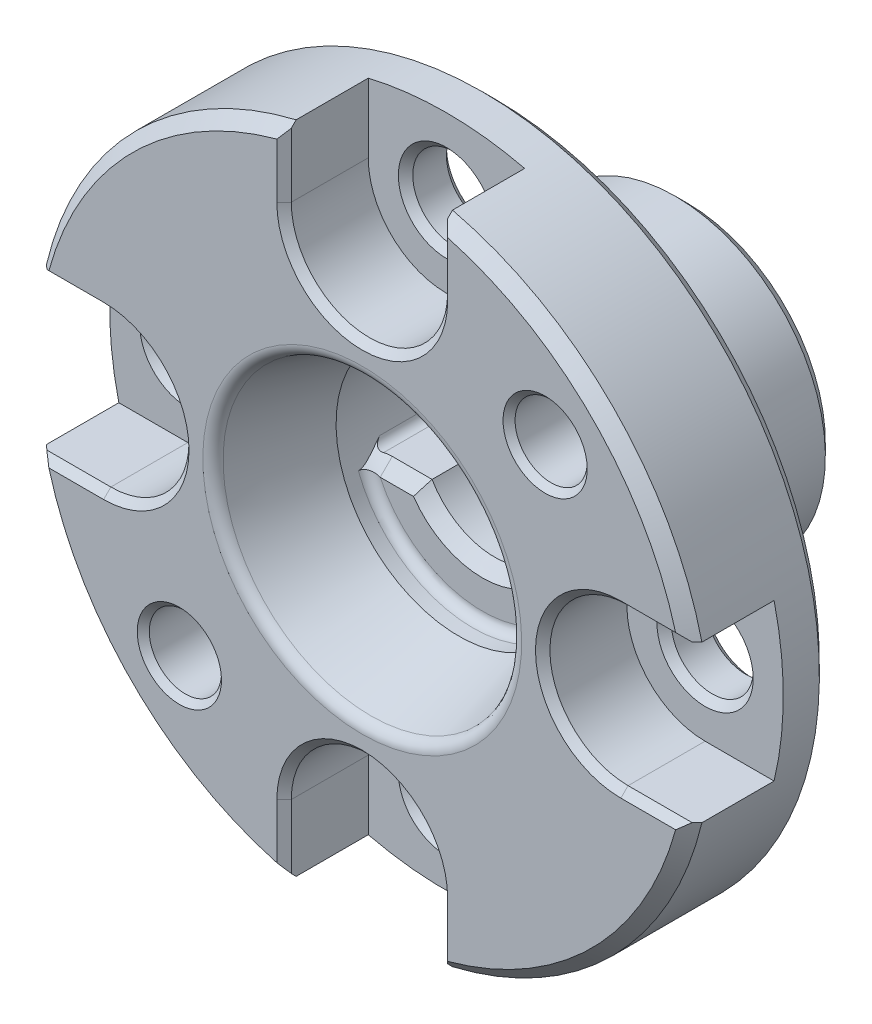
ISO-10303-21;
HEADER;
FILE_DESCRIPTION(('STEP AP214'),'2;1');
FILE_NAME('part.step','',(''),(''),'','','');
FILE_SCHEMA(('AUTOMOTIVE_DESIGN { 1 0 10303 214 1 1 1 1 }'));
ENDSEC;
DATA;
#1=APPLICATION_CONTEXT('core data for automotive mechanical design processes');
#2=APPLICATION_PROTOCOL_DEFINITION('international standard','automotive_design',2000,#1);
#3=PRODUCT_CONTEXT('',#1,'mechanical');
#4=PRODUCT('Part','Part','',(#3));
#5=PRODUCT_RELATED_PRODUCT_CATEGORY('part','',(#4));
#6=PRODUCT_DEFINITION_FORMATION('','',#4);
#7=PRODUCT_DEFINITION_CONTEXT('part definition',#1,'design');
#8=PRODUCT_DEFINITION('design','',#6,#7);
#9=PRODUCT_DEFINITION_SHAPE('','',#8);
#10=(LENGTH_UNIT() NAMED_UNIT(*) SI_UNIT(.MILLI.,.METRE.));
#11=(NAMED_UNIT(*) PLANE_ANGLE_UNIT() SI_UNIT($,.RADIAN.));
#12=(NAMED_UNIT(*) SI_UNIT($,.STERADIAN.) SOLID_ANGLE_UNIT());
#13=UNCERTAINTY_MEASURE_WITH_UNIT(LENGTH_MEASURE(1.E-05),#10,'distance_accuracy_value','');
#14=(GEOMETRIC_REPRESENTATION_CONTEXT(3) GLOBAL_UNCERTAINTY_ASSIGNED_CONTEXT((#13)) GLOBAL_UNIT_ASSIGNED_CONTEXT((#10,
#11,#12)) REPRESENTATION_CONTEXT('',''));
#15=CARTESIAN_POINT('',(0.,0.,0.));
#16=DIRECTION('',(0.,0.,1.));
#17=DIRECTION('',(1.,0.,0.));
#18=AXIS2_PLACEMENT_3D('',#15,#16,#17);
#19=CARTESIAN_POINT('',(14.,0.,0.));
#20=DIRECTION('',(0.,0.,-1.));
#21=DIRECTION('',(0.,1.,0.));
#22=AXIS2_PLACEMENT_3D('',#19,#20,#21);
#23=PLANE('',#22);
#24=CARTESIAN_POINT('',(0.,0.,0.));
#25=DIRECTION('',(0.,0.,-1.));
#26=DIRECTION('',(0.,1.,0.));
#27=AXIS2_PLACEMENT_3D('',#24,#25,#26);
#28=CIRCLE('',#27,13.5);
#29=CARTESIAN_POINT('',(0.,13.5,0.));
#30=VERTEX_POINT('',#29);
#31=EDGE_CURVE('E1844',#30,#30,#28,.T.);
#32=ORIENTED_EDGE('',*,*,#31,.T.);
#33=EDGE_LOOP('',(#32));
#34=FACE_BOUND('',#33,.T.);
#35=CARTESIAN_POINT('',(0.,0.,0.));
#36=DIRECTION('',(0.,0.,-1.));
#37=DIRECTION('',(0.,1.,0.));
#38=AXIS2_PLACEMENT_3D('',#35,#36,#37);
#39=CIRCLE('',#38,6.85);
#40=CARTESIAN_POINT('',(0.,6.85,0.));
#41=VERTEX_POINT('',#40);
#42=EDGE_CURVE('E1845',#41,#41,#39,.F.);
#43=ORIENTED_EDGE('',*,*,#42,.T.);
#44=EDGE_LOOP('',(#43));
#45=FACE_BOUND('',#44,.T.);
#46=CARTESIAN_POINT('',(-10.75,1.12600273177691E-13,0.));
#47=DIRECTION('',(0.,0.,-1.));
#48=DIRECTION('',(0.,1.,0.));
#49=AXIS2_PLACEMENT_3D('',#46,#47,#48);
#50=CIRCLE('',#49,2.);
#51=CARTESIAN_POINT('',(-10.75,2.00000000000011,0.));
#52=VERTEX_POINT('',#51);
#53=EDGE_CURVE('E2008',#52,#52,#50,.F.);
#54=ORIENTED_EDGE('',*,*,#53,.T.);
#55=EDGE_LOOP('',(#54));
#56=FACE_BOUND('',#55,.T.);
#57=CARTESIAN_POINT('',(0.,-10.75,0.));
#58=DIRECTION('',(0.,0.,-1.));
#59=DIRECTION('',(0.,1.,0.));
#60=AXIS2_PLACEMENT_3D('',#57,#58,#59);
#61=CIRCLE('',#60,2.);
#62=CARTESIAN_POINT('',(0.,-8.75,0.));
#63=VERTEX_POINT('',#62);
#64=EDGE_CURVE('E2005',#63,#63,#61,.F.);
#65=ORIENTED_EDGE('',*,*,#64,.T.);
#66=EDGE_LOOP('',(#65));
#67=FACE_BOUND('',#66,.T.);
#68=CARTESIAN_POINT('',(10.75,0.,0.));
#69=DIRECTION('',(0.,0.,-1.));
#70=DIRECTION('',(0.,1.,0.));
#71=AXIS2_PLACEMENT_3D('',#68,#69,#70);
#72=CIRCLE('',#71,2.);
#73=CARTESIAN_POINT('',(10.75,1.99999999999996,0.));
#74=VERTEX_POINT('',#73);
#75=EDGE_CURVE('E2002',#74,#74,#72,.F.);
#76=ORIENTED_EDGE('',*,*,#75,.T.);
#77=EDGE_LOOP('',(#76));
#78=FACE_BOUND('',#77,.T.);
#79=CARTESIAN_POINT('',(0.,10.75,0.));
#80=DIRECTION('',(0.,0.,-1.));
#81=DIRECTION('',(0.,1.,0.));
#82=AXIS2_PLACEMENT_3D('',#79,#80,#81);
#83=CIRCLE('',#82,2.);
#84=CARTESIAN_POINT('',(0.,12.75,0.));
#85=VERTEX_POINT('',#84);
#86=EDGE_CURVE('E1999',#85,#85,#83,.F.);
#87=ORIENTED_EDGE('',*,*,#86,.T.);
#88=EDGE_LOOP('',(#87));
#89=FACE_BOUND('',#88,.T.);
#90=CARTESIAN_POINT('',(-7.60139789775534,-7.60139789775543,0.));
#91=DIRECTION('',(0.,0.,1.));
#92=DIRECTION('',(0.,-1.,0.));
#93=AXIS2_PLACEMENT_3D('',#90,#91,#92);
#94=CIRCLE('',#93,1.75);
#95=CARTESIAN_POINT('',(-7.60139789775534,-9.35139789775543,0.));
#96=VERTEX_POINT('',#95);
#97=EDGE_CURVE('E419',#96,#96,#94,.T.);
#98=ORIENTED_EDGE('',*,*,#97,.T.);
#99=EDGE_LOOP('',(#98));
#100=FACE_BOUND('',#99,.T.);
#101=CARTESIAN_POINT('',(7.6013978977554,7.60139789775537,0.));
#102=DIRECTION('',(0.,0.,1.));
#103=DIRECTION('',(0.,-1.,0.));
#104=AXIS2_PLACEMENT_3D('',#101,#102,#103);
#105=CIRCLE('',#104,1.75);
#106=CARTESIAN_POINT('',(7.6013978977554,5.85139789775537,0.));
#107=VERTEX_POINT('',#106);
#108=EDGE_CURVE('E412',#107,#107,#105,.T.);
#109=ORIENTED_EDGE('',*,*,#108,.T.);
#110=EDGE_LOOP('',(#109));
#111=FACE_BOUND('',#110,.T.);
#112=ADVANCED_FACE('F14',(#34,#45,#56,#67,#78,#89,#100,#111),#23,.T.);
#113=CARTESIAN_POINT('',(0.,0.,0.));
#114=DIRECTION('',(0.,0.,-1.));
#115=DIRECTION('',(0.,1.,0.));
#116=AXIS2_PLACEMENT_3D('',#113,#114,#115);
#117=CYLINDRICAL_SURFACE('',#116,3.);
#118=CARTESIAN_POINT('',(0.,0.,-2.14545883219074));
#119=DIRECTION('',(0.,0.,1.));
#120=DIRECTION('',(0.,-1.,0.));
#121=AXIS2_PLACEMENT_3D('',#118,#119,#120);
#122=CIRCLE('',#121,3.);
#123=CARTESIAN_POINT('',(-2.44235282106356,-1.74210008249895,-2.14545883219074));
#124=VERTEX_POINT('',#123);
#125=CARTESIAN_POINT('',(2.59807621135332,-1.5,-2.14545883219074));
#126=VERTEX_POINT('',#125);
#127=EDGE_CURVE('E546',#124,#126,#122,.T.);
#128=ORIENTED_EDGE('',*,*,#127,.F.);
#129=DIRECTION('',(0.,0.,-1.));
#130=VECTOR('',#129,1.);
#131=CARTESIAN_POINT('',(-2.44235282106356,-1.74210008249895,0.));
#132=LINE('',#131,#130);
#133=CARTESIAN_POINT('',(-2.44235282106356,-1.74210008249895,-3.85));
#134=VERTEX_POINT('',#133);
#135=EDGE_CURVE('E563',#124,#134,#132,.T.);
#136=ORIENTED_EDGE('',*,*,#135,.T.);
#137=CARTESIAN_POINT('',(0.,0.,-3.85));
#138=DIRECTION('',(0.,0.,-1.));
#139=DIRECTION('',(0.,1.,0.));
#140=AXIS2_PLACEMENT_3D('',#137,#138,#139);
#141=CIRCLE('',#140,3.);
#142=CARTESIAN_POINT('',(-2.59807621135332,-1.5,-3.85));
#143=VERTEX_POINT('',#142);
#144=EDGE_CURVE('E433',#134,#143,#141,.T.);
#145=ORIENTED_EDGE('',*,*,#144,.T.);
#146=DIRECTION('',(0.,0.,-1.));
#147=VECTOR('',#146,1.);
#148=CARTESIAN_POINT('',(-2.59807621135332,-1.5,0.));
#149=LINE('',#148,#147);
#150=CARTESIAN_POINT('',(-2.59807621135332,-1.5,0.));
#151=VERTEX_POINT('',#150);
#152=EDGE_CURVE('E384',#151,#143,#149,.T.);
#153=ORIENTED_EDGE('',*,*,#152,.F.);
#154=CARTESIAN_POINT('',(0.,0.,0.));
#155=DIRECTION('',(0.,0.,1.));
#156=DIRECTION('',(0.,-1.,0.));
#157=AXIS2_PLACEMENT_3D('',#154,#155,#156);
#158=CIRCLE('',#157,3.);
#159=CARTESIAN_POINT('',(2.59807621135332,-1.5,0.));
#160=VERTEX_POINT('',#159);
#161=EDGE_CURVE('E1918',#151,#160,#158,.T.);
#162=ORIENTED_EDGE('',*,*,#161,.T.);
#163=DIRECTION('',(0.,0.,-1.));
#164=VECTOR('',#163,1.);
#165=CARTESIAN_POINT('',(2.59807621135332,-1.5,0.));
#166=LINE('',#165,#164);
#167=EDGE_CURVE('E526',#126,#160,#166,.F.);
#168=ORIENTED_EDGE('',*,*,#167,.F.);
#169=EDGE_LOOP('',(#128,#136,#145,#153,#162,#168));
#170=FACE_BOUND('',#169,.T.);
#171=ADVANCED_FACE('F788',(#170),#117,.F.);
#172=CARTESIAN_POINT('',(0.,0.,-2.14545883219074));
#173=DIRECTION('',(0.,0.,1.));
#174=DIRECTION('',(0.,-1.,0.));
#175=AXIS2_PLACEMENT_3D('',#172,#173,#174);
#176=CIRCLE('',#175,3.);
#177=CARTESIAN_POINT('',(2.44235282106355,1.74210008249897,-2.14545883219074));
#178=VERTEX_POINT('',#177);
#179=CARTESIAN_POINT('',(-2.59807621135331,1.5,-2.14545883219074));
#180=VERTEX_POINT('',#179);
#181=EDGE_CURVE('E361',#178,#180,#176,.T.);
#182=ORIENTED_EDGE('',*,*,#181,.F.);
#183=DIRECTION('',(0.,0.,-1.));
#184=VECTOR('',#183,1.);
#185=CARTESIAN_POINT('',(2.44235282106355,1.74210008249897,0.));
#186=LINE('',#185,#184);
#187=CARTESIAN_POINT('',(2.44235282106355,1.74210008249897,-3.85));
#188=VERTEX_POINT('',#187);
#189=EDGE_CURVE('E561',#178,#188,#186,.T.);
#190=ORIENTED_EDGE('',*,*,#189,.T.);
#191=CARTESIAN_POINT('',(0.,0.,-3.85));
#192=DIRECTION('',(0.,0.,-1.));
#193=DIRECTION('',(0.,1.,0.));
#194=AXIS2_PLACEMENT_3D('',#191,#192,#193);
#195=CIRCLE('',#194,3.);
#196=CARTESIAN_POINT('',(2.59807621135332,1.5,-3.85));
#197=VERTEX_POINT('',#196);
#198=EDGE_CURVE('E422',#188,#197,#195,.T.);
#199=ORIENTED_EDGE('',*,*,#198,.T.);
#200=DIRECTION('',(0.,0.,-1.));
#201=VECTOR('',#200,1.);
#202=CARTESIAN_POINT('',(2.59807621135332,1.5,0.));
#203=LINE('',#202,#201);
#204=CARTESIAN_POINT('',(2.59807621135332,1.5,0.));
#205=VERTEX_POINT('',#204);
#206=EDGE_CURVE('E385',#205,#197,#203,.T.);
#207=ORIENTED_EDGE('',*,*,#206,.F.);
#208=CARTESIAN_POINT('',(0.,0.,0.));
#209=DIRECTION('',(0.,0.,1.));
#210=DIRECTION('',(0.,-1.,0.));
#211=AXIS2_PLACEMENT_3D('',#208,#209,#210);
#212=CIRCLE('',#211,3.);
#213=CARTESIAN_POINT('',(-2.59807621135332,1.5,0.));
#214=VERTEX_POINT('',#213);
#215=EDGE_CURVE('E381',#205,#214,#212,.T.);
#216=ORIENTED_EDGE('',*,*,#215,.T.);
#217=DIRECTION('',(0.,0.,-1.));
#218=VECTOR('',#217,1.);
#219=CARTESIAN_POINT('',(-2.59807621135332,1.5,0.));
#220=LINE('',#219,#218);
#221=EDGE_CURVE('E377',#180,#214,#220,.F.);
#222=ORIENTED_EDGE('',*,*,#221,.F.);
#223=EDGE_LOOP('',(#182,#190,#199,#207,#216,#222));
#224=FACE_BOUND('',#223,.T.);
#225=ADVANCED_FACE('F378',(#224),#117,.F.);
#226=CARTESIAN_POINT('',(5.06886604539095,6.31419804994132,-4.14549246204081));
#227=DIRECTION('',(-0.86710645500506,0.498122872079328,0.));
#228=DIRECTION('',(-0.498122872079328,-0.86710645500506,0.));
#229=AXIS2_PLACEMENT_3D('',#226,#227,#228);
#230=PLANE('',#229);
#231=DIRECTION('',(0.,0.,-1.));
#232=VECTOR('',#231,1.);
#233=CARTESIAN_POINT('',(3.54682238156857,3.66470339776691,0.));
#234=LINE('',#233,#232);
#235=CARTESIAN_POINT('',(3.54682238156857,3.66470339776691,-3.85));
#236=VERTEX_POINT('',#235);
#237=CARTESIAN_POINT('',(3.54682238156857,3.66470339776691,-2.14545883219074));
#238=VERTEX_POINT('',#237);
#239=EDGE_CURVE('E374',#236,#238,#234,.F.);
#240=ORIENTED_EDGE('',*,*,#239,.F.);
#241=DIRECTION('',(-0.498122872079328,-0.86710645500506,0.));
#242=VECTOR('',#241,1.);
#243=CARTESIAN_POINT('',(5.06886604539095,6.31419804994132,-3.85));
#244=LINE('',#243,#242);
#245=EDGE_CURVE('E428',#236,#188,#244,.T.);
#246=ORIENTED_EDGE('',*,*,#245,.T.);
#247=ORIENTED_EDGE('',*,*,#189,.F.);
#248=DIRECTION('',(0.498122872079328,0.86710645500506,0.));
#249=VECTOR('',#248,1.);
#250=CARTESIAN_POINT('',(5.06886604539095,6.31419804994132,-2.14545883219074));
#251=LINE('',#250,#249);
#252=EDGE_CURVE('E369',#178,#238,#251,.T.);
#253=ORIENTED_EDGE('',*,*,#252,.T.);
#254=EDGE_LOOP('',(#240,#246,#247,#253));
#255=FACE_BOUND('',#254,.T.);
#256=ADVANCED_FACE('F1292',(#255),#230,.T.);
#257=CARTESIAN_POINT('',(-5.06886604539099,-6.31419804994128,-4.14549246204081));
#258=DIRECTION('',(0.867106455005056,-0.498122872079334,0.));
#259=DIRECTION('',(0.498122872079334,0.867106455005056,0.));
#260=AXIS2_PLACEMENT_3D('',#257,#258,#259);
#261=PLANE('',#260);
#262=DIRECTION('',(0.,0.,-1.));
#263=VECTOR('',#262,1.);
#264=CARTESIAN_POINT('',(-3.54682238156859,-3.66470339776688,0.));
#265=LINE('',#264,#263);
#266=CARTESIAN_POINT('',(-3.54682238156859,-3.66470339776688,-3.85));
#267=VERTEX_POINT('',#266);
#268=CARTESIAN_POINT('',(-3.5468223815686,-3.66470339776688,-2.14545883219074));
#269=VERTEX_POINT('',#268);
#270=EDGE_CURVE('E543',#267,#269,#265,.F.);
#271=ORIENTED_EDGE('',*,*,#270,.F.);
#272=DIRECTION('',(0.498122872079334,0.867106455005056,0.));
#273=VECTOR('',#272,1.);
#274=CARTESIAN_POINT('',(-5.06886604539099,-6.31419804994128,-3.85));
#275=LINE('',#274,#273);
#276=EDGE_CURVE('E439',#267,#134,#275,.T.);
#277=ORIENTED_EDGE('',*,*,#276,.T.);
#278=ORIENTED_EDGE('',*,*,#135,.F.);
#279=DIRECTION('',(-0.498122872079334,-0.867106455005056,0.));
#280=VECTOR('',#279,1.);
#281=CARTESIAN_POINT('',(-5.06886604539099,-6.31419804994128,-2.14545883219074));
#282=LINE('',#281,#280);
#283=EDGE_CURVE('E540',#124,#269,#282,.T.);
#284=ORIENTED_EDGE('',*,*,#283,.T.);
#285=EDGE_LOOP('',(#271,#277,#278,#284));
#286=FACE_BOUND('',#285,.T.);
#287=ADVANCED_FACE('F1282',(#286),#261,.T.);
#288=CARTESIAN_POINT('',(-2.,-1.5,-8.5));
#289=DIRECTION('',(0.,-1.,0.));
#290=DIRECTION('',(1.,0.,0.));
#291=AXIS2_PLACEMENT_3D('',#288,#289,#290);
#292=PLANE('',#291);
#293=DIRECTION('',(1.,0.,0.));
#294=VECTOR('',#293,1.);
#295=CARTESIAN_POINT('',(-2.,-1.5,-3.85));
#296=LINE('',#295,#294);
#297=CARTESIAN_POINT('',(-4.56946386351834,-1.5,-3.85));
#298=VERTEX_POINT('',#297);
#299=EDGE_CURVE('E431',#298,#143,#296,.T.);
#300=ORIENTED_EDGE('',*,*,#299,.F.);
#301=DIRECTION('',(0.,0.,-1.));
#302=VECTOR('',#301,1.);
#303=CARTESIAN_POINT('',(-4.56946386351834,-1.5,-8.5));
#304=LINE('',#303,#302);
#305=CARTESIAN_POINT('',(-4.56915932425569,-1.5,0.0444692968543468));
#306=VERTEX_POINT('',#305);
#307=EDGE_CURVE('E1451',#298,#306,#304,.F.);
#308=ORIENTED_EDGE('',*,*,#307,.T.);
#309=CARTESIAN_POINT('',(-4.17899475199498,-1.5,0.00250293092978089));
#310=CARTESIAN_POINT('',(-4.69653414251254,-1.5,-0.0521788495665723));
#311=CARTESIAN_POINT('',(-5.24021613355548,-1.5,0.358588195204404));
#312=CARTESIAN_POINT('',(-5.23067873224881,-1.5,0.9));
#313=B_SPLINE_CURVE_WITH_KNOTS('',3,(#309,#310,#311,#312),.UNSPECIFIED.,.F.,.F.,(4,4),
(0.00303440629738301,0.00457668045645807),.UNSPECIFIED.);
#314=CARTESIAN_POINT('',(-4.25345688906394,-1.5,-0.00109366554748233));
#315=VERTEX_POINT('',#314);
#316=EDGE_CURVE('E1443',#306,#315,#313,.F.);
#317=ORIENTED_EDGE('',*,*,#316,.T.);
#318=DIRECTION('',(1.,0.,0.));
#319=VECTOR('',#318,1.);
#320=CARTESIAN_POINT('',(-2.59807621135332,-1.5,0.));
#321=LINE('',#320,#319);
#322=EDGE_CURVE('E1608',#315,#151,#321,.T.);
#323=ORIENTED_EDGE('',*,*,#322,.T.);
#324=ORIENTED_EDGE('',*,*,#152,.T.);
#325=EDGE_LOOP('',(#300,#308,#317,#323,#324));
#326=FACE_BOUND('',#325,.T.);
#327=ADVANCED_FACE('F1272',(#326),#292,.F.);
#328=CARTESIAN_POINT('',(2.,1.5,-8.5));
#329=DIRECTION('',(0.,1.,0.));
#330=DIRECTION('',(-1.,0.,0.));
#331=AXIS2_PLACEMENT_3D('',#328,#329,#330);
#332=PLANE('',#331);
#333=DIRECTION('',(-1.,0.,0.));
#334=VECTOR('',#333,1.);
#335=CARTESIAN_POINT('',(2.,1.5,-3.85));
#336=LINE('',#335,#334);
#337=CARTESIAN_POINT('',(4.56946386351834,1.5,-3.85));
#338=VERTEX_POINT('',#337);
#339=EDGE_CURVE('E1954',#338,#197,#336,.T.);
#340=ORIENTED_EDGE('',*,*,#339,.F.);
#341=DIRECTION('',(0.,0.,-1.));
#342=VECTOR('',#341,1.);
#343=CARTESIAN_POINT('',(4.56946386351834,1.5,-8.5));
#344=LINE('',#343,#342);
#345=CARTESIAN_POINT('',(4.56915932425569,1.5,0.0444692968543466));
#346=VERTEX_POINT('',#345);
#347=EDGE_CURVE('E1395',#338,#346,#344,.F.);
#348=ORIENTED_EDGE('',*,*,#347,.T.);
#349=CARTESIAN_POINT('',(4.17899475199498,1.5,0.00250293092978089));
#350=CARTESIAN_POINT('',(4.69653414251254,1.5,-0.0521788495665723));
#351=CARTESIAN_POINT('',(5.24021613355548,1.5,0.358588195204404));
#352=CARTESIAN_POINT('',(5.23067873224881,1.5,0.9));
#353=B_SPLINE_CURVE_WITH_KNOTS('',3,(#349,#350,#351,#352),.UNSPECIFIED.,.F.,.F.,(4,4),
(0.00303440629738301,0.00457668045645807),.UNSPECIFIED.);
#354=CARTESIAN_POINT('',(4.25345688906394,1.5,-0.00218733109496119));
#355=VERTEX_POINT('',#354);
#356=EDGE_CURVE('E1402',#346,#355,#353,.F.);
#357=ORIENTED_EDGE('',*,*,#356,.T.);
#358=DIRECTION('',(-1.,0.,0.));
#359=VECTOR('',#358,1.);
#360=CARTESIAN_POINT('',(2.59807621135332,1.5,0.));
#361=LINE('',#360,#359);
#362=EDGE_CURVE('E1917',#355,#205,#361,.T.);
#363=ORIENTED_EDGE('',*,*,#362,.T.);
#364=ORIENTED_EDGE('',*,*,#206,.T.);
#365=EDGE_LOOP('',(#340,#348,#357,#363,#364));
#366=FACE_BOUND('',#365,.T.);
#367=ADVANCED_FACE('F1263',(#366),#332,.F.);
#368=CARTESIAN_POINT('',(5.1,0.,0.5));
#369=DIRECTION('',(0.,0.,1.));
#370=DIRECTION('',(0.,-1.,0.));
#371=AXIS2_PLACEMENT_3D('',#368,#369,#370);
#372=PLANE('',#371);
#373=CARTESIAN_POINT('',(0.,0.,0.5));
#374=DIRECTION('',(0.,0.,1.));
#375=DIRECTION('',(0.,-1.,0.));
#376=AXIS2_PLACEMENT_3D('',#373,#374,#375);
#377=CIRCLE('',#376,3.5);
#378=CARTESIAN_POINT('',(-2.87228132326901,2.,0.5));
#379=VERTEX_POINT('',#378);
#380=CARTESIAN_POINT('',(2.87228132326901,2.,0.5));
#381=VERTEX_POINT('',#380);
#382=EDGE_CURVE('E1701',#379,#381,#377,.F.);
#383=ORIENTED_EDGE('',*,*,#382,.T.);
#384=DIRECTION('',(1.,0.,0.));
#385=VECTOR('',#384,1.);
#386=CARTESIAN_POINT('',(4.45421149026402,2.,0.5));
#387=LINE('',#386,#385);
#388=CARTESIAN_POINT('',(4.25322090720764,1.99993698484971,0.499515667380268));
#389=VERTEX_POINT('',#388);
#390=EDGE_CURVE('E1705',#381,#389,#387,.T.);
#391=ORIENTED_EDGE('',*,*,#390,.T.);
#392=CARTESIAN_POINT('',(0.,0.,0.5));
#393=DIRECTION('',(0.,0.,1.));
#394=DIRECTION('',(0.,-1.,0.));
#395=AXIS2_PLACEMENT_3D('',#392,#393,#394);
#396=CIRCLE('',#395,4.7);
#397=CARTESIAN_POINT('',(-4.25323406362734,2.,0.5));
#398=VERTEX_POINT('',#397);
#399=EDGE_CURVE('E1412',#389,#398,#396,.T.);
#400=ORIENTED_EDGE('',*,*,#399,.T.);
#401=DIRECTION('',(1.,0.,0.));
#402=VECTOR('',#401,1.);
#403=CARTESIAN_POINT('',(-2.59807621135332,2.,0.5));
#404=LINE('',#403,#402);
#405=EDGE_CURVE('E1703',#398,#379,#404,.T.);
#406=ORIENTED_EDGE('',*,*,#405,.T.);
#407=EDGE_LOOP('',(#383,#391,#400,#406));
#408=FACE_BOUND('',#407,.T.);
#409=ADVANCED_FACE('F808',(#408),#372,.T.);
#410=CARTESIAN_POINT('',(6.25,0.,5.5));
#411=DIRECTION('',(0.,0.,1.));
#412=DIRECTION('',(0.,-1.,0.));
#413=AXIS2_PLACEMENT_3D('',#410,#411,#412);
#414=PLANE('',#413);
#415=CARTESIAN_POINT('',(7.6013978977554,7.60139789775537,5.5));
#416=DIRECTION('',(0.,0.,1.));
#417=DIRECTION('',(0.,-1.,0.));
#418=AXIS2_PLACEMENT_3D('',#415,#416,#417);
#419=CIRCLE('',#418,1.75);
#420=CARTESIAN_POINT('',(7.6013978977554,5.85139789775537,5.5));
#421=VERTEX_POINT('',#420);
#422=EDGE_CURVE('E409',#421,#421,#419,.T.);
#423=ORIENTED_EDGE('',*,*,#422,.F.);
#424=EDGE_LOOP('',(#423));
#425=FACE_BOUND('',#424,.T.);
#426=CARTESIAN_POINT('',(-7.60139789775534,-7.60139789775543,5.5));
#427=DIRECTION('',(0.,0.,1.));
#428=DIRECTION('',(0.,-1.,0.));
#429=AXIS2_PLACEMENT_3D('',#426,#427,#428);
#430=CIRCLE('',#429,1.75);
#431=CARTESIAN_POINT('',(-7.60139789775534,-9.35139789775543,5.5));
#432=VERTEX_POINT('',#431);
#433=EDGE_CURVE('E416',#432,#432,#430,.T.);
#434=ORIENTED_EDGE('',*,*,#433,.F.);
#435=EDGE_LOOP('',(#434));
#436=FACE_BOUND('',#435,.T.);
#437=CARTESIAN_POINT('',(0.,0.,5.5));
#438=DIRECTION('',(0.,0.,1.));
#439=DIRECTION('',(0.,-1.,0.));
#440=AXIS2_PLACEMENT_3D('',#437,#438,#439);
#441=CIRCLE('',#440,6.6267770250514);
#442=CARTESIAN_POINT('',(0.,-6.6267770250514,5.5));
#443=VERTEX_POINT('',#442);
#444=EDGE_CURVE('E697',#443,#443,#441,.F.);
#445=ORIENTED_EDGE('',*,*,#444,.T.);
#446=EDGE_LOOP('',(#445));
#447=FACE_BOUND('',#446,.T.);
#448=DIRECTION('',(0.,-1.,0.));
#449=VECTOR('',#448,1.);
#450=CARTESIAN_POINT('',(3.5499999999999,-13.6175438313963,5.5));
#451=LINE('',#450,#449);
#452=CARTESIAN_POINT('',(3.54999999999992,-10.75,5.5));
#453=VERTEX_POINT('',#452);
#454=CARTESIAN_POINT('',(3.54999999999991,-13.0248800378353,5.5));
#455=VERTEX_POINT('',#454);
#456=EDGE_CURVE('E607',#453,#455,#451,.T.);
#457=ORIENTED_EDGE('',*,*,#456,.T.);
#458=CARTESIAN_POINT('',(0.,0.,5.5));
#459=DIRECTION('',(0.,0.,1.));
#460=DIRECTION('',(0.,-1.,0.));
#461=AXIS2_PLACEMENT_3D('',#458,#459,#460);
#462=CIRCLE('',#461,13.5);
#463=CARTESIAN_POINT('',(13.0248800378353,-3.55000000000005,5.5));
#464=VERTEX_POINT('',#463);
#465=EDGE_CURVE('E986',#455,#464,#462,.T.);
#466=ORIENTED_EDGE('',*,*,#465,.T.);
#467=DIRECTION('',(-1.,0.,0.));
#468=VECTOR('',#467,1.);
#469=CARTESIAN_POINT('',(10.75,-3.55,5.5));
#470=LINE('',#469,#468);
#471=CARTESIAN_POINT('',(10.75,-3.55,5.5));
#472=VERTEX_POINT('',#471);
#473=EDGE_CURVE('E592',#464,#472,#470,.T.);
#474=ORIENTED_EDGE('',*,*,#473,.T.);
#475=CARTESIAN_POINT('',(10.75,0.,5.5));
#476=DIRECTION('',(0.,0.,1.));
#477=DIRECTION('',(0.,-1.,0.));
#478=AXIS2_PLACEMENT_3D('',#475,#476,#477);
#479=CIRCLE('',#478,3.55);
#480=CARTESIAN_POINT('',(10.75,3.55,5.5));
#481=VERTEX_POINT('',#480);
#482=EDGE_CURVE('E590',#472,#481,#479,.F.);
#483=ORIENTED_EDGE('',*,*,#482,.T.);
#484=DIRECTION('',(1.,0.,0.));
#485=VECTOR('',#484,1.);
#486=CARTESIAN_POINT('',(13.6175438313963,3.54999999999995,5.5));
#487=LINE('',#486,#485);
#488=CARTESIAN_POINT('',(13.0248800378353,3.54999999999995,5.5));
#489=VERTEX_POINT('',#488);
#490=EDGE_CURVE('E587',#481,#489,#487,.T.);
#491=ORIENTED_EDGE('',*,*,#490,.T.);
#492=CARTESIAN_POINT('',(0.,0.,5.5));
#493=DIRECTION('',(0.,0.,1.));
#494=DIRECTION('',(0.,-1.,0.));
#495=AXIS2_PLACEMENT_3D('',#492,#493,#494);
#496=CIRCLE('',#495,13.5);
#497=CARTESIAN_POINT('',(3.55,13.0248800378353,5.5));
#498=VERTEX_POINT('',#497);
#499=EDGE_CURVE('E985',#489,#498,#496,.T.);
#500=ORIENTED_EDGE('',*,*,#499,.T.);
#501=DIRECTION('',(0.,-1.,0.));
#502=VECTOR('',#501,1.);
#503=CARTESIAN_POINT('',(3.55,10.75,5.5));
#504=LINE('',#503,#502);
#505=CARTESIAN_POINT('',(3.55,10.75,5.5));
#506=VERTEX_POINT('',#505);
#507=EDGE_CURVE('E574',#498,#506,#504,.T.);
#508=ORIENTED_EDGE('',*,*,#507,.T.);
#509=CARTESIAN_POINT('',(0.,10.75,5.5));
#510=DIRECTION('',(0.,0.,1.));
#511=DIRECTION('',(0.,-1.,0.));
#512=AXIS2_PLACEMENT_3D('',#509,#510,#511);
#513=CIRCLE('',#512,3.55);
#514=CARTESIAN_POINT('',(-3.55,10.75,5.5));
#515=VERTEX_POINT('',#514);
#516=EDGE_CURVE('E572',#506,#515,#513,.F.);
#517=ORIENTED_EDGE('',*,*,#516,.T.);
#518=DIRECTION('',(0.,1.,0.));
#519=VECTOR('',#518,1.);
#520=CARTESIAN_POINT('',(-3.55,13.6175438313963,5.5));
#521=LINE('',#520,#519);
#522=CARTESIAN_POINT('',(-3.55,13.0248800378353,5.5));
#523=VERTEX_POINT('',#522);
#524=EDGE_CURVE('E569',#515,#523,#521,.T.);
#525=ORIENTED_EDGE('',*,*,#524,.T.);
#526=CARTESIAN_POINT('',(0.,0.,5.5));
#527=DIRECTION('',(0.,0.,1.));
#528=DIRECTION('',(0.,-1.,0.));
#529=AXIS2_PLACEMENT_3D('',#526,#527,#528);
#530=CIRCLE('',#529,13.5);
#531=CARTESIAN_POINT('',(-13.0248800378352,3.55000000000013,5.5));
#532=VERTEX_POINT('',#531);
#533=EDGE_CURVE('E974',#523,#532,#530,.T.);
#534=ORIENTED_EDGE('',*,*,#533,.T.);
#535=DIRECTION('',(1.,0.,0.));
#536=VECTOR('',#535,1.);
#537=CARTESIAN_POINT('',(-10.75,3.55000000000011,5.5));
#538=LINE('',#537,#536);
#539=CARTESIAN_POINT('',(-10.75,3.55000000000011,5.5));
#540=VERTEX_POINT('',#539);
#541=EDGE_CURVE('E632',#532,#540,#538,.T.);
#542=ORIENTED_EDGE('',*,*,#541,.T.);
#543=CARTESIAN_POINT('',(-10.75,1.12600273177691E-13,5.5));
#544=DIRECTION('',(0.,0.,1.));
#545=DIRECTION('',(0.,-1.,0.));
#546=AXIS2_PLACEMENT_3D('',#543,#544,#545);
#547=CIRCLE('',#546,3.55);
#548=CARTESIAN_POINT('',(-10.75,-3.54999999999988,5.5));
#549=VERTEX_POINT('',#548);
#550=EDGE_CURVE('E630',#540,#549,#547,.F.);
#551=ORIENTED_EDGE('',*,*,#550,.T.);
#552=DIRECTION('',(-1.,0.,0.));
#553=VECTOR('',#552,1.);
#554=CARTESIAN_POINT('',(-13.6175438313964,-3.54999999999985,5.5));
#555=LINE('',#554,#553);
#556=CARTESIAN_POINT('',(-13.0248800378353,-3.54999999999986,5.5));
#557=VERTEX_POINT('',#556);
#558=EDGE_CURVE('E627',#549,#557,#555,.T.);
#559=ORIENTED_EDGE('',*,*,#558,.T.);
#560=CARTESIAN_POINT('',(0.,0.,5.5));
#561=DIRECTION('',(0.,0.,1.));
#562=DIRECTION('',(0.,-1.,0.));
#563=AXIS2_PLACEMENT_3D('',#560,#561,#562);
#564=CIRCLE('',#563,13.5);
#565=CARTESIAN_POINT('',(-3.55000000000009,-13.0248800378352,5.5));
#566=VERTEX_POINT('',#565);
#567=EDGE_CURVE('E990',#557,#566,#564,.T.);
#568=ORIENTED_EDGE('',*,*,#567,.T.);
#569=DIRECTION('',(0.,1.,0.));
#570=VECTOR('',#569,1.);
#571=CARTESIAN_POINT('',(-3.55000000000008,-10.75,5.5));
#572=LINE('',#571,#570);
#573=CARTESIAN_POINT('',(-3.55000000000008,-10.75,5.5));
#574=VERTEX_POINT('',#573);
#575=EDGE_CURVE('E612',#566,#574,#572,.T.);
#576=ORIENTED_EDGE('',*,*,#575,.T.);
#577=CARTESIAN_POINT('',(0.,-10.75,5.5));
#578=DIRECTION('',(0.,0.,1.));
#579=DIRECTION('',(0.,-1.,0.));
#580=AXIS2_PLACEMENT_3D('',#577,#578,#579);
#581=CIRCLE('',#580,3.55);
#582=EDGE_CURVE('E610',#574,#453,#581,.F.);
#583=ORIENTED_EDGE('',*,*,#582,.T.);
#584=EDGE_LOOP('',(#457,#466,#474,#483,#491,#500,#508,#517,#525,#534,#542,#551,#559,#568,#576,#583));
#585=FACE_BOUND('',#584,.T.);
#586=ADVANCED_FACE('F804',(#425,#436,#447,#585),#414,.T.);
#587=CARTESIAN_POINT('',(0.,0.,0.));
#588=DIRECTION('',(0.,0.,-1.));
#589=DIRECTION('',(0.,1.,0.));
#590=AXIS2_PLACEMENT_3D('',#587,#588,#589);
#591=CYLINDRICAL_SURFACE('',#590,14.);
#592=CARTESIAN_POINT('',(0.,0.,0.499999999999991));
#593=DIRECTION('',(0.,0.,-1.));
#594=DIRECTION('',(0.,1.,0.));
#595=AXIS2_PLACEMENT_3D('',#592,#593,#594);
#596=CIRCLE('',#595,14.);
#597=CARTESIAN_POINT('',(0.,14.,0.499999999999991));
#598=VERTEX_POINT('',#597);
#599=EDGE_CURVE('E1842',#598,#598,#596,.F.);
#600=ORIENTED_EDGE('',*,*,#599,.T.);
#601=EDGE_LOOP('',(#600));
#602=FACE_BOUND('',#601,.T.);
#603=DIRECTION('',(0.,0.,1.));
#604=VECTOR('',#603,1.);
#605=CARTESIAN_POINT('',(13.6175438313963,-3.25000000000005,2.));
#606=LINE('',#605,#604);
#607=CARTESIAN_POINT('',(13.6175438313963,-3.25000000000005,2.));
#608=VERTEX_POINT('',#607);
#609=CARTESIAN_POINT('',(13.6175438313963,-3.25000000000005,5.));
#610=VERTEX_POINT('',#609);
#611=EDGE_CURVE('E506',#608,#610,#606,.T.);
#612=ORIENTED_EDGE('',*,*,#611,.T.);
#613=CARTESIAN_POINT('',(0.,0.,5.));
#614=DIRECTION('',(0.,0.,1.));
#615=DIRECTION('',(0.,-1.,0.));
#616=AXIS2_PLACEMENT_3D('',#613,#614,#615);
#617=CIRCLE('',#616,14.);
#618=CARTESIAN_POINT('',(3.2499999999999,-13.6175438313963,5.));
#619=VERTEX_POINT('',#618);
#620=EDGE_CURVE('E651',#610,#619,#617,.F.);
#621=ORIENTED_EDGE('',*,*,#620,.T.);
#622=DIRECTION('',(0.,0.,1.));
#623=VECTOR('',#622,1.);
#624=CARTESIAN_POINT('',(3.2499999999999,-13.6175438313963,2.));
#625=LINE('',#624,#623);
#626=CARTESIAN_POINT('',(3.2499999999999,-13.6175438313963,2.));
#627=VERTEX_POINT('',#626);
#628=EDGE_CURVE('E481',#627,#619,#625,.T.);
#629=ORIENTED_EDGE('',*,*,#628,.F.);
#630=CARTESIAN_POINT('',(0.,0.,2.));
#631=DIRECTION('',(0.,0.,1.));
#632=DIRECTION('',(0.,1.,0.));
#633=AXIS2_PLACEMENT_3D('',#630,#631,#632);
#634=CIRCLE('',#633,14.);
#635=CARTESIAN_POINT('',(-3.2500000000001,-13.6175438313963,2.));
#636=VERTEX_POINT('',#635);
#637=EDGE_CURVE('E471',#636,#627,#634,.T.);
#638=ORIENTED_EDGE('',*,*,#637,.F.);
#639=DIRECTION('',(0.,0.,1.));
#640=VECTOR('',#639,1.);
#641=CARTESIAN_POINT('',(-3.2500000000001,-13.6175438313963,2.));
#642=LINE('',#641,#640);
#643=CARTESIAN_POINT('',(-3.2500000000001,-13.6175438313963,5.));
#644=VERTEX_POINT('',#643);
#645=EDGE_CURVE('E484',#636,#644,#642,.T.);
#646=ORIENTED_EDGE('',*,*,#645,.T.);
#647=CARTESIAN_POINT('',(0.,0.,5.));
#648=DIRECTION('',(0.,0.,1.));
#649=DIRECTION('',(0.,-1.,0.));
#650=AXIS2_PLACEMENT_3D('',#647,#648,#649);
#651=CIRCLE('',#650,14.);
#652=CARTESIAN_POINT('',(-13.6175438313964,-3.24999999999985,5.));
#653=VERTEX_POINT('',#652);
#654=EDGE_CURVE('E638',#644,#653,#651,.F.);
#655=ORIENTED_EDGE('',*,*,#654,.T.);
#656=DIRECTION('',(0.,0.,1.));
#657=VECTOR('',#656,1.);
#658=CARTESIAN_POINT('',(-13.6175438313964,-3.24999999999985,2.));
#659=LINE('',#658,#657);
#660=CARTESIAN_POINT('',(-13.6175438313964,-3.24999999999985,2.));
#661=VERTEX_POINT('',#660);
#662=EDGE_CURVE('E459',#661,#653,#659,.T.);
#663=ORIENTED_EDGE('',*,*,#662,.F.);
#664=CARTESIAN_POINT('',(0.,0.,2.));
#665=DIRECTION('',(0.,0.,1.));
#666=DIRECTION('',(1.,0.,0.));
#667=AXIS2_PLACEMENT_3D('',#664,#665,#666);
#668=CIRCLE('',#667,14.);
#669=CARTESIAN_POINT('',(-13.6175438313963,3.25000000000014,2.));
#670=VERTEX_POINT('',#669);
#671=EDGE_CURVE('E449',#670,#661,#668,.T.);
#672=ORIENTED_EDGE('',*,*,#671,.F.);
#673=DIRECTION('',(0.,0.,1.));
#674=VECTOR('',#673,1.);
#675=CARTESIAN_POINT('',(-13.6175438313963,3.25000000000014,2.));
#676=LINE('',#675,#674);
#677=CARTESIAN_POINT('',(-13.6175438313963,3.25000000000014,5.));
#678=VERTEX_POINT('',#677);
#679=EDGE_CURVE('E462',#670,#678,#676,.T.);
#680=ORIENTED_EDGE('',*,*,#679,.T.);
#681=CARTESIAN_POINT('',(0.,0.,5.));
#682=DIRECTION('',(0.,0.,1.));
#683=DIRECTION('',(0.,-1.,0.));
#684=AXIS2_PLACEMENT_3D('',#681,#682,#683);
#685=CIRCLE('',#684,14.);
#686=CARTESIAN_POINT('',(-3.25,13.6175438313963,5.));
#687=VERTEX_POINT('',#686);
#688=EDGE_CURVE('E645',#678,#687,#685,.F.);
#689=ORIENTED_EDGE('',*,*,#688,.T.);
#690=DIRECTION('',(0.,0.,1.));
#691=VECTOR('',#690,1.);
#692=CARTESIAN_POINT('',(-3.25,13.6175438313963,2.));
#693=LINE('',#692,#691);
#694=CARTESIAN_POINT('',(-3.25,13.6175438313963,2.));
#695=VERTEX_POINT('',#694);
#696=EDGE_CURVE('E527',#695,#687,#693,.T.);
#697=ORIENTED_EDGE('',*,*,#696,.F.);
#698=CARTESIAN_POINT('',(0.,0.,2.));
#699=DIRECTION('',(0.,0.,1.));
#700=DIRECTION('',(0.,-1.,0.));
#701=AXIS2_PLACEMENT_3D('',#698,#699,#700);
#702=CIRCLE('',#701,14.);
#703=CARTESIAN_POINT('',(3.25,13.6175438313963,2.));
#704=VERTEX_POINT('',#703);
#705=EDGE_CURVE('E517',#704,#695,#702,.T.);
#706=ORIENTED_EDGE('',*,*,#705,.F.);
#707=DIRECTION('',(0.,0.,1.));
#708=VECTOR('',#707,1.);
#709=CARTESIAN_POINT('',(3.25,13.6175438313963,2.));
#710=LINE('',#709,#708);
#711=CARTESIAN_POINT('',(3.25,13.6175438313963,5.));
#712=VERTEX_POINT('',#711);
#713=EDGE_CURVE('E530',#704,#712,#710,.T.);
#714=ORIENTED_EDGE('',*,*,#713,.T.);
#715=CARTESIAN_POINT('',(0.,0.,5.));
#716=DIRECTION('',(0.,0.,1.));
#717=DIRECTION('',(0.,-1.,0.));
#718=AXIS2_PLACEMENT_3D('',#715,#716,#717);
#719=CIRCLE('',#718,14.);
#720=CARTESIAN_POINT('',(13.6175438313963,3.24999999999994,5.));
#721=VERTEX_POINT('',#720);
#722=EDGE_CURVE('E648',#712,#721,#719,.F.);
#723=ORIENTED_EDGE('',*,*,#722,.T.);
#724=DIRECTION('',(0.,0.,1.));
#725=VECTOR('',#724,1.);
#726=CARTESIAN_POINT('',(13.6175438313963,3.24999999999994,2.));
#727=LINE('',#726,#725);
#728=CARTESIAN_POINT('',(13.6175438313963,3.24999999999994,2.));
#729=VERTEX_POINT('',#728);
#730=EDGE_CURVE('E503',#729,#721,#727,.T.);
#731=ORIENTED_EDGE('',*,*,#730,.F.);
#732=CARTESIAN_POINT('',(0.,0.,2.));
#733=DIRECTION('',(0.,0.,1.));
#734=DIRECTION('',(-1.,0.,0.));
#735=AXIS2_PLACEMENT_3D('',#732,#733,#734);
#736=CIRCLE('',#735,14.);
#737=EDGE_CURVE('E493',#608,#729,#736,.T.);
#738=ORIENTED_EDGE('',*,*,#737,.F.);
#739=EDGE_LOOP('',(#612,#621,#629,#638,#646,#655,#663,#672,#680,#689,#697,#706,#714,#723,#731,#738));
#740=FACE_BOUND('',#739,.T.);
#741=ADVANCED_FACE('F800',(#602,#740),#591,.T.);
#742=CARTESIAN_POINT('',(0.,0.,0.5));
#743=DIRECTION('',(0.,0.,1.));
#744=DIRECTION('',(0.,-1.,0.));
#745=AXIS2_PLACEMENT_3D('',#742,#743,#744);
#746=CIRCLE('',#745,4.7);
#747=CARTESIAN_POINT('',(-4.25322090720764,-1.99997673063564,0.5));
#748=VERTEX_POINT('',#747);
#749=CARTESIAN_POINT('',(4.25323406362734,-2.,0.5));
#750=VERTEX_POINT('',#749);
#751=EDGE_CURVE('E1651',#748,#750,#746,.T.);
#752=ORIENTED_EDGE('',*,*,#751,.T.);
#753=DIRECTION('',(-1.,0.,0.));
#754=VECTOR('',#753,1.);
#755=CARTESIAN_POINT('',(2.59807621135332,-2.,0.5));
#756=LINE('',#755,#754);
#757=CARTESIAN_POINT('',(2.87228132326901,-2.,0.5));
#758=VERTEX_POINT('',#757);
#759=EDGE_CURVE('E1920',#750,#758,#756,.T.);
#760=ORIENTED_EDGE('',*,*,#759,.T.);
#761=CARTESIAN_POINT('',(0.,0.,0.5));
#762=DIRECTION('',(0.,0.,1.));
#763=DIRECTION('',(0.,-1.,0.));
#764=AXIS2_PLACEMENT_3D('',#761,#762,#763);
#765=CIRCLE('',#764,3.5);
#766=CARTESIAN_POINT('',(-2.87228132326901,-2.,0.5));
#767=VERTEX_POINT('',#766);
#768=EDGE_CURVE('E1431',#758,#767,#765,.F.);
#769=ORIENTED_EDGE('',*,*,#768,.T.);
#770=DIRECTION('',(-1.,0.,0.));
#771=VECTOR('',#770,1.);
#772=CARTESIAN_POINT('',(-4.45421149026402,-2.,0.5));
#773=LINE('',#772,#771);
#774=EDGE_CURVE('E1926',#767,#748,#773,.T.);
#775=ORIENTED_EDGE('',*,*,#774,.T.);
#776=EDGE_LOOP('',(#752,#760,#769,#775));
#777=FACE_BOUND('',#776,.T.);
#778=ADVANCED_FACE('F803',(#777),#372,.T.);
#779=CARTESIAN_POINT('',(0.,0.,0.));
#780=DIRECTION('',(0.,0.,-1.));
#781=DIRECTION('',(0.,1.,0.));
#782=AXIS2_PLACEMENT_3D('',#779,#780,#781);
#783=CYLINDRICAL_SURFACE('',#782,5.1);
#784=CARTESIAN_POINT('',(0.,0.,-2.14545883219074));
#785=DIRECTION('',(0.,0.,1.));
#786=DIRECTION('',(0.,-1.,0.));
#787=AXIS2_PLACEMENT_3D('',#784,#785,#786);
#788=CIRCLE('',#787,5.1);
#789=CARTESIAN_POINT('',(-4.95835440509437,1.1936170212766,-2.14545883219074));
#790=VERTEX_POINT('',#789);
#791=EDGE_CURVE('E373',#790,#238,#788,.F.);
#792=ORIENTED_EDGE('',*,*,#791,.F.);
#793=DIRECTION('',(0.,0.,-1.));
#794=VECTOR('',#793,1.);
#795=CARTESIAN_POINT('',(-4.95835440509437,1.1936170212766,0.));
#796=LINE('',#795,#794);
#797=CARTESIAN_POINT('',(-4.95835440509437,1.1936170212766,-0.1910516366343));
#798=VERTEX_POINT('',#797);
#799=EDGE_CURVE('E2494',#790,#798,#796,.F.);
#800=ORIENTED_EDGE('',*,*,#799,.T.);
#801=CARTESIAN_POINT('',(-4.87457029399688,1.49952140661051,0.204646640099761));
#802=CARTESIAN_POINT('',(-4.87800976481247,1.48903660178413,0.190440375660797));
#803=CARTESIAN_POINT('',(-4.88139398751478,1.47850117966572,0.17625819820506));
#804=CARTESIAN_POINT('',(-4.88821906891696,1.45681595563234,0.147238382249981));
#805=CARTESIAN_POINT('',(-4.89165447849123,1.44566149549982,0.132402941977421));
#806=CARTESIAN_POINT('',(-4.89856985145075,1.42273112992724,0.102072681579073));
#807=CARTESIAN_POINT('',(-4.90204421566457,1.41095081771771,0.0865799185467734));
#808=CARTESIAN_POINT('',(-4.90902689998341,1.38676164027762,0.0549325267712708));
#809=CARTESIAN_POINT('',(-4.9125295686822,1.37434856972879,0.038779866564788));
#810=CARTESIAN_POINT('',(-4.91955930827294,1.34888746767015,0.00581100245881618));
#811=CARTESIAN_POINT('',(-4.92308073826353,1.33583542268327,-0.0110033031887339));
#812=CARTESIAN_POINT('',(-4.93013966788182,1.30909044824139,-0.0452962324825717));
#813=CARTESIAN_POINT('',(-4.93367159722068,1.29539367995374,-0.0627730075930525));
#814=CARTESIAN_POINT('',(-4.94074443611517,1.26735398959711,-0.098390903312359));
#815=CARTESIAN_POINT('',(-4.94427989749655,1.25300739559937,-0.116530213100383));
#816=CARTESIAN_POINT('',(-4.95135389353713,1.22366305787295,-0.153472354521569));
#817=CARTESIAN_POINT('',(-4.95488714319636,1.20866178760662,-0.172273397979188));
#818=CARTESIAN_POINT('',(-4.95835440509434,1.19361702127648,-0.191051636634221));
#819=B_SPLINE_CURVE_WITH_KNOTS('',3,(#801,#802,#803,#804,#805,#806,#807,#808,#809,#810,#811,
#812,#813,#814,#815,#816,#817,#818),.UNSPECIFIED.,.F.,.F.,(4,2,2,2,2,2,2,2,4),(0.,
0.0539646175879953,0.110592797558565,0.169903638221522,0.231913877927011,0.296637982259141,
0.364088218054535,0.43427471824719,0.507205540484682),.UNSPECIFIED.);
#820=CARTESIAN_POINT('',(-4.87442304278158,1.5,0.204264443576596));
#821=VERTEX_POINT('',#820);
#822=EDGE_CURVE('E1803',#798,#821,#819,.F.);
#823=ORIENTED_EDGE('',*,*,#822,.T.);
#824=CARTESIAN_POINT('',(-4.76424241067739,1.82128086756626,0.900015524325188));
#825=CARTESIAN_POINT('',(-4.76434895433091,1.82125122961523,0.892719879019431));
#826=CARTESIAN_POINT('',(-4.76443351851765,1.82113605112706,0.885423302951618));
#827=CARTESIAN_POINT('',(-4.76460470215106,1.820707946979,0.871041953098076));
#828=CARTESIAN_POINT('',(-4.76469119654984,1.82040068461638,0.863957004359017));
#829=CARTESIAN_POINT('',(-4.76491100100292,1.81957075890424,0.84992275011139));
#830=CARTESIAN_POINT('',(-4.765043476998,1.81905190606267,0.842973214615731));
#831=CARTESIAN_POINT('',(-4.76538744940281,1.81778107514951,0.829139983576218));
#832=CARTESIAN_POINT('',(-4.76559845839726,1.81703053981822,0.822256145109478));
#833=CARTESIAN_POINT('',(-4.76612265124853,1.8152779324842,0.808489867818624));
#834=CARTESIAN_POINT('',(-4.76643633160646,1.81427464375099,0.801607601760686));
#835=CARTESIAN_POINT('',(-4.76718154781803,1.81199775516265,0.787785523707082));
#836=CARTESIAN_POINT('',(-4.76761481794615,1.81072024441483,0.780846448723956));
#837=CARTESIAN_POINT('',(-4.76860926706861,1.8078757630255,0.766857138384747));
#838=CARTESIAN_POINT('',(-4.76917335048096,1.80630240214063,0.759808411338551));
#839=CARTESIAN_POINT('',(-4.77043533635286,1.8028467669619,0.745551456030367));
#840=CARTESIAN_POINT('',(-4.77113703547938,1.80095602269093,0.738345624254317));
#841=CARTESIAN_POINT('',(-4.77267727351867,1.79684597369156,0.723731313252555));
#842=CARTESIAN_POINT('',(-4.77352013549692,1.7946166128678,0.716326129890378));
#843=CARTESIAN_POINT('',(-4.77534383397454,1.78980966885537,0.701275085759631));
#844=CARTESIAN_POINT('',(-4.77632916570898,1.78722094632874,0.693633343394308));
#845=CARTESIAN_POINT('',(-4.77843784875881,1.78167586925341,0.678076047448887));
#846=CARTESIAN_POINT('',(-4.77956558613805,1.77870774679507,0.670165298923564));
#847=CARTESIAN_POINT('',(-4.7819587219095,1.77238486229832,0.654041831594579));
#848=CARTESIAN_POINT('',(-4.78322821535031,1.76901807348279,0.645834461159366));
#849=CARTESIAN_POINT('',(-4.78735047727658,1.7580234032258,0.620048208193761));
#850=CARTESIAN_POINT('',(-4.79032883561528,1.74999024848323,0.602661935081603));
#851=CARTESIAN_POINT('',(-4.79681801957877,1.73222464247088,0.56642192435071));
#852=CARTESIAN_POINT('',(-4.8003513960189,1.72240246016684,0.547616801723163));
#853=CARTESIAN_POINT('',(-4.80616917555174,1.70611361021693,0.517926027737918));
#854=CARTESIAN_POINT('',(-4.80838482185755,1.699884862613,0.506894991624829));
#855=CARTESIAN_POINT('',(-4.81304411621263,1.68672654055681,0.484151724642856));
#856=CARTESIAN_POINT('',(-4.8154923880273,1.67977947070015,0.472450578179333));
#857=CARTESIAN_POINT('',(-4.82341677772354,1.65708969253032,0.435012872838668));
#858=CARTESIAN_POINT('',(-4.82894948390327,1.64093798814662,0.409536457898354));
#859=CARTESIAN_POINT('',(-4.84075532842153,1.60569006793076,0.355627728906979));
#860=CARTESIAN_POINT('',(-4.84702718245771,1.58649147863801,0.327262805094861));
#861=CARTESIAN_POINT('',(-4.86030365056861,1.54501241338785,0.267551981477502));
#862=CARTESIAN_POINT('',(-4.86730384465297,1.52264263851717,0.236266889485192));
#863=CARTESIAN_POINT('',(-4.8742666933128,1.5,0.205182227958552));
#864=B_SPLINE_CURVE_WITH_KNOTS('',3,(#824,#825,#826,#827,#828,#829,#830,#831,#832,#833,#834,
#835,#836,#837,#838,#839,#840,#841,#842,#843,#844,#845,#846,#847,#848,#849,#850,#851,#852,#853,
#854,#855,#856,#857,#858,#859,#860,#861,#862,#863),.UNSPECIFIED.,.F.,.F.,(4,2,2,2,2,2,2,2,2,2,2,
2,2,2,2,2,2,2,2,4),(0.,0.0218904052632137,0.0431640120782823,0.0640703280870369,
0.0848489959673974,0.105729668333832,0.126930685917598,0.148657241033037,0.171099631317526,
0.194432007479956,0.218811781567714,0.24437966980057,0.271260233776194,0.329376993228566,
0.393878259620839,0.432456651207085,0.473933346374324,0.565918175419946,0.670370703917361,
0.787627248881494),.UNSPECIFIED.);
#865=CARTESIAN_POINT('',(-4.76377821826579,1.82110326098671,0.9));
#866=VERTEX_POINT('',#865);
#867=EDGE_CURVE('E1793',#821,#866,#864,.F.);
#868=ORIENTED_EDGE('',*,*,#867,.T.);
#869=CARTESIAN_POINT('',(0.,0.,0.9));
#870=DIRECTION('',(0.,0.,1.));
#871=DIRECTION('',(0.,-1.,0.));
#872=AXIS2_PLACEMENT_3D('',#869,#870,#871);
#873=CIRCLE('',#872,5.1);
#874=CARTESIAN_POINT('',(4.76365384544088,1.82142857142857,0.9));
#875=VERTEX_POINT('',#874);
#876=EDGE_CURVE('E1649',#866,#875,#873,.F.);
#877=ORIENTED_EDGE('',*,*,#876,.T.);
#878=CARTESIAN_POINT('',(4.87425774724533,1.5,0.205396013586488));
#879=CARTESIAN_POINT('',(4.87387950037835,1.50122854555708,0.207074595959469));
#880=CARTESIAN_POINT('',(4.8735012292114,1.50245616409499,0.208753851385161));
#881=CARTESIAN_POINT('',(4.87274668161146,1.50490286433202,0.212104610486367));
#882=CARTESIAN_POINT('',(4.87237040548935,1.50612195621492,0.213776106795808));
#883=CARTESIAN_POINT('',(4.871619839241,1.50855160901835,0.21711134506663));
#884=CARTESIAN_POINT('',(4.87124554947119,1.50976218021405,0.218775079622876));
#885=CARTESIAN_POINT('',(4.87049894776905,1.51217479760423,0.222094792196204));
#886=CARTESIAN_POINT('',(4.87012663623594,1.51337685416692,0.223750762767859));
#887=CARTESIAN_POINT('',(4.86938398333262,1.51577244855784,0.2270549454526));
#888=CARTESIAN_POINT('',(4.86901364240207,1.5169659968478,0.228703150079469));
#889=CARTESIAN_POINT('',(4.86827492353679,1.51934458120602,0.231991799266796));
#890=CARTESIAN_POINT('',(4.86790654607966,1.52052962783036,0.233632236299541));
#891=CARTESIAN_POINT('',(4.86717174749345,1.52289121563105,0.236905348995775));
#892=CARTESIAN_POINT('',(4.86680532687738,1.5240677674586,0.238538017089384));
#893=CARTESIAN_POINT('',(4.86607443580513,1.52641237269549,0.241795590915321));
#894=CARTESIAN_POINT('',(4.86570996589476,1.52758043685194,0.243420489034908));
#895=CARTESIAN_POINT('',(4.86498297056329,1.52990807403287,0.246662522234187));
#896=CARTESIAN_POINT('',(4.86462044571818,1.53106765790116,0.248279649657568));
#897=CARTESIAN_POINT('',(4.86389733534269,1.53337834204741,0.251506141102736));
#898=CARTESIAN_POINT('',(4.86353675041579,1.53452945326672,0.253115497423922));
#899=CARTESIAN_POINT('',(4.86281751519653,1.53682319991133,0.256326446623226));
#900=CARTESIAN_POINT('',(4.86245886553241,1.53796584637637,0.25792803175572));
#901=CARTESIAN_POINT('',(4.86174349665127,1.54024267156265,0.261123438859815));
#902=CARTESIAN_POINT('',(4.86138677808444,1.54137686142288,0.26271725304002));
#903=CARTESIAN_POINT('',(4.86067526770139,1.54363678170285,0.265897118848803));
#904=CARTESIAN_POINT('',(4.86032047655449,1.54476252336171,0.267483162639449));
#905=CARTESIAN_POINT('',(4.85961281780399,1.5470055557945,0.27064748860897));
#906=CARTESIAN_POINT('',(4.85925995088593,1.54812285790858,0.272225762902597));
#907=CARTESIAN_POINT('',(4.85855613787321,1.55034902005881,0.275374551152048));
#908=CARTESIAN_POINT('',(4.85820519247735,1.55145789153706,0.276945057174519));
#909=CARTESIAN_POINT('',(4.85750522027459,1.55366720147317,0.280078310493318));
#910=CARTESIAN_POINT('',(4.85715619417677,1.55476765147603,0.281641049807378));
#911=CARTESIAN_POINT('',(4.85646005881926,1.55696012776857,0.284758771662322));
#912=CARTESIAN_POINT('',(4.85611295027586,1.55805216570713,0.2863137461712));
#913=CARTESIAN_POINT('',(4.85542064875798,1.56022782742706,0.289415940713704));
#914=CARTESIAN_POINT('',(4.85507545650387,1.56131146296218,0.290963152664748));
#915=CARTESIAN_POINT('',(4.854386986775,1.56347032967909,0.294049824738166));
#916=CARTESIAN_POINT('',(4.85404371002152,1.56454557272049,0.295589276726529));
#917=CARTESIAN_POINT('',(4.8533590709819,1.5666876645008,0.298660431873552));
#918=CARTESIAN_POINT('',(4.85301770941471,1.56775452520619,0.300192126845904));
#919=CARTESIAN_POINT('',(4.85233690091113,1.56987986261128,0.303247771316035));
#920=CARTESIAN_POINT('',(4.85199745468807,1.57093835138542,0.304771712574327));
#921=CARTESIAN_POINT('',(4.85132047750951,1.5730469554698,0.307811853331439));
#922=CARTESIAN_POINT('',(4.85098294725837,1.57409708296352,0.309328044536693));
#923=CARTESIAN_POINT('',(4.85030980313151,1.57618897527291,0.312352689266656));
#924=CARTESIAN_POINT('',(4.84997418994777,1.57723075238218,0.313861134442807));
#925=CARTESIAN_POINT('',(4.84930488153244,1.57930595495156,0.316870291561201));
#926=CARTESIAN_POINT('',(4.84897118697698,1.58033939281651,0.318370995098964));
#927=CARTESIAN_POINT('',(4.84830571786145,1.58239792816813,0.321364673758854));
#928=CARTESIAN_POINT('',(4.84797394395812,1.58342303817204,0.322857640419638));
#929=CARTESIAN_POINT('',(4.84731231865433,1.5854649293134,0.325835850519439));
#930=CARTESIAN_POINT('',(4.84698246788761,1.58648172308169,0.32732108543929));
#931=CARTESIAN_POINT('',(4.84632469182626,1.58850699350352,0.330283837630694));
#932=CARTESIAN_POINT('',(4.84599676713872,1.58951548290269,0.331761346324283));
#933=CARTESIAN_POINT('',(4.84534284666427,1.59152415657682,0.334708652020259));
#934=CARTESIAN_POINT('',(4.84501685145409,1.59252435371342,0.336178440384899));
#935=CARTESIAN_POINT('',(4.84436679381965,1.59451645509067,0.339110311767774));
#936=CARTESIAN_POINT('',(4.84404273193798,1.59550837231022,0.340572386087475));
#937=CARTESIAN_POINT('',(4.84339654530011,1.59748392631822,0.343488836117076));
#938=CARTESIAN_POINT('',(4.84307442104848,1.59846757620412,0.344943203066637));
#939=CARTESIAN_POINT('',(4.84243211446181,1.60042660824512,0.347844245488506));
#940=CARTESIAN_POINT('',(4.84211193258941,1.60140200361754,0.349290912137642));
#941=CARTESIAN_POINT('',(4.84147351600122,1.60334453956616,0.352176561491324));
#942=CARTESIAN_POINT('',(4.84115528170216,1.60431169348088,0.353615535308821));
#943=CARTESIAN_POINT('',(4.8405207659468,1.60623775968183,0.356485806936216));
#944=CARTESIAN_POINT('',(4.84020448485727,1.60719668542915,0.35791709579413));
#945=CARTESIAN_POINT('',(4.83957388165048,1.60910630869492,0.360772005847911));
#946=CARTESIAN_POINT('',(4.83925955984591,1.61005701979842,0.362195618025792));
#947=CARTESIAN_POINT('',(4.83863288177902,1.61195022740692,0.365035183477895));
#948=CARTESIAN_POINT('',(4.83832052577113,1.61289273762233,0.366451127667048));
#949=CARTESIAN_POINT('',(4.83769778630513,1.61476955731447,0.369275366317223));
#950=CARTESIAN_POINT('',(4.83738740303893,1.61570388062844,0.370683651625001));
#951=CARTESIAN_POINT('',(4.83676861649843,1.61756434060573,0.37349258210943));
#952=CARTESIAN_POINT('',(4.83646021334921,1.61849049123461,0.374893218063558));
#953=CARTESIAN_POINT('',(4.83584539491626,1.62033462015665,0.377686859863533));
#954=CARTESIAN_POINT('',(4.83553897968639,1.62125261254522,0.379079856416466));
#955=CARTESIAN_POINT('',(4.83492814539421,1.62308043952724,0.381858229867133));
#956=CARTESIAN_POINT('',(4.83462372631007,1.62399028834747,0.383243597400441));
#957=CARTESIAN_POINT('',(4.83401689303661,1.62580184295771,0.386006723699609));
#958=CARTESIAN_POINT('',(4.83371447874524,1.62670356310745,0.387384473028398));
#959=CARTESIAN_POINT('',(4.83311166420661,1.62849887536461,0.390132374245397));
#960=CARTESIAN_POINT('',(4.83281126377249,1.62939248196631,0.391502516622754));
#961=CARTESIAN_POINT('',(4.83221248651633,1.6311715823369,0.394235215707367));
#962=CARTESIAN_POINT('',(4.83191410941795,1.63205709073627,0.395597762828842));
#963=CARTESIAN_POINT('',(4.83131938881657,1.63382001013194,0.398315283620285));
#964=CARTESIAN_POINT('',(4.831023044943,1.63469743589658,0.399670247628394));
#965=CARTESIAN_POINT('',(4.83043240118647,1.63644420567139,0.40237261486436));
#966=CARTESIAN_POINT('',(4.83013810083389,1.63731356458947,0.403720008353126));
#967=CARTESIAN_POINT('',(4.82955155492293,1.63904421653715,0.406407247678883));
#968=CARTESIAN_POINT('',(4.829259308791,1.63990552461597,0.407747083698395));
#969=CARTESIAN_POINT('',(4.82867688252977,1.64162009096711,0.41041922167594));
#970=CARTESIAN_POINT('',(4.82838670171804,1.64247336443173,0.411751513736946));
#971=CARTESIAN_POINT('',(4.82780841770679,1.64417187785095,0.414408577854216));
#972=CARTESIAN_POINT('',(4.82752031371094,1.64501713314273,0.415733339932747));
#973=CARTESIAN_POINT('',(4.8269461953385,1.64669962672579,0.418375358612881));
#974=CARTESIAN_POINT('',(4.82666018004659,1.64753688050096,0.419692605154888));
#975=CARTESIAN_POINT('',(4.82609025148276,1.64920338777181,0.422319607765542));
#976=CARTESIAN_POINT('',(4.82580633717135,1.65003265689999,0.423629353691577));
#977=CARTESIAN_POINT('',(4.82524062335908,1.65168321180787,0.426241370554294));
#978=CARTESIAN_POINT('',(4.82495882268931,1.65250451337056,0.427543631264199));
#979=CARTESIAN_POINT('',(4.82439734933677,1.65413915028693,0.430140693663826));
#980=CARTESIAN_POINT('',(4.82411767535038,1.65495250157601,0.431435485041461));
#981=CARTESIAN_POINT('',(4.82356046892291,1.6565712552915,0.434017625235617));
#982=CARTESIAN_POINT('',(4.82328293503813,1.6573766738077,0.435304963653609));
#983=CARTESIAN_POINT('',(4.82273002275,1.65897957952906,0.4378722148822));
#984=CARTESIAN_POINT('',(4.82245464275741,1.65977708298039,0.439152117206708));
#985=CARTESIAN_POINT('',(4.82190605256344,1.66136417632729,0.441704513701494));
#986=CARTESIAN_POINT('',(4.82163284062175,1.66215378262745,0.44297699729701));
#987=CARTESIAN_POINT('',(4.82108860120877,1.66372509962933,0.445514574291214));
#988=CARTESIAN_POINT('',(4.82081757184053,1.66450682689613,0.446779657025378));
#989=CARTESIAN_POINT('',(4.82027771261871,1.66606240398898,0.449302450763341));
#990=CARTESIAN_POINT('',(4.82000888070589,1.66683627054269,0.450560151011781));
#991=CARTESIAN_POINT('',(4.81947343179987,1.66837614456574,0.453068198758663));
#992=CARTESIAN_POINT('',(4.81920681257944,1.66914216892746,0.454318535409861));
#993=CARTESIAN_POINT('',(4.81867580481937,1.6706663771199,0.456811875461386));
#994=CARTESIAN_POINT('',(4.81841141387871,1.67142457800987,0.458054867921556));
#995=CARTESIAN_POINT('',(4.81788487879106,1.67293315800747,0.460533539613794));
#996=CARTESIAN_POINT('',(4.81762273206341,1.67368355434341,0.461769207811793));
#997=CARTESIAN_POINT('',(4.81710070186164,1.67517654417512,0.464233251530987));
#998=CARTESIAN_POINT('',(4.81684081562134,1.67591915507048,0.465461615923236));
#999=CARTESIAN_POINT('',(4.81632332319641,1.67739659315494,0.467911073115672));
#1000=CARTESIAN_POINT('',(4.81606571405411,1.67813143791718,0.469132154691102));
#1001=CARTESIAN_POINT('',(4.81555279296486,1.6795933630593,0.471567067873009));
#1002=CARTESIAN_POINT('',(4.81529747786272,1.68032046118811,0.472780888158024));
#1003=CARTESIAN_POINT('',(4.81478916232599,1.68176691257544,0.47520130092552));
#1004=CARTESIAN_POINT('',(4.81453615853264,1.68248628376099,0.476407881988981));
#1005=CARTESIAN_POINT('',(4.81403248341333,1.68391730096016,0.478813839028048));
#1006=CARTESIAN_POINT('',(4.81378180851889,1.68462896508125,0.480013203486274));
#1007=CARTESIAN_POINT('',(4.81328280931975,1.68604458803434,0.482404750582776));
#1008=CARTESIAN_POINT('',(4.81303448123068,1.68674856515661,0.483596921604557));
#1009=CARTESIAN_POINT('',(4.812540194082,1.68814883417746,0.485974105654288));
#1010=CARTESIAN_POINT('',(4.8122942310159,1.68884514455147,0.48715910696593));
#1011=CARTESIAN_POINT('',(4.81180469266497,1.69023010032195,0.489521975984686));
#1012=CARTESIAN_POINT('',(4.81156111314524,1.69091876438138,0.490699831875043));
#1013=CARTESIAN_POINT('',(4.81107636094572,1.69228844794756,0.493048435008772));
#1014=CARTESIAN_POINT('',(4.81083518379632,1.69296948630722,0.494219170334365));
#1015=CARTESIAN_POINT('',(4.81035525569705,1.69432393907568,0.496553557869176));
#1016=CARTESIAN_POINT('',(4.81011650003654,1.69499737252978,0.497717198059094));
#1017=CARTESIAN_POINT('',(4.80964143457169,1.69633663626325,0.500037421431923));
#1018=CARTESIAN_POINT('',(4.80940511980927,1.69700248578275,0.501193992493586));
#1019=CARTESIAN_POINT('',(4.80893495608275,1.69832660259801,0.503500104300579));
#1020=CARTESIAN_POINT('',(4.80870110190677,1.69898488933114,0.504649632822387));
#1021=CARTESIAN_POINT('',(4.80823587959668,1.70029390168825,0.506941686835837));
#1022=CARTESIAN_POINT('',(4.80800450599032,1.70094464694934,0.508084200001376));
#1023=CARTESIAN_POINT('',(4.80754426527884,1.70223859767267,0.510362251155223));
#1024=CARTESIAN_POINT('',(4.80731539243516,1.70288182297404,0.51149777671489));
#1025=CARTESIAN_POINT('',(4.80686017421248,1.70416075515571,0.513761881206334));
#1026=CARTESIAN_POINT('',(4.8066338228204,1.70479648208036,0.514890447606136));
#1027=CARTESIAN_POINT('',(4.80618366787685,1.70606043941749,0.517140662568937));
#1028=CARTESIAN_POINT('',(4.80595985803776,1.70668869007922,0.518262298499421));
#1029=CARTESIAN_POINT('',(4.80551480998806,1.70793771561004,0.520498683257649));
#1030=CARTESIAN_POINT('',(4.80529356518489,1.70855851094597,0.521613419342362));
#1031=CARTESIAN_POINT('',(4.80485365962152,1.70979265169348,0.523836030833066));
#1032=CARTESIAN_POINT('',(4.80463499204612,1.71040601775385,0.524943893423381));
#1033=CARTESIAN_POINT('',(4.80420029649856,1.71162530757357,0.527152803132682));
#1034=CARTESIAN_POINT('',(4.80398426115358,1.71223125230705,0.528253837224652));
#1035=CARTESIAN_POINT('',(4.80343324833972,1.71377643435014,0.531069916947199));
#1036=CARTESIAN_POINT('',(4.8030988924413,1.71471374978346,0.53278613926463));
#1037=CARTESIAN_POINT('',(4.80243507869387,1.7165735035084,0.536207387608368));
#1038=CARTESIAN_POINT('',(4.80210560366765,1.71749600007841,0.537912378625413));
#1039=CARTESIAN_POINT('',(4.80145156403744,1.71932616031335,0.54131123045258));
#1040=CARTESIAN_POINT('',(4.80112698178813,1.72023388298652,0.543005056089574));
#1041=CARTESIAN_POINT('',(4.80048267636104,1.72203456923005,0.546381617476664));
#1042=CARTESIAN_POINT('',(4.80016293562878,1.72292759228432,0.548064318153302));
#1043=CARTESIAN_POINT('',(4.79952828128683,1.72469894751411,0.551418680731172));
#1044=CARTESIAN_POINT('',(4.7992133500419,1.7255773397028,0.553090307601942));
#1045=CARTESIAN_POINT('',(4.79858828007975,1.72731950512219,0.556422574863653));
#1046=CARTESIAN_POINT('',(4.79827812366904,1.72818333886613,0.558083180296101));
#1047=CARTESIAN_POINT('',(4.79766257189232,1.72989646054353,0.561393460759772));
#1048=CARTESIAN_POINT('',(4.7973571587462,1.73074580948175,0.563043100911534));
#1049=CARTESIAN_POINT('',(4.79675106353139,1.73243003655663,0.566331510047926));
#1050=CARTESIAN_POINT('',(4.79645036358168,1.7332649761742,0.567970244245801));
#1051=CARTESIAN_POINT('',(4.79585366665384,1.73492046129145,0.57123690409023));
#1052=CARTESIAN_POINT('',(4.7955576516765,1.73574106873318,0.572864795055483));
#1053=CARTESIAN_POINT('',(4.7949702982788,1.73736796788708,0.576109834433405));
#1054=CARTESIAN_POINT('',(4.79467894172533,1.7381743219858,0.57772694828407));
#1055=CARTESIAN_POINT('',(4.79410088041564,1.73977279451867,0.58095050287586));
#1056=CARTESIAN_POINT('',(4.79381415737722,1.7405649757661,0.582556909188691));
#1057=CARTESIAN_POINT('',(4.79324533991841,1.74213518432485,0.58575912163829));
#1058=CARTESIAN_POINT('',(4.79296322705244,1.74291327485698,0.58735489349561));
#1059=CARTESIAN_POINT('',(4.79240360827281,1.74445538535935,0.590535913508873));
#1060=CARTESIAN_POINT('',(4.79212608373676,1.74521946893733,0.592121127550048));
#1061=CARTESIAN_POINT('',(4.7915756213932,1.74673365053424,0.595281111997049));
#1062=CARTESIAN_POINT('',(4.79130266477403,1.74748381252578,0.596855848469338));
#1063=CARTESIAN_POINT('',(4.79076131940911,1.74897023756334,0.599994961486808));
#1064=CARTESIAN_POINT('',(4.79049291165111,1.74970656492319,0.601559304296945));
#1065=CARTESIAN_POINT('',(4.78996064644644,1.7511654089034,0.604677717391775));
#1066=CARTESIAN_POINT('',(4.78969676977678,1.7518879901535,0.606231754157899));
#1067=CARTESIAN_POINT('',(4.78917355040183,1.75331943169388,0.609329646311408));
#1068=CARTESIAN_POINT('',(4.78891418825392,1.7540283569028,0.610873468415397));
#1069=CARTESIAN_POINT('',(4.7883999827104,1.75543257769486,0.613951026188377));
#1070=CARTESIAN_POINT('',(4.78814511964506,1.75612793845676,0.615484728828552));
#1071=CARTESIAN_POINT('',(4.78763989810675,1.75750512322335,0.61854214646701));
#1072=CARTESIAN_POINT('',(4.78738951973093,1.75818701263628,0.62006582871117));
#1073=CARTESIAN_POINT('',(4.78689325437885,1.7595373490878,0.623103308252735));
#1074=CARTESIAN_POINT('',(4.78664734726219,1.76020586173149,0.624617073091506));
#1075=CARTESIAN_POINT('',(4.78616001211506,1.76152954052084,0.627634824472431));
#1076=CARTESIAN_POINT('',(4.78591856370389,1.76218477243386,0.629138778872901));
#1077=CARTESIAN_POINT('',(4.78544013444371,1.76348198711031,0.632137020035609));
#1078=CARTESIAN_POINT('',(4.78520313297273,1.76412403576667,0.633631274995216));
#1079=CARTESIAN_POINT('',(4.78473358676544,1.76539498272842,0.636610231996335));
#1080=CARTESIAN_POINT('',(4.78450102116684,1.76602394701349,0.638094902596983));
#1081=CARTESIAN_POINT('',(4.78404033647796,1.76726882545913,0.641054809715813));
#1082=CARTESIAN_POINT('',(4.78381219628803,1.76788480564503,0.642530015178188));
#1083=CARTESIAN_POINT('',(4.7833603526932,1.76910381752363,0.645471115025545));
#1084=CARTESIAN_POINT('',(4.78313662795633,1.76970691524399,0.646936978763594));
#1085=CARTESIAN_POINT('',(4.78269360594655,1.77090026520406,0.649859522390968));
#1086=CARTESIAN_POINT('',(4.7824742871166,1.77149058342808,0.651316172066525));
#1087=CARTESIAN_POINT('',(4.78204006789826,1.77265847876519,0.6542204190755));
#1088=CARTESIAN_POINT('',(4.78182514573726,1.77323612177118,0.655667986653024));
#1089=CARTESIAN_POINT('',(4.78139971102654,1.77437877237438,0.658554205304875));
#1090=CARTESIAN_POINT('',(4.78118917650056,1.77494384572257,0.659992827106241));
#1091=CARTESIAN_POINT('',(4.78077250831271,1.77606146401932,0.662861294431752));
#1092=CARTESIAN_POINT('',(4.78056635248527,1.77661407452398,0.664291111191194));
#1093=CARTESIAN_POINT('',(4.78015843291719,1.77770687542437,0.667142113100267));
#1094=CARTESIAN_POINT('',(4.77995664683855,1.77824713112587,0.668563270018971));
#1095=CARTESIAN_POINT('',(4.77955745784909,1.77931533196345,0.671397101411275));
#1096=CARTESIAN_POINT('',(4.77936003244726,1.77984334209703,0.672809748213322));
#1097=CARTESIAN_POINT('',(4.77896955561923,1.7808871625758,0.675626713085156));
#1098=CARTESIAN_POINT('',(4.77877648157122,1.78140303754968,0.677031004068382));
#1099=CARTESIAN_POINT('',(4.77839469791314,1.7824226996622,0.679831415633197));
#1100=CARTESIAN_POINT('',(4.77820596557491,1.78292655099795,0.681227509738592));
#1101=CARTESIAN_POINT('',(4.77783285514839,1.78392227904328,0.684011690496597));
#1102=CARTESIAN_POINT('',(4.77764845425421,1.78441421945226,0.685399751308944));
#1103=CARTESIAN_POINT('',(4.77728399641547,1.78538623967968,0.688168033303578));
#1104=CARTESIAN_POINT('',(4.77710391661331,1.78586638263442,0.689548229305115));
#1105=CARTESIAN_POINT('',(4.77674808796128,1.78681492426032,0.692300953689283));
#1106=CARTESIAN_POINT('',(4.77657231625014,1.78728338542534,0.693673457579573));
#1107=CARTESIAN_POINT('',(4.77622509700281,1.78820867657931,0.696410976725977));
#1108=CARTESIAN_POINT('',(4.77605362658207,1.78866556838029,0.697775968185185));
#1109=CARTESIAN_POINT('',(4.77571497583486,1.7895678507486,0.70049863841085));
#1110=CARTESIAN_POINT('',(4.77554777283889,1.79001330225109,0.701856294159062));
#1111=CARTESIAN_POINT('',(4.77521771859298,1.79089277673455,0.704564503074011));
#1112=CARTESIAN_POINT('',(4.77505484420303,1.79132686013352,0.705915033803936));
#1113=CARTESIAN_POINT('',(4.77469059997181,1.792297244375,0.708965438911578));
#1114=CARTESIAN_POINT('',(4.77449006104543,1.79283123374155,0.710666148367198));
#1115=CARTESIAN_POINT('',(4.77409513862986,1.79388171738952,0.714056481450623));
#1116=CARTESIAN_POINT('',(4.77390071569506,1.79439832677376,0.715746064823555));
#1117=CARTESIAN_POINT('',(4.77351809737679,1.79541423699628,0.719114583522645));
#1118=CARTESIAN_POINT('',(4.77332986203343,1.79591365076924,0.720793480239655));
#1119=CARTESIAN_POINT('',(4.7729595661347,1.79689542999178,0.724141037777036));
#1120=CARTESIAN_POINT('',(4.77277746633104,1.79737790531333,0.725809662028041));
#1121=CARTESIAN_POINT('',(4.77241941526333,1.7983260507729,0.729137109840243));
#1122=CARTESIAN_POINT('',(4.77224342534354,1.79879182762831,0.730795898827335));
#1123=CARTESIAN_POINT('',(4.77189755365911,1.79970682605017,0.734104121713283));
#1124=CARTESIAN_POINT('',(4.77172763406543,1.80015615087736,0.73575352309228));
#1125=CARTESIAN_POINT('',(4.77139385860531,1.80103849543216,0.739043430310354));
#1126=CARTESIAN_POINT('',(4.77122996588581,1.80147161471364,0.740683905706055));
#1127=CARTESIAN_POINT('',(4.77090819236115,1.80232180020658,0.743956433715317));
#1128=CARTESIAN_POINT('',(4.77075027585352,1.80273896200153,0.745588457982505));
#1129=CARTESIAN_POINT('',(4.7704403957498,1.80355748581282,0.748844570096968));
#1130=CARTESIAN_POINT('',(4.77028839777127,1.80395893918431,0.750468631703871));
#1131=CARTESIAN_POINT('',(4.76999028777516,1.80474630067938,0.7537093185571));
#1132=CARTESIAN_POINT('',(4.7698441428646,1.80513229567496,0.755325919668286));
#1133=CARTESIAN_POINT('',(4.76955766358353,1.80588899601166,0.758552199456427));
#1134=CARTESIAN_POINT('',(4.76941729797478,1.8062597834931,0.760161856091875));
#1135=CARTESIAN_POINT('',(4.76914229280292,1.80698632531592,0.763374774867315));
#1136=CARTESIAN_POINT('',(4.76900762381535,1.80734215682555,0.764978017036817));
#1137=CARTESIAN_POINT('',(4.76874391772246,1.80803904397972,0.768178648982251));
#1138=CARTESIAN_POINT('',(4.76861485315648,1.80838017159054,0.769776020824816));
#1139=CARTESIAN_POINT('',(4.76836225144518,1.80904790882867,0.772965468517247));
#1140=CARTESIAN_POINT('',(4.76823868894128,1.80937458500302,0.774557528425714));
#1141=CARTESIAN_POINT('',(4.76799697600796,1.81001367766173,0.777736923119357));
#1142=CARTESIAN_POINT('',(4.76787880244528,1.81032615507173,0.779324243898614));
#1143=CARTESIAN_POINT('',(4.76764774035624,1.81093710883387,0.782494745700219));
#1144=CARTESIAN_POINT('',(4.76753483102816,1.81123564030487,0.784077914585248));
#1145=CARTESIAN_POINT('',(4.76731415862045,1.81181896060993,0.787240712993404));
#1146=CARTESIAN_POINT('',(4.76720637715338,1.81210379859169,0.78882033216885));
#1147=CARTESIAN_POINT('',(4.76699580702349,1.81265999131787,0.791976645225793));
#1148=CARTESIAN_POINT('',(4.76689300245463,1.81293138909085,0.793553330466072));
#1149=CARTESIAN_POINT('',(4.76669222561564,1.81346095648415,0.796704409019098));
#1150=CARTESIAN_POINT('',(4.76659423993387,1.81371916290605,0.798278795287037));
#1151=CARTESIAN_POINT('',(4.76645065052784,1.81409697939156,0.800640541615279));
#1152=CARTESIAN_POINT('',(4.76640339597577,1.81422122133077,0.801427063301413));
#1153=CARTESIAN_POINT('',(4.76630687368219,1.81447481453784,0.803053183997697));
#1154=CARTESIAN_POINT('',(4.76625768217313,1.81460395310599,0.803892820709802));
#1155=CARTESIAN_POINT('',(4.76611247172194,1.81498498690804,0.806405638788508));
#1156=CARTESIAN_POINT('',(4.76601838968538,1.81523162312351,0.808079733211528));
#1157=CARTESIAN_POINT('',(4.76583600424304,1.81570949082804,0.811421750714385));
#1158=CARTESIAN_POINT('',(4.76574767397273,1.81594079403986,0.813089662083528));
#1159=CARTESIAN_POINT('',(4.76557678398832,1.81638823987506,0.816420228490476));
#1160=CARTESIAN_POINT('',(4.76549420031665,1.81660444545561,0.818082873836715));
#1161=CARTESIAN_POINT('',(4.76533476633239,1.81702193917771,0.82140383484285));
#1162=CARTESIAN_POINT('',(4.76525789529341,1.81722328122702,0.8230621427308));
#1163=CARTESIAN_POINT('',(4.765109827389,1.81761128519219,0.826375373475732));
#1164=CARTESIAN_POINT('',(4.7650386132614,1.8177979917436,0.828030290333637));
#1165=CARTESIAN_POINT('',(4.76490177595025,1.81815695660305,0.831337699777));
#1166=CARTESIAN_POINT('',(4.76483613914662,1.81832925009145,0.832990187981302));
#1167=CARTESIAN_POINT('',(4.76471034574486,1.81865961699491,0.83629371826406));
#1168=CARTESIAN_POINT('',(4.76465017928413,1.8188177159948,0.83794475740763));
#1169=CARTESIAN_POINT('',(4.76453519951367,1.81911990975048,0.841246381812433));
#1170=CARTESIAN_POINT('',(4.76448038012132,1.81926402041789,0.842896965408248));
#1171=CARTESIAN_POINT('',(4.76436284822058,1.81957277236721,0.846611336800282));
#1172=CARTESIAN_POINT('',(4.76430157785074,1.8197335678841,0.848675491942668));
#1173=CARTESIAN_POINT('',(4.76420926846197,1.81997533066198,0.852000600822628));
#1174=CARTESIAN_POINT('',(4.7641757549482,1.82006298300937,0.853261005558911));
#1175=CARTESIAN_POINT('',(4.76410120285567,1.82025794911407,0.856199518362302));
#1176=CARTESIAN_POINT('',(4.76406134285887,1.820362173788,0.857877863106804));
#1177=CARTESIAN_POINT('',(4.7639871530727,1.82055625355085,0.861233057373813));
#1178=CARTESIAN_POINT('',(4.76395281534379,1.82064612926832,0.862909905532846));
#1179=CARTESIAN_POINT('',(4.76388949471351,1.8208117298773,0.866263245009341));
#1180=CARTESIAN_POINT('',(4.76386050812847,1.82088746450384,0.867939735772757));
#1181=CARTESIAN_POINT('',(4.76380510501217,1.82103309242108,0.871503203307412));
#1182=CARTESIAN_POINT('',(4.76377946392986,1.8211010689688,0.873390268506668));
#1183=CARTESIAN_POINT('',(4.76373803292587,1.82120754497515,0.876753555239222));
#1184=CARTESIAN_POINT('',(4.76372131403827,1.82124923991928,0.878229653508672));
#1185=CARTESIAN_POINT('',(4.7636953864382,1.82132315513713,0.881392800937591));
#1186=CARTESIAN_POINT('',(4.76368758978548,1.82135317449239,0.883079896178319));
#1187=CARTESIAN_POINT('',(4.76366141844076,1.8214015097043,0.885716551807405));
#1188=CARTESIAN_POINT('',(4.76364916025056,1.82141920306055,0.886666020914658));
#1189=CARTESIAN_POINT('',(4.76365895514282,1.82142269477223,0.88794427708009));
#1190=CARTESIAN_POINT('',(4.76366381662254,1.82142178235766,0.888273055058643));
#1191=CARTESIAN_POINT('',(4.76369188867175,1.82141647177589,0.890334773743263));
#1192=CARTESIAN_POINT('',(4.76370479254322,1.82141382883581,0.892067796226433));
#1193=CARTESIAN_POINT('',(4.76370608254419,1.82141367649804,0.893865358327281));
#1194=CARTESIAN_POINT('',(4.7637061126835,1.82141367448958,0.893929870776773));
#1195=CARTESIAN_POINT('',(4.76370623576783,1.82141361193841,0.89405890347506));
#1196=CARTESIAN_POINT('',(4.76370632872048,1.82141355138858,0.894123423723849));
#1197=CARTESIAN_POINT('',(4.76370634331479,1.82141353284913,0.894252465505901));
#1198=CARTESIAN_POINT('',(4.76370626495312,1.8214135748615,0.894316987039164));
#1199=CARTESIAN_POINT('',(4.7637062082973,1.82141357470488,0.894446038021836));
#1200=CARTESIAN_POINT('',(4.76370623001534,1.82141353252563,0.894510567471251));
#1201=CARTESIAN_POINT('',(4.7637060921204,1.82141355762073,0.89463962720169));
#1202=CARTESIAN_POINT('',(4.76370593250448,1.82141362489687,0.89470415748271));
#1203=CARTESIAN_POINT('',(4.76370571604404,1.8214136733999,0.894833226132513));
#1204=CARTESIAN_POINT('',(4.76370565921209,1.82141365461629,0.894897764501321));
#1205=CARTESIAN_POINT('',(4.76370536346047,1.82141372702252,0.895026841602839));
#1206=CARTESIAN_POINT('',(4.76370512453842,1.82141381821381,0.895091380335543));
#1207=CARTESIAN_POINT('',(4.76370474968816,1.82141391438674,0.895220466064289));
#1208=CARTESIAN_POINT('',(4.76370461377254,1.82141391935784,0.895285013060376));
#1209=CARTESIAN_POINT('',(4.7637041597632,1.82141403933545,0.895414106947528));
#1210=CARTESIAN_POINT('',(4.76370384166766,1.82141415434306,0.895478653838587));
#1211=CARTESIAN_POINT('',(4.76370330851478,1.82141429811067,0.895607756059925));
#1212=CARTESIAN_POINT('',(4.76370309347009,1.82141432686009,0.895672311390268));
#1213=CARTESIAN_POINT('',(4.76370248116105,1.82141449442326,0.895801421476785));
#1214=CARTESIAN_POINT('',(4.76370208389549,1.82141463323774,0.895865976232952));
#1215=CARTESIAN_POINT('',(4.76370139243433,1.82141482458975,0.895995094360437));
#1216=CARTESIAN_POINT('',(4.76370109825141,1.82141487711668,0.896059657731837));
#1217=CARTESIAN_POINT('',(4.76370032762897,1.82141509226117,0.896188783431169));
#1218=CARTESIAN_POINT('',(4.7636998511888,1.82141525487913,0.896253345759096));
#1219=CARTESIAN_POINT('',(4.76369900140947,1.8214154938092,0.896382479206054));
#1220=CARTESIAN_POINT('',(4.76369862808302,1.82141557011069,0.89644705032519));
#1221=CARTESIAN_POINT('',(4.76369769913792,1.82141583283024,0.896576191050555));
#1222=CARTESIAN_POINT('',(4.76369714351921,1.82141601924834,0.896640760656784));
#1223=CARTESIAN_POINT('',(4.76369613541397,1.82141630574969,0.896769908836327));
#1224=CARTESIAN_POINT('',(4.76369568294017,1.82141640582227,0.896834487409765));
#1225=CARTESIAN_POINT('',(4.76369459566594,1.82141671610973,0.896963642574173));
#1226=CARTESIAN_POINT('',(4.76369396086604,1.8214169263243,0.897028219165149));
#1227=CARTESIAN_POINT('',(4.76369279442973,1.82141726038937,0.897157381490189));
#1228=CARTESIAN_POINT('',(4.7636922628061,1.82141738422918,0.897221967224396));
#1229=CARTESIAN_POINT('',(4.76369101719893,1.82141774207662,0.897351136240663));
#1230=CARTESIAN_POINT('',(4.76369030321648,1.82141797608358,0.897415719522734));
#1231=CARTESIAN_POINT('',(4.76368897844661,1.82141835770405,0.897544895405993));
#1232=CARTESIAN_POINT('',(4.76368836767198,1.82141850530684,0.897609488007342));
#1233=CARTESIAN_POINT('',(4.7636869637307,1.8214189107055,0.897738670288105));
#1234=CARTESIAN_POINT('',(4.76368617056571,1.82141916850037,0.897803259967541));
#1235=CARTESIAN_POINT('',(4.76368468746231,1.82141959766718,0.897932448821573));
#1236=CARTESIAN_POINT('',(4.76368399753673,1.82141976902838,0.897997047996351));
#1237=CARTESIAN_POINT('',(4.76368243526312,1.82142022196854,0.898126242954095));
#1238=CARTESIAN_POINT('',(4.76368156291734,1.82142050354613,0.898190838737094));
#1239=CARTESIAN_POINT('',(4.76367992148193,1.82142098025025,0.898320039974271));
#1240=CARTESIAN_POINT('',(4.76367915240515,1.82142117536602,0.898384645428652));
#1241=CARTESIAN_POINT('',(4.76367743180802,1.82142167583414,0.898513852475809));
#1242=CARTESIAN_POINT('',(4.76367648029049,1.82142198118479,0.898578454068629));
#1243=CARTESIAN_POINT('',(4.76367468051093,1.82142250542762,0.898707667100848));
#1244=CARTESIAN_POINT('',(4.76367383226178,1.82142272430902,0.89877227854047));
#1245=CARTESIAN_POINT('',(4.76367195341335,1.82142327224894,0.898901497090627));
#1246=CARTESIAN_POINT('',(4.76367092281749,1.8214236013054,0.898966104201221));
#1247=CARTESIAN_POINT('',(4.76366896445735,1.82142417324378,0.899095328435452));
#1248=CARTESIAN_POINT('',(4.76366803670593,1.82142441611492,0.899159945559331));
#1249=CARTESIAN_POINT('',(4.76366600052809,1.82142501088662,0.899289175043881));
#1250=CARTESIAN_POINT('',(4.76366489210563,1.8214253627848,0.899353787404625));
#1251=CARTESIAN_POINT('',(4.76366277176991,1.82142598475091,0.899483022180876));
#1252=CARTESIAN_POINT('',(4.76366175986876,1.8214262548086,0.89954764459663));
#1253=CARTESIAN_POINT('',(4.76365957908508,1.82142688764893,0.899676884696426));
#1254=CARTESIAN_POINT('',(4.7636584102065,1.82142725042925,0.899741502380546));
#1255=CARTESIAN_POINT('',(4.76365608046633,1.82142795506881,0.899870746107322));
#1256=CARTESIAN_POINT('',(4.76365491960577,1.82142829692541,0.899935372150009));
#1257=CARTESIAN_POINT('',(4.76365384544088,1.82142857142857,0.9));
#1258=B_SPLINE_CURVE_WITH_KNOTS('',3,(#878,#879,#880,#881,#882,#883,#884,#885,#886,#887,#888,
#889,#890,#891,#892,#893,#894,#895,#896,#897,#898,#899,#900,#901,#902,#903,#904,#905,#906,#907,
#908,#909,#910,#911,#912,#913,#914,#915,#916,#917,#918,#919,#920,#921,#922,#923,#924,#925,#926,
#927,#928,#929,#930,#931,#932,#933,#934,#935,#936,#937,#938,#939,#940,#941,#942,#943,#944,#945,
#946,#947,#948,#949,#950,#951,#952,#953,#954,#955,#956,#957,#958,#959,#960,#961,#962,#963,#964,
#965,#966,#967,#968,#969,#970,#971,#972,#973,#974,#975,#976,#977,#978,#979,#980,#981,#982,#983,
#984,#985,#986,#987,#988,#989,#990,#991,#992,#993,#994,#995,#996,#997,#998,#999,#1000,#1001,
#1002,#1003,#1004,#1005,#1006,#1007,#1008,#1009,#1010,#1011,#1012,#1013,#1014,#1015,#1016,#1017,
#1018,#1019,#1020,#1021,#1022,#1023,#1024,#1025,#1026,#1027,#1028,#1029,#1030,#1031,#1032,#1033,
#1034,#1035,#1036,#1037,#1038,#1039,#1040,#1041,#1042,#1043,#1044,#1045,#1046,#1047,#1048,#1049,
#1050,#1051,#1052,#1053,#1054,#1055,#1056,#1057,#1058,#1059,#1060,#1061,#1062,#1063,#1064,#1065,
#1066,#1067,#1068,#1069,#1070,#1071,#1072,#1073,#1074,#1075,#1076,#1077,#1078,#1079,#1080,#1081,
#1082,#1083,#1084,#1085,#1086,#1087,#1088,#1089,#1090,#1091,#1092,#1093,#1094,#1095,#1096,#1097,
#1098,#1099,#1100,#1101,#1102,#1103,#1104,#1105,#1106,#1107,#1108,#1109,#1110,#1111,#1112,#1113,
#1114,#1115,#1116,#1117,#1118,#1119,#1120,#1121,#1122,#1123,#1124,#1125,#1126,#1127,#1128,#1129,
#1130,#1131,#1132,#1133,#1134,#1135,#1136,#1137,#1138,#1139,#1140,#1141,#1142,#1143,#1144,#1145,
#1146,#1147,#1148,#1149,#1150,#1151,#1152,#1153,#1154,#1155,#1156,#1157,#1158,#1159,#1160,#1161,
#1162,#1163,#1164,#1165,#1166,#1167,#1168,#1169,#1170,#1171,#1172,#1173,#1174,#1175,#1176,#1177,
#1178,#1179,#1180,#1181,#1182,#1183,#1184,#1185,#1186,#1187,#1188,#1189,#1190,#1191,#1192,#1193,
#1194,#1195,#1196,#1197,#1198,#1199,#1200,#1201,#1202,#1203,#1204,#1205,#1206,#1207,#1208,#1209,
#1210,#1211,#1212,#1213,#1214,#1215,#1216,#1217,#1218,#1219,#1220,#1221,#1222,#1223,#1224,#1225,
#1226,#1227,#1228,#1229,#1230,#1231,#1232,#1233,#1234,#1235,#1236,#1237,#1238,#1239,#1240,#1241,
#1242,#1243,#1244,#1245,#1246,#1247,#1248,#1249,#1250,#1251,#1252,#1253,#1254,#1255,#1256,
#1257),.UNSPECIFIED.,.F.,.F.,(4,2,2,2,2,2,2,2,2,2,2,2,2,2,2,2,2,2,2,2,2,2,2,2,2,2,2,2,2,2,2,2,2,
2,2,2,2,2,2,2,2,2,2,2,2,2,2,2,2,2,2,2,2,2,2,2,2,2,2,2,2,2,2,2,2,2,2,2,2,2,2,2,2,2,2,2,2,2,2,2,2,
2,2,2,2,2,2,2,2,2,2,2,2,2,2,2,2,2,2,2,2,2,2,2,2,2,2,2,2,2,2,2,2,2,2,2,2,2,2,2,2,2,2,2,2,2,2,2,2,
2,2,2,2,2,2,2,2,2,2,2,2,2,2,2,2,2,2,2,2,2,2,2,2,2,2,2,2,2,2,2,2,2,2,2,2,2,2,2,2,2,2,2,2,2,2,2,2,
2,2,2,2,2,2,2,2,2,2,2,2,4),(0.,0.00634273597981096,0.0126510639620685,0.0189250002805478,
0.0251645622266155,0.0313697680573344,0.0375406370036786,0.0436771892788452,0.0497794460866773,
0.0558474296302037,0.0618811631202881,0.0678806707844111,0.0738459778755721,0.0797771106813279,
0.0856740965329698,0.0915369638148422,0.0973657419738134,0.103160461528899,0.108921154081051,
0.114647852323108,0.120340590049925,0.125999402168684,0.131624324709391,0.137215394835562,
0.142772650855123,0.14829613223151,0.153785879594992,0.159241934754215,0.164664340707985,
0.170053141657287,0.175408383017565,0.180730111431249,0.186018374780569,0.19127322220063,
0.19649470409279,0.201682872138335,0.20683777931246,0.211959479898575,0.217048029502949,
0.222103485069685,0.227125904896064,0.232115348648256,0.237071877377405,0.241995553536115,
0.246886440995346,0.251744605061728,0.256570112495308,0.261363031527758,0.26612343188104,
0.270851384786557,0.275546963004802,0.280210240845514,0.284841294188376,0.28944020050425,
0.294007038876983,0.298541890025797,0.303044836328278,0.307515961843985,0.311955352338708,
0.316363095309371,0.320739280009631,0.32508399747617,0.329397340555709,0.333679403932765,
0.337930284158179,0.34215007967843,0.346338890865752,0.350496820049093,0.354623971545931,
0.358720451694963,0.362786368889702,0.366821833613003,0.370826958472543,0.374801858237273,
0.378746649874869,0.382661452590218,0.386546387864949,0.390401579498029,0.394227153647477,
0.400178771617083,0.4060778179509,0.411924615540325,0.417719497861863,0.423462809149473,
0.429154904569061,0.434796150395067,0.440386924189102,0.445927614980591,0.451418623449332,
0.456860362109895,0.462253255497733,0.467597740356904,0.472894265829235,0.47814329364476,
0.483345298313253,0.488500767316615,0.493610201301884,0.498674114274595,0.503693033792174,
0.508667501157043,0.513598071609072,0.518485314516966,0.523329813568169,0.528132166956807,
0.532892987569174,0.537612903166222,0.54229255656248,0.54693260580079,0.551533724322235,
0.556096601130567,0.56062194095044,0.565110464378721,0.56956290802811,0.57398002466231,
0.578362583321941,0.582711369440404,0.587027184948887,0.591310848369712,0.596692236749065,
0.602024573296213,0.607309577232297,0.612549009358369,0.617744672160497,0.622898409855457,
0.628012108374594,0.63308769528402,0.638127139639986,0.643132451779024,0.648105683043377,
0.653048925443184,0.657964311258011,0.662854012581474,0.667720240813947,0.672565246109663,
0.677391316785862,0.682200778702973,0.686995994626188,0.689389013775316,0.691941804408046,
0.697026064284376,0.702084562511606,0.707120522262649,0.712137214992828,0.717137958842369,
0.72212611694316,0.727105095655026,0.732078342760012,0.738292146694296,0.74208380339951,
0.747129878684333,0.752168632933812,0.757203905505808,0.762869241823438,0.767299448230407,
0.772361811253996,0.77521047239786,0.776196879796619,0.781396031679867,0.781589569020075,
0.781783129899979,0.781976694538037,0.782170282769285,0.782363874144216,0.782557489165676,
0.782751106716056,0.782944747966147,0.783138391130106,0.783332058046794,0.783525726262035,
0.783719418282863,0.783913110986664,0.784106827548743,0.784300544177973,0.784494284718,
0.78468802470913,0.784881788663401,0.785075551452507,0.78526933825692,0.785463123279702,
0.78565693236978,0.785850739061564,0.786044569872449,0.786238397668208,0.786432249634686,
0.786626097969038,0.786819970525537,0.78701383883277,0.787207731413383,0.787401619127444,
0.787595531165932),.UNSPECIFIED.);
#1259=CARTESIAN_POINT('',(4.87442304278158,1.5,0.20441838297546));
#1260=VERTEX_POINT('',#1259);
#1261=EDGE_CURVE('E2021',#875,#1260,#1258,.F.);
#1262=ORIENTED_EDGE('',*,*,#1261,.T.);
#1263=CARTESIAN_POINT('',(4.95835440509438,1.19361702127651,-0.189647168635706));
#1264=CARTESIAN_POINT('',(4.95488519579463,1.20866144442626,-0.17092232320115));
#1265=CARTESIAN_POINT('',(4.95135015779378,1.22366276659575,-0.152174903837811));
#1266=CARTESIAN_POINT('',(4.94427323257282,1.25300689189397,-0.115339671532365));
#1267=CARTESIAN_POINT('',(4.94073662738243,1.26735320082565,-0.0972536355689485));
#1268=CARTESIAN_POINT('',(4.9336621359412,1.29539198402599,-0.0617417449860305));
#1269=CARTESIAN_POINT('',(4.93012969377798,1.30908811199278,-0.0443176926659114));
#1270=CARTESIAN_POINT('',(4.92307036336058,1.33583144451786,-0.0101294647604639));
#1271=CARTESIAN_POINT('',(4.9195490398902,1.34888247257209,0.0066328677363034));
#1272=CARTESIAN_POINT('',(4.91252012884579,1.37434115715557,0.0394987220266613));
#1273=CARTESIAN_POINT('',(4.90901817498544,1.38675281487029,0.0556003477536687));
#1274=CARTESIAN_POINT('',(4.902037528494,1.41093876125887,0.0871467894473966));
#1275=CARTESIAN_POINT('',(4.89856447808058,1.42271724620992,0.102589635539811));
#1276=CARTESIAN_POINT('',(4.89165233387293,1.44564353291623,0.132821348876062));
#1277=CARTESIAN_POINT('',(4.88821882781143,1.45679573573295,0.147608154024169));
#1278=CARTESIAN_POINT('',(4.88139815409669,1.47847599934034,0.17653214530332));
#1279=CARTESIAN_POINT('',(4.87801642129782,1.48900871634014,0.190667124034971));
#1280=CARTESIAN_POINT('',(4.87457968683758,1.49949087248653,0.204826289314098));
#1281=B_SPLINE_CURVE_WITH_KNOTS('',3,(#1263,#1264,#1265,#1266,#1267,#1268,#1269,#1270,#1271,
#1272,#1273,#1274,#1275,#1276,#1277,#1278,#1279,#1280),.UNSPECIFIED.,.F.,.F.,(4,2,2,2,2,2,2,2,
4),(0.,0.0728073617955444,0.142870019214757,0.210196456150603,0.274797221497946,
0.336684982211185,0.39587458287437,0.452383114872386,0.506229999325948),.UNSPECIFIED.);
#1282=CARTESIAN_POINT('',(4.95835440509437,1.1936170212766,-0.189647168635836));
#1283=VERTEX_POINT('',#1282);
#1284=EDGE_CURVE('E31',#1260,#1283,#1281,.F.);
#1285=ORIENTED_EDGE('',*,*,#1284,.T.);
#1286=DIRECTION('',(0.,0.,-1.));
#1287=VECTOR('',#1286,1.);
#1288=CARTESIAN_POINT('',(4.95835440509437,1.1936170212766,0.));
#1289=LINE('',#1288,#1287);
#1290=CARTESIAN_POINT('',(4.95835440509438,1.1936170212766,-3.85));
#1291=VERTEX_POINT('',#1290);
#1292=EDGE_CURVE('E1905',#1283,#1291,#1289,.T.);
#1293=ORIENTED_EDGE('',*,*,#1292,.T.);
#1294=CARTESIAN_POINT('',(0.,0.,-3.85));
#1295=DIRECTION('',(0.,0.,-1.));
#1296=DIRECTION('',(0.,1.,0.));
#1297=AXIS2_PLACEMENT_3D('',#1294,#1295,#1296);
#1298=CIRCLE('',#1297,5.1);
#1299=EDGE_CURVE('E425',#1291,#236,#1298,.F.);
#1300=ORIENTED_EDGE('',*,*,#1299,.T.);
#1301=ORIENTED_EDGE('',*,*,#239,.T.);
#1302=EDGE_LOOP('',(#792,#800,#823,#868,#877,#1262,#1285,#1293,#1300,#1301));
#1303=FACE_BOUND('',#1302,.T.);
#1304=CARTESIAN_POINT('',(0.,0.,-2.14545883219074));
#1305=DIRECTION('',(0.,0.,1.));
#1306=DIRECTION('',(0.,-1.,0.));
#1307=AXIS2_PLACEMENT_3D('',#1304,#1305,#1306);
#1308=CIRCLE('',#1307,5.1);
#1309=CARTESIAN_POINT('',(4.95835440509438,-1.1936170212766,-2.14545883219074));
#1310=VERTEX_POINT('',#1309);
#1311=EDGE_CURVE('E548',#1310,#269,#1308,.F.);
#1312=ORIENTED_EDGE('',*,*,#1311,.F.);
#1313=DIRECTION('',(0.,0.,-1.));
#1314=VECTOR('',#1313,1.);
#1315=CARTESIAN_POINT('',(4.95835440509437,-1.1936170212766,0.));
#1316=LINE('',#1315,#1314);
#1317=CARTESIAN_POINT('',(4.95835440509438,-1.1936170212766,-0.1910516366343));
#1318=VERTEX_POINT('',#1317);
#1319=EDGE_CURVE('E1368',#1310,#1318,#1316,.F.);
#1320=ORIENTED_EDGE('',*,*,#1319,.T.);
#1321=CARTESIAN_POINT('',(4.87457029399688,-1.49952140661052,0.204646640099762));
#1322=CARTESIAN_POINT('',(4.8780097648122,-1.48903660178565,0.190440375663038));
#1323=CARTESIAN_POINT('',(4.88139398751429,-1.47850117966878,0.176258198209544));
#1324=CARTESIAN_POINT('',(4.88821906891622,-1.45681595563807,0.147238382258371));
#1325=CARTESIAN_POINT('',(4.89165447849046,-1.44566149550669,0.132402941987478));
#1326=CARTESIAN_POINT('',(4.89856985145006,-1.42273112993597,0.102072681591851));
#1327=CARTESIAN_POINT('',(4.90204421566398,-1.41095081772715,0.0865799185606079));
#1328=CARTESIAN_POINT('',(4.90902689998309,-1.38676164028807,0.0549325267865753));
#1329=CARTESIAN_POINT('',(4.91252956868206,-1.37434856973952,0.0387798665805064));
#1330=CARTESIAN_POINT('',(4.91955930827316,-1.34888746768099,0.00581100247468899));
#1331=CARTESIAN_POINT('',(4.92308073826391,-1.33583542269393,-0.0110033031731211));
#1332=CARTESIAN_POINT('',(4.93013966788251,-1.30909044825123,-0.0452962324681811));
#1333=CARTESIAN_POINT('',(4.93367159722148,-1.29539367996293,-0.0627730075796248));
#1334=CARTESIAN_POINT('',(4.94074443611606,-1.26735398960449,-0.098390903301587));
#1335=CARTESIAN_POINT('',(4.94427989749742,-1.25300739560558,-0.116530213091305));
#1336=CARTESIAN_POINT('',(4.95135389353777,-1.22366305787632,-0.153472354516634));
#1337=CARTESIAN_POINT('',(4.95488714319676,-1.20866178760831,-0.172273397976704));
#1338=CARTESIAN_POINT('',(4.95835440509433,-1.19361702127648,-0.191051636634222));
#1339=B_SPLINE_CURVE_WITH_KNOTS('',3,(#1321,#1322,#1323,#1324,#1325,#1326,#1327,#1328,#1329,
#1330,#1331,#1332,#1333,#1334,#1335,#1336,#1337,#1338),.UNSPECIFIED.,.F.,.F.,(4,2,2,2,2,2,2,2,
4),(0.,0.05396461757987,0.110592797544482,0.169903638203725,0.231913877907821,0.29663798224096,
0.364088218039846,0.434274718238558,0.507205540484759),.UNSPECIFIED.);
#1340=CARTESIAN_POINT('',(4.87442304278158,-1.5,0.204264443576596));
#1341=VERTEX_POINT('',#1340);
#1342=EDGE_CURVE('E1375',#1318,#1341,#1339,.F.);
#1343=ORIENTED_EDGE('',*,*,#1342,.T.);
#1344=CARTESIAN_POINT('',(4.7642424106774,-1.82128086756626,0.900015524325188));
#1345=CARTESIAN_POINT('',(4.76434895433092,-1.82125122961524,0.892719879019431));
#1346=CARTESIAN_POINT('',(4.76443351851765,-1.82113605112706,0.885423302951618));
#1347=CARTESIAN_POINT('',(4.76460470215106,-1.820707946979,0.871041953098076));
#1348=CARTESIAN_POINT('',(4.76469119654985,-1.82040068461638,0.863957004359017));
#1349=CARTESIAN_POINT('',(4.76491100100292,-1.81957075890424,0.84992275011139));
#1350=CARTESIAN_POINT('',(4.76504347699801,-1.81905190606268,0.842973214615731));
#1351=CARTESIAN_POINT('',(4.76538744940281,-1.81778107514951,0.829139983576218));
#1352=CARTESIAN_POINT('',(4.76559845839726,-1.81703053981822,0.822256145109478));
#1353=CARTESIAN_POINT('',(4.76612265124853,-1.8152779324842,0.808489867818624));
#1354=CARTESIAN_POINT('',(4.76643633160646,-1.81427464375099,0.801607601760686));
#1355=CARTESIAN_POINT('',(4.76718154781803,-1.81199775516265,0.787785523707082));
#1356=CARTESIAN_POINT('',(4.76761481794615,-1.81072024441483,0.780846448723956));
#1357=CARTESIAN_POINT('',(4.76860926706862,-1.80787576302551,0.766857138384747));
#1358=CARTESIAN_POINT('',(4.76917335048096,-1.80630240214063,0.759808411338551));
#1359=CARTESIAN_POINT('',(4.77043533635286,-1.8028467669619,0.745551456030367));
#1360=CARTESIAN_POINT('',(4.77113703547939,-1.80095602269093,0.738345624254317));
#1361=CARTESIAN_POINT('',(4.77267727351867,-1.79684597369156,0.723731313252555));
#1362=CARTESIAN_POINT('',(4.77352013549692,-1.7946166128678,0.716326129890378));
#1363=CARTESIAN_POINT('',(4.77534383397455,-1.78980966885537,0.701275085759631));
#1364=CARTESIAN_POINT('',(4.77632916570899,-1.78722094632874,0.693633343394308));
#1365=CARTESIAN_POINT('',(4.77843784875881,-1.78167586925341,0.678076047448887));
#1366=CARTESIAN_POINT('',(4.77956558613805,-1.77870774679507,0.670165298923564));
#1367=CARTESIAN_POINT('',(4.7819587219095,-1.77238486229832,0.654041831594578));
#1368=CARTESIAN_POINT('',(4.78322821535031,-1.76901807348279,0.645834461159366));
#1369=CARTESIAN_POINT('',(4.78735047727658,-1.7580234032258,0.62004820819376));
#1370=CARTESIAN_POINT('',(4.79032883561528,-1.74999024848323,0.602661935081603));
#1371=CARTESIAN_POINT('',(4.79681801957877,-1.73222464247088,0.56642192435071));
#1372=CARTESIAN_POINT('',(4.8003513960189,-1.72240246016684,0.547616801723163));
#1373=CARTESIAN_POINT('',(4.80616917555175,-1.70611361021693,0.517926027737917));
#1374=CARTESIAN_POINT('',(4.80838482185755,-1.699884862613,0.506894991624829));
#1375=CARTESIAN_POINT('',(4.81304411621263,-1.68672654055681,0.484151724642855));
#1376=CARTESIAN_POINT('',(4.8154923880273,-1.67977947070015,0.472450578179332));
#1377=CARTESIAN_POINT('',(4.82341677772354,-1.65708969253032,0.435012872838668));
#1378=CARTESIAN_POINT('',(4.82894948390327,-1.64093798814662,0.409536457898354));
#1379=CARTESIAN_POINT('',(4.84075532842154,-1.60569006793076,0.355627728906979));
#1380=CARTESIAN_POINT('',(4.84702718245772,-1.58649147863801,0.32726280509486));
#1381=CARTESIAN_POINT('',(4.86030365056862,-1.54501241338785,0.267551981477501));
#1382=CARTESIAN_POINT('',(4.86730384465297,-1.52264263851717,0.236266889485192));
#1383=CARTESIAN_POINT('',(4.8742666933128,-1.5,0.205182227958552));
#1384=B_SPLINE_CURVE_WITH_KNOTS('',3,(#1344,#1345,#1346,#1347,#1348,#1349,#1350,#1351,#1352,
#1353,#1354,#1355,#1356,#1357,#1358,#1359,#1360,#1361,#1362,#1363,#1364,#1365,#1366,#1367,#1368,
#1369,#1370,#1371,#1372,#1373,#1374,#1375,#1376,#1377,#1378,#1379,#1380,#1381,#1382,#1383),
.UNSPECIFIED.,.F.,.F.,(4,2,2,2,2,2,2,2,2,2,2,2,2,2,2,2,2,2,2,4),(0.,0.0218904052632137,
0.0431640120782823,0.0640703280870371,0.0848489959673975,0.105729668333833,0.126930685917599,
0.148657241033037,0.171099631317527,0.194432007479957,0.218811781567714,0.24437966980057,
0.271260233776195,0.329376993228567,0.39387825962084,0.432456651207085,0.473933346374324,
0.565918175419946,0.670370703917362,0.787627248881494),.UNSPECIFIED.);
#1385=CARTESIAN_POINT('',(4.76377821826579,-1.82110326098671,0.9));
#1386=VERTEX_POINT('',#1385);
#1387=EDGE_CURVE('E1711',#1341,#1386,#1384,.F.);
#1388=ORIENTED_EDGE('',*,*,#1387,.T.);
#1389=CARTESIAN_POINT('',(0.,0.,0.9));
#1390=DIRECTION('',(0.,0.,1.));
#1391=DIRECTION('',(0.,-1.,0.));
#1392=AXIS2_PLACEMENT_3D('',#1389,#1390,#1391);
#1393=CIRCLE('',#1392,5.1);
#1394=CARTESIAN_POINT('',(-4.76365384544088,-1.82142857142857,0.9));
#1395=VERTEX_POINT('',#1394);
#1396=EDGE_CURVE('E1646',#1386,#1395,#1393,.F.);
#1397=ORIENTED_EDGE('',*,*,#1396,.T.);
#1398=CARTESIAN_POINT('',(-4.87425774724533,-1.5,0.205396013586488));
#1399=CARTESIAN_POINT('',(-4.87217654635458,-1.50675980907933,0.214632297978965));
#1400=CARTESIAN_POINT('',(-4.87009449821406,-1.51349178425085,0.223888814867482));
#1401=CARTESIAN_POINT('',(-4.86599116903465,-1.52669005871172,0.242162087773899));
#1402=CARTESIAN_POINT('',(-4.86396997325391,-1.53315819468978,0.251177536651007));
#1403=CARTESIAN_POINT('',(-4.85998734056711,-1.54583016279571,0.268968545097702));
#1404=CARTESIAN_POINT('',(-4.85802601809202,-1.55203592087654,0.277742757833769));
#1405=CARTESIAN_POINT('',(-4.85416269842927,-1.56418455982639,0.29505160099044));
#1406=CARTESIAN_POINT('',(-4.85226082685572,-1.57012946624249,0.30358483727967));
#1407=CARTESIAN_POINT('',(-4.84851642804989,-1.58175811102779,0.320412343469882));
#1408=CARTESIAN_POINT('',(-4.8466740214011,-1.58744397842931,0.328705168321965));
#1409=CARTESIAN_POINT('',(-4.84304904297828,-1.59855647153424,0.345052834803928));
#1410=CARTESIAN_POINT('',(-4.84126656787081,-1.6039853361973,0.353106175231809));
#1411=CARTESIAN_POINT('',(-4.83776239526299,-1.61458597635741,0.368976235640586));
#1412=CARTESIAN_POINT('',(-4.83604074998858,-1.61976010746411,0.376791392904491));
#1413=CARTESIAN_POINT('',(-4.83265962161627,-1.62985364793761,0.392186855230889));
#1414=CARTESIAN_POINT('',(-4.83100012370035,-1.63477553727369,0.399765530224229));
#1415=CARTESIAN_POINT('',(-4.82774509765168,-1.64436717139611,0.414690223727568));
#1416=CARTESIAN_POINT('',(-4.82614946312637,-1.64903952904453,0.422034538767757));
#1417=CARTESIAN_POINT('',(-4.82302438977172,-1.65813487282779,0.436493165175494));
#1418=CARTESIAN_POINT('',(-4.82149472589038,-1.66256061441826,0.443605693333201));
#1419=CARTESIAN_POINT('',(-4.81850417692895,-1.67116570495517,0.457603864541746));
#1420=CARTESIAN_POINT('',(-4.81704292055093,-1.67534796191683,0.464487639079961));
#1421=CARTESIAN_POINT('',(-4.81419225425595,-1.68346919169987,0.478031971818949));
#1422=CARTESIAN_POINT('',(-4.81280229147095,-1.68741123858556,0.484690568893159));
#1423=CARTESIAN_POINT('',(-4.81009721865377,-1.69505551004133,0.497788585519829));
#1424=CARTESIAN_POINT('',(-4.80878135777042,-1.69876097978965,0.504225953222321));
#1425=CARTESIAN_POINT('',(-4.80622924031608,-1.70593507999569,0.516886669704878));
#1426=CARTESIAN_POINT('',(-4.80499194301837,-1.70940716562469,0.523107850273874));
#1427=CARTESIAN_POINT('',(-4.8019363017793,-1.71797169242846,0.53871441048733));
#1428=CARTESIAN_POINT('',(-4.80013539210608,-1.72301014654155,0.54813295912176));
#1429=CARTESIAN_POINT('',(-4.79668274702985,-1.73262677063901,0.566634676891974));
#1430=CARTESIAN_POINT('',(-4.79502801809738,-1.73721540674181,0.57571183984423));
#1431=CARTESIAN_POINT('',(-4.79186479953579,-1.74594484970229,0.59354288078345));
#1432=CARTESIAN_POINT('',(-4.79035311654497,-1.75009658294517,0.602290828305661));
#1433=CARTESIAN_POINT('',(-4.78747252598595,-1.7579671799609,0.619477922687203));
#1434=CARTESIAN_POINT('',(-4.78610025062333,-1.76169727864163,0.627911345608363));
#1435=CARTESIAN_POINT('',(-4.7834968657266,-1.76874078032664,0.644487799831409));
#1436=CARTESIAN_POINT('',(-4.782262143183,-1.77206558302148,0.652625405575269));
#1437=CARTESIAN_POINT('',(-4.77993175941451,-1.77831679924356,0.668632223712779));
#1438=CARTESIAN_POINT('',(-4.77883230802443,-1.78125452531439,0.676496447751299));
#1439=CARTESIAN_POINT('',(-4.77677363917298,-1.78674931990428,0.691983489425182));
#1440=CARTESIAN_POINT('',(-4.77581039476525,-1.78931740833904,0.6996018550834));
#1441=CARTESIAN_POINT('',(-4.77378405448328,-1.79470824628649,0.716540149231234));
#1442=CARTESIAN_POINT('',(-4.77274240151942,-1.79747140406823,0.725881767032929));
#1443=CARTESIAN_POINT('',(-4.77085182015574,-1.80247331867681,0.744288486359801));
#1444=CARTESIAN_POINT('',(-4.76999652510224,-1.80472953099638,0.753348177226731));
#1445=CARTESIAN_POINT('',(-4.76847007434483,-1.80876225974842,0.771276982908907));
#1446=CARTESIAN_POINT('',(-4.76779381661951,-1.81055203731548,0.780142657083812));
#1447=CARTESIAN_POINT('',(-4.7668957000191,-1.81292441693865,0.793427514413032));
#1448=CARTESIAN_POINT('',(-4.76661758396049,-1.81365823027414,0.797816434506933));
#1449=CARTESIAN_POINT('',(-4.76608094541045,-1.81506866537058,0.806861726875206));
#1450=CARTESIAN_POINT('',(-4.76582444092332,-1.81573964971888,0.811519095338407));
#1451=CARTESIAN_POINT('',(-4.76501181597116,-1.81786784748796,0.827659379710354));
#1452=CARTESIAN_POINT('',(-4.76456457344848,-1.81904385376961,0.839186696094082));
#1453=CARTESIAN_POINT('',(-4.76401778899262,-1.82047747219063,0.858908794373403));
#1454=CARTESIAN_POINT('',(-4.76385476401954,-1.82090322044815,0.867090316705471));
#1455=CARTESIAN_POINT('',(-4.76370672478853,-1.82129018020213,0.879389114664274));
#1456=CARTESIAN_POINT('',(-4.76367349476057,-1.82137713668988,0.883502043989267));
#1457=CARTESIAN_POINT('',(-4.76363931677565,-1.82146661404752,0.891743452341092));
#1458=CARTESIAN_POINT('',(-4.76363848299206,-1.82146883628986,0.895871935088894));
#1459=CARTESIAN_POINT('',(-4.76365384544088,-1.82142857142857,0.9));
#1460=B_SPLINE_CURVE_WITH_KNOTS('',3,(#1398,#1399,#1400,#1401,#1402,#1403,#1404,#1405,#1406,
#1407,#1408,#1409,#1410,#1411,#1412,#1413,#1414,#1415,#1416,#1417,#1418,#1419,#1420,#1421,#1422,
#1423,#1424,#1425,#1426,#1427,#1428,#1429,#1430,#1431,#1432,#1433,#1434,#1435,#1436,#1437,#1438,
#1439,#1440,#1441,#1442,#1443,#1444,#1445,#1446,#1447,#1448,#1449,#1450,#1451,#1452,#1453,#1454,
#1455,#1456,#1457,#1458,#1459),.UNSPECIFIED.,.F.,.F.,(4,2,2,2,2,2,2,2,2,2,2,2,2,2,2,2,2,2,2,2,2,
2,2,2,2,2,2,2,2,2,4),(0.,0.0349001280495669,0.0687348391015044,0.101508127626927,
0.133224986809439,0.163891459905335,0.193514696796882,0.222103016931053,0.24966598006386,
0.276214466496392,0.301760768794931,0.32631869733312,0.34990370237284,0.372533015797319,
0.394225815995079,0.426719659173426,0.457630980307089,0.487028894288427,0.514994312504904,
0.541620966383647,0.56701642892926,0.591303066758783,0.620684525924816,0.648801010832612,
0.67599913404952,0.689373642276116,0.703509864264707,0.73827087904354,0.762846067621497,
0.7751870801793,0.787571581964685),.UNSPECIFIED.);
#1461=CARTESIAN_POINT('',(-4.87442304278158,-1.5,0.20441838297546));
#1462=VERTEX_POINT('',#1461);
#1463=EDGE_CURVE('E1715',#1395,#1462,#1460,.F.);
#1464=ORIENTED_EDGE('',*,*,#1463,.T.);
#1465=CARTESIAN_POINT('',(-4.95835440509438,-1.19361702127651,-0.189647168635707));
#1466=CARTESIAN_POINT('',(-4.95488519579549,-1.2086614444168,-0.170922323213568));
#1467=CARTESIAN_POINT('',(-4.95135015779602,-1.22366276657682,-0.152174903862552));
#1468=CARTESIAN_POINT('',(-4.9442732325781,-1.25300689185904,-0.115339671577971));
#1469=CARTESIAN_POINT('',(-4.9407366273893,-1.26735320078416,-0.0972536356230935));
#1470=CARTESIAN_POINT('',(-4.93366213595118,-1.2953919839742,-0.0617417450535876));
#1471=CARTESIAN_POINT('',(-4.93012969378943,-1.30908811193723,-0.0443176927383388));
#1472=CARTESIAN_POINT('',(-4.92307036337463,-1.33583144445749,-0.0101294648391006));
#1473=CARTESIAN_POINT('',(-4.91954903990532,-1.34888247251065,0.00663286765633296));
#1474=CARTESIAN_POINT('',(-4.91252012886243,-1.37434115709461,0.0394987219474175));
#1475=CARTESIAN_POINT('',(-4.90901817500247,-1.38675281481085,0.0556003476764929));
#1476=CARTESIAN_POINT('',(-4.90203752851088,-1.41093876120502,0.0871467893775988));
#1477=CARTESIAN_POINT('',(-4.89856447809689,-1.42271724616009,0.102589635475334));
#1478=CARTESIAN_POINT('',(-4.8916523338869,-1.44564353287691,0.132821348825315));
#1479=CARTESIAN_POINT('',(-4.88821882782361,-1.45679573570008,0.147608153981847));
#1480=CARTESIAN_POINT('',(-4.88139815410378,-1.47847599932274,0.176532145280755));
#1481=CARTESIAN_POINT('',(-4.87801642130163,-1.48900871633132,0.19066712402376));
#1482=CARTESIAN_POINT('',(-4.87457968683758,-1.49949087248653,0.204826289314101));
#1483=B_SPLINE_CURVE_WITH_KNOTS('',3,(#1465,#1466,#1467,#1468,#1469,#1470,#1471,#1472,#1473,
#1474,#1475,#1476,#1477,#1478,#1479,#1480,#1481,#1482),.UNSPECIFIED.,.F.,.F.,(4,2,2,2,2,2,2,2,
4),(0.,0.0728073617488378,0.142870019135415,0.210196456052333,0.274797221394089,
0.336684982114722,0.395874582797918,0.452383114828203,0.506229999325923),.UNSPECIFIED.);
#1484=CARTESIAN_POINT('',(-4.95835440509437,-1.1936170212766,-0.189647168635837));
#1485=VERTEX_POINT('',#1484);
#1486=EDGE_CURVE('E40',#1462,#1485,#1483,.F.);
#1487=ORIENTED_EDGE('',*,*,#1486,.T.);
#1488=DIRECTION('',(0.,0.,-1.));
#1489=VECTOR('',#1488,1.);
#1490=CARTESIAN_POINT('',(-4.95835440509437,-1.1936170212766,0.));
#1491=LINE('',#1490,#1489);
#1492=CARTESIAN_POINT('',(-4.95835440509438,-1.1936170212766,-3.85));
#1493=VERTEX_POINT('',#1492);
#1494=EDGE_CURVE('E1384',#1485,#1493,#1491,.T.);
#1495=ORIENTED_EDGE('',*,*,#1494,.T.);
#1496=CARTESIAN_POINT('',(0.,0.,-3.85));
#1497=DIRECTION('',(0.,0.,-1.));
#1498=DIRECTION('',(0.,1.,0.));
#1499=AXIS2_PLACEMENT_3D('',#1496,#1497,#1498);
#1500=CIRCLE('',#1499,5.1);
#1501=EDGE_CURVE('E436',#1493,#267,#1500,.F.);
#1502=ORIENTED_EDGE('',*,*,#1501,.T.);
#1503=ORIENTED_EDGE('',*,*,#270,.T.);
#1504=EDGE_LOOP('',(#1312,#1320,#1343,#1388,#1397,#1464,#1487,#1495,#1502,#1503));
#1505=FACE_BOUND('',#1504,.T.);
#1506=CARTESIAN_POINT('',(0.,0.,-7.7));
#1507=DIRECTION('',(0.,0.,-1.));
#1508=DIRECTION('',(0.,1.,0.));
#1509=AXIS2_PLACEMENT_3D('',#1506,#1507,#1508);
#1510=CIRCLE('',#1509,5.1);
#1511=CARTESIAN_POINT('',(0.,5.1,-7.7));
#1512=VERTEX_POINT('',#1511);
#1513=EDGE_CURVE('E23',#1512,#1512,#1510,.T.);
#1514=ORIENTED_EDGE('',*,*,#1513,.T.);
#1515=EDGE_LOOP('',(#1514));
#1516=FACE_BOUND('',#1515,.T.);
#1517=CARTESIAN_POINT('',(0.,0.,1.48947338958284));
#1518=DIRECTION('',(0.,0.,-1.));
#1519=DIRECTION('',(0.,1.,0.));
#1520=AXIS2_PLACEMENT_3D('',#1517,#1518,#1519);
#1521=CIRCLE('',#1520,5.1);
#1522=CARTESIAN_POINT('',(0.,5.1,1.48947338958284));
#1523=VERTEX_POINT('',#1522);
#1524=EDGE_CURVE('E556',#1523,#1523,#1521,.T.);
#1525=ORIENTED_EDGE('',*,*,#1524,.F.);
#1526=EDGE_LOOP('',(#1525));
#1527=FACE_BOUND('',#1526,.T.);
#1528=ADVANCED_FACE('F1224',(#1303,#1505,#1516,#1527),#783,.F.);
#1529=CARTESIAN_POINT('',(0.,0.,5.5));
#1530=DIRECTION('',(0.,0.,1.));
#1531=DIRECTION('',(0.,-1.,0.));
#1532=AXIS2_PLACEMENT_3D('',#1529,#1530,#1531);
#1533=CONICAL_SURFACE('',#1532,6.25,0.279252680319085);
#1534=CARTESIAN_POINT('',(0.,0.,5.1378186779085));
#1535=DIRECTION('',(0.,0.,-1.));
#1536=DIRECTION('',(0.,1.,0.));
#1537=AXIS2_PLACEMENT_3D('',#1534,#1535,#1536);
#1538=CIRCLE('',#1537,6.14614617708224);
#1539=CARTESIAN_POINT('',(0.,6.14614617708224,5.1378186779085));
#1540=VERTEX_POINT('',#1539);
#1541=EDGE_CURVE('E1650',#1540,#1540,#1538,.F.);
#1542=ORIENTED_EDGE('',*,*,#1541,.T.);
#1543=EDGE_LOOP('',(#1542));
#1544=FACE_BOUND('',#1543,.T.);
#1545=ORIENTED_EDGE('',*,*,#1524,.T.);
#1546=EDGE_LOOP('',(#1545));
#1547=FACE_BOUND('',#1546,.T.);
#1548=ADVANCED_FACE('F1215',(#1544,#1547),#1533,.F.);
#1549=CARTESIAN_POINT('',(0.996245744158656,1.73421291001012,-2.14545883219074));
#1550=DIRECTION('',(0.,0.,1.));
#1551=DIRECTION('',(0.,-1.,0.));
#1552=AXIS2_PLACEMENT_3D('',#1549,#1550,#1551);
#1553=PLANE('',#1552);
#1554=ORIENTED_EDGE('',*,*,#791,.T.);
#1555=ORIENTED_EDGE('',*,*,#252,.F.);
#1556=ORIENTED_EDGE('',*,*,#181,.T.);
#1557=DIRECTION('',(-1.,0.,0.));
#1558=VECTOR('',#1557,1.);
#1559=CARTESIAN_POINT('',(-2.5980762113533,1.5,-2.14545883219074));
#1560=LINE('',#1559,#1558);
#1561=CARTESIAN_POINT('',(-4.56946386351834,1.5,-2.14545883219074));
#1562=VERTEX_POINT('',#1561);
#1563=EDGE_CURVE('E366',#180,#1562,#1560,.T.);
#1564=ORIENTED_EDGE('',*,*,#1563,.T.);
#1565=CARTESIAN_POINT('',(-4.56946386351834,1.1,-2.14545883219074));
#1566=DIRECTION('',(0.,0.,1.));
#1567=DIRECTION('',(0.,1.,0.));
#1568=AXIS2_PLACEMENT_3D('',#1565,#1566,#1567);
#1569=CIRCLE('',#1568,0.400000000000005);
#1570=EDGE_CURVE('E391',#1562,#790,#1569,.T.);
#1571=ORIENTED_EDGE('',*,*,#1570,.T.);
#1572=EDGE_LOOP('',(#1554,#1555,#1556,#1564,#1571));
#1573=FACE_BOUND('',#1572,.T.);
#1574=ADVANCED_FACE('F363',(#1573),#1553,.F.);
#1575=CARTESIAN_POINT('',(-0.996245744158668,-1.73421291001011,-2.14545883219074));
#1576=DIRECTION('',(0.,0.,1.));
#1577=DIRECTION('',(0.,1.,0.));
#1578=AXIS2_PLACEMENT_3D('',#1575,#1576,#1577);
#1579=PLANE('',#1578);
#1580=ORIENTED_EDGE('',*,*,#1311,.T.);
#1581=ORIENTED_EDGE('',*,*,#283,.F.);
#1582=ORIENTED_EDGE('',*,*,#127,.T.);
#1583=DIRECTION('',(1.,0.,0.));
#1584=VECTOR('',#1583,1.);
#1585=CARTESIAN_POINT('',(2.59807621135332,-1.5,-2.14545883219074));
#1586=LINE('',#1585,#1584);
#1587=CARTESIAN_POINT('',(4.56946386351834,-1.5,-2.14545883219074));
#1588=VERTEX_POINT('',#1587);
#1589=EDGE_CURVE('E398',#126,#1588,#1586,.T.);
#1590=ORIENTED_EDGE('',*,*,#1589,.T.);
#1591=CARTESIAN_POINT('',(4.56946386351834,-1.1,-2.14545883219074));
#1592=DIRECTION('',(0.,0.,1.));
#1593=DIRECTION('',(0.,1.,0.));
#1594=AXIS2_PLACEMENT_3D('',#1591,#1592,#1593);
#1595=CIRCLE('',#1594,0.400000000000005);
#1596=EDGE_CURVE('E393',#1588,#1310,#1595,.T.);
#1597=ORIENTED_EDGE('',*,*,#1596,.T.);
#1598=EDGE_LOOP('',(#1580,#1581,#1582,#1590,#1597));
#1599=FACE_BOUND('',#1598,.T.);
#1600=ADVANCED_FACE('F1197',(#1599),#1579,.F.);
#1601=CARTESIAN_POINT('',(-2.,1.5,-8.5));
#1602=DIRECTION('',(0.,1.,0.));
#1603=DIRECTION('',(-1.,0.,0.));
#1604=AXIS2_PLACEMENT_3D('',#1601,#1602,#1603);
#1605=PLANE('',#1604);
#1606=ORIENTED_EDGE('',*,*,#221,.T.);
#1607=DIRECTION('',(-1.,0.,0.));
#1608=VECTOR('',#1607,1.);
#1609=CARTESIAN_POINT('',(-4.45421149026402,1.5,0.));
#1610=LINE('',#1609,#1608);
#1611=CARTESIAN_POINT('',(-4.25323406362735,1.5,0.));
#1612=VERTEX_POINT('',#1611);
#1613=EDGE_CURVE('E1692',#214,#1612,#1610,.T.);
#1614=ORIENTED_EDGE('',*,*,#1613,.T.);
#1615=CARTESIAN_POINT('',(-5.22745481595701,1.5,0.973559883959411));
#1616=CARTESIAN_POINT('',(-5.28608886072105,1.5,0.43505704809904));
#1617=CARTESIAN_POINT('',(-4.77329710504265,1.5,-0.0215614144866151));
#1618=CARTESIAN_POINT('',(-4.25323406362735,1.5,0.));
#1619=B_SPLINE_CURVE_WITH_KNOTS('',3,(#1615,#1616,#1617,#1618),.UNSPECIFIED.,.F.,.F.,(4,4),
(0.00310784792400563,0.00465012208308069),.UNSPECIFIED.);
#1620=CARTESIAN_POINT('',(-4.56915260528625,1.5,0.0431349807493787));
#1621=VERTEX_POINT('',#1620);
#1622=EDGE_CURVE('E1688',#1612,#1621,#1619,.F.);
#1623=ORIENTED_EDGE('',*,*,#1622,.T.);
#1624=DIRECTION('',(0.,0.,-1.));
#1625=VECTOR('',#1624,1.);
#1626=CARTESIAN_POINT('',(-4.56946386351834,1.5,-8.5));
#1627=LINE('',#1626,#1625);
#1628=EDGE_CURVE('E390',#1621,#1562,#1627,.T.);
#1629=ORIENTED_EDGE('',*,*,#1628,.T.);
#1630=ORIENTED_EDGE('',*,*,#1563,.F.);
#1631=EDGE_LOOP('',(#1606,#1614,#1623,#1629,#1630));
#1632=FACE_BOUND('',#1631,.T.);
#1633=ADVANCED_FACE('F387',(#1632),#1605,.F.);
#1634=CARTESIAN_POINT('',(2.,-1.5,-8.5));
#1635=DIRECTION('',(0.,-1.,0.));
#1636=DIRECTION('',(1.,0.,0.));
#1637=AXIS2_PLACEMENT_3D('',#1634,#1635,#1636);
#1638=PLANE('',#1637);
#1639=ORIENTED_EDGE('',*,*,#167,.T.);
#1640=DIRECTION('',(1.,0.,0.));
#1641=VECTOR('',#1640,1.);
#1642=CARTESIAN_POINT('',(4.45421149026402,-1.5,0.));
#1643=LINE('',#1642,#1641);
#1644=CARTESIAN_POINT('',(4.25323406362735,-1.5,0.));
#1645=VERTEX_POINT('',#1644);
#1646=EDGE_CURVE('E1953',#160,#1645,#1643,.T.);
#1647=ORIENTED_EDGE('',*,*,#1646,.T.);
#1648=CARTESIAN_POINT('',(5.22745481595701,-1.5,0.973559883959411));
#1649=CARTESIAN_POINT('',(5.28608886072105,-1.5,0.43505704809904));
#1650=CARTESIAN_POINT('',(4.77329710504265,-1.5,-0.0215614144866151));
#1651=CARTESIAN_POINT('',(4.25323406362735,-1.5,0.));
#1652=B_SPLINE_CURVE_WITH_KNOTS('',3,(#1648,#1649,#1650,#1651),.UNSPECIFIED.,.F.,.F.,(4,4),
(0.00310784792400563,0.00465012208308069),.UNSPECIFIED.);
#1653=CARTESIAN_POINT('',(4.56915260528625,-1.5,0.0431349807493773));
#1654=VERTEX_POINT('',#1653);
#1655=EDGE_CURVE('E1722',#1645,#1654,#1652,.F.);
#1656=ORIENTED_EDGE('',*,*,#1655,.T.);
#1657=DIRECTION('',(0.,0.,-1.));
#1658=VECTOR('',#1657,1.);
#1659=CARTESIAN_POINT('',(4.56946386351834,-1.5,-8.5));
#1660=LINE('',#1659,#1658);
#1661=EDGE_CURVE('E1393',#1654,#1588,#1660,.T.);
#1662=ORIENTED_EDGE('',*,*,#1661,.T.);
#1663=ORIENTED_EDGE('',*,*,#1589,.F.);
#1664=EDGE_LOOP('',(#1639,#1647,#1656,#1662,#1663));
#1665=FACE_BOUND('',#1664,.T.);
#1666=ADVANCED_FACE('F1179',(#1665),#1638,.F.);
#1667=CARTESIAN_POINT('',(0.,10.75,2.));
#1668=DIRECTION('',(0.,0.,1.));
#1669=DIRECTION('',(0.,-1.,0.));
#1670=AXIS2_PLACEMENT_3D('',#1667,#1668,#1669);
#1671=CYLINDRICAL_SURFACE('',#1670,3.25);
#1672=DIRECTION('',(0.,0.,1.));
#1673=VECTOR('',#1672,1.);
#1674=CARTESIAN_POINT('',(-3.25,10.75,2.));
#1675=LINE('',#1674,#1673);
#1676=CARTESIAN_POINT('',(-3.25,10.75,2.));
#1677=VERTEX_POINT('',#1676);
#1678=CARTESIAN_POINT('',(-3.25,10.75,5.2));
#1679=VERTEX_POINT('',#1678);
#1680=EDGE_CURVE('E523',#1677,#1679,#1675,.T.);
#1681=ORIENTED_EDGE('',*,*,#1680,.T.);
#1682=CARTESIAN_POINT('',(0.,10.75,5.2));
#1683=DIRECTION('',(0.,0.,1.));
#1684=DIRECTION('',(0.,-1.,0.));
#1685=AXIS2_PLACEMENT_3D('',#1682,#1683,#1684);
#1686=CIRCLE('',#1685,3.25);
#1687=CARTESIAN_POINT('',(3.25,10.75,5.2));
#1688=VERTEX_POINT('',#1687);
#1689=EDGE_CURVE('E576',#1679,#1688,#1686,.T.);
#1690=ORIENTED_EDGE('',*,*,#1689,.T.);
#1691=DIRECTION('',(0.,0.,1.));
#1692=VECTOR('',#1691,1.);
#1693=CARTESIAN_POINT('',(3.25,10.75,2.));
#1694=LINE('',#1693,#1692);
#1695=CARTESIAN_POINT('',(3.25,10.75,2.));
#1696=VERTEX_POINT('',#1695);
#1697=EDGE_CURVE('E522',#1696,#1688,#1694,.T.);
#1698=ORIENTED_EDGE('',*,*,#1697,.F.);
#1699=CARTESIAN_POINT('',(0.,10.75,2.));
#1700=DIRECTION('',(0.,0.,1.));
#1701=DIRECTION('',(0.,-1.,0.));
#1702=AXIS2_PLACEMENT_3D('',#1699,#1700,#1701);
#1703=CIRCLE('',#1702,3.25);
#1704=EDGE_CURVE('E511',#1677,#1696,#1703,.T.);
#1705=ORIENTED_EDGE('',*,*,#1704,.F.);
#1706=EDGE_LOOP('',(#1681,#1690,#1698,#1705));
#1707=FACE_BOUND('',#1706,.T.);
#1708=ADVANCED_FACE('F885',(#1707),#1671,.F.);
#1709=CARTESIAN_POINT('',(-3.25,10.75,2.));
#1710=DIRECTION('',(-1.,0.,0.));
#1711=DIRECTION('',(0.,-1.,0.));
#1712=AXIS2_PLACEMENT_3D('',#1709,#1710,#1711);
#1713=PLANE('',#1712);
#1714=ORIENTED_EDGE('',*,*,#696,.T.);
#1715=CARTESIAN_POINT('',(-3.25,13.6175438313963,5.));
#1716=CARTESIAN_POINT('',(-3.25,13.5832670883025,5.03334046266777));
#1717=CARTESIAN_POINT('',(-3.25,13.5489868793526,5.06667736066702));
#1718=CARTESIAN_POINT('',(-3.25,13.4804195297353,5.13334402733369));
#1719=CARTESIAN_POINT('',(-3.25,13.4461323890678,5.1666737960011));
#1720=CARTESIAN_POINT('',(-3.25,13.4118417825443,5.2));
#1721=B_SPLINE_CURVE_WITH_KNOTS('',3,(#1715,#1716,#1717,#1718,#1719,#1720),.UNSPECIFIED.,.F.,
.F.,(4,2,4),(0.,0.143451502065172,0.286903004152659),.UNSPECIFIED.);
#1722=CARTESIAN_POINT('',(-3.25,13.4118417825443,5.2));
#1723=VERTEX_POINT('',#1722);
#1724=EDGE_CURVE('E889',#687,#1723,#1721,.T.);
#1725=ORIENTED_EDGE('',*,*,#1724,.T.);
#1726=DIRECTION('',(0.,-1.,0.));
#1727=VECTOR('',#1726,1.);
#1728=CARTESIAN_POINT('',(-3.25,10.75,5.2));
#1729=LINE('',#1728,#1727);
#1730=EDGE_CURVE('E578',#1723,#1679,#1729,.T.);
#1731=ORIENTED_EDGE('',*,*,#1730,.T.);
#1732=ORIENTED_EDGE('',*,*,#1680,.F.);
#1733=DIRECTION('',(0.,-1.,0.));
#1734=VECTOR('',#1733,1.);
#1735=CARTESIAN_POINT('',(-3.25,10.75,2.));
#1736=LINE('',#1735,#1734);
#1737=EDGE_CURVE('E519',#695,#1677,#1736,.T.);
#1738=ORIENTED_EDGE('',*,*,#1737,.F.);
#1739=EDGE_LOOP('',(#1714,#1725,#1731,#1732,#1738));
#1740=FACE_BOUND('',#1739,.T.);
#1741=ADVANCED_FACE('F882',(#1740),#1713,.F.);
#1742=CARTESIAN_POINT('',(3.25,10.75,2.));
#1743=DIRECTION('',(1.,0.,0.));
#1744=DIRECTION('',(0.,1.,0.));
#1745=AXIS2_PLACEMENT_3D('',#1742,#1743,#1744);
#1746=PLANE('',#1745);
#1747=DIRECTION('',(0.,1.,0.));
#1748=VECTOR('',#1747,1.);
#1749=CARTESIAN_POINT('',(3.25,13.6175438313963,5.2));
#1750=LINE('',#1749,#1748);
#1751=CARTESIAN_POINT('',(3.25,13.4118417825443,5.2));
#1752=VERTEX_POINT('',#1751);
#1753=EDGE_CURVE('E566',#1688,#1752,#1750,.T.);
#1754=ORIENTED_EDGE('',*,*,#1753,.T.);
#1755=CARTESIAN_POINT('',(3.25,13.4118417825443,5.2));
#1756=CARTESIAN_POINT('',(3.25,13.4461323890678,5.1666737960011));
#1757=CARTESIAN_POINT('',(3.25,13.4804195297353,5.13334402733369));
#1758=CARTESIAN_POINT('',(3.25,13.5489868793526,5.06667736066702));
#1759=CARTESIAN_POINT('',(3.25,13.5832670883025,5.03334046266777));
#1760=CARTESIAN_POINT('',(3.25,13.6175438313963,5.));
#1761=B_SPLINE_CURVE_WITH_KNOTS('',3,(#1755,#1756,#1757,#1758,#1759,#1760),.UNSPECIFIED.,.F.,
.F.,(4,2,4),(0.,0.143451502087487,0.286903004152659),.UNSPECIFIED.);
#1762=EDGE_CURVE('E825',#1752,#712,#1761,.T.);
#1763=ORIENTED_EDGE('',*,*,#1762,.T.);
#1764=ORIENTED_EDGE('',*,*,#713,.F.);
#1765=DIRECTION('',(0.,1.,0.));
#1766=VECTOR('',#1765,1.);
#1767=CARTESIAN_POINT('',(3.25,10.75,2.));
#1768=LINE('',#1767,#1766);
#1769=EDGE_CURVE('E514',#1696,#704,#1768,.T.);
#1770=ORIENTED_EDGE('',*,*,#1769,.F.);
#1771=ORIENTED_EDGE('',*,*,#1697,.T.);
#1772=EDGE_LOOP('',(#1754,#1763,#1764,#1770,#1771));
#1773=FACE_BOUND('',#1772,.T.);
#1774=ADVANCED_FACE('F880',(#1773),#1746,.F.);
#1775=CARTESIAN_POINT('',(0.,10.75,2.));
#1776=DIRECTION('',(0.,0.,1.));
#1777=DIRECTION('',(0.,-1.,0.));
#1778=AXIS2_PLACEMENT_3D('',#1775,#1776,#1777);
#1779=PLANE('',#1778);
#1780=CARTESIAN_POINT('',(0.,10.75,2.));
#1781=DIRECTION('',(0.,0.,1.));
#1782=DIRECTION('',(0.,-1.,0.));
#1783=AXIS2_PLACEMENT_3D('',#1780,#1781,#1782);
#1784=CIRCLE('',#1783,2.);
#1785=CARTESIAN_POINT('',(0.,8.75,2.));
#1786=VERTEX_POINT('',#1785);
#1787=EDGE_CURVE('E1978',#1786,#1786,#1784,.F.);
#1788=ORIENTED_EDGE('',*,*,#1787,.T.);
#1789=EDGE_LOOP('',(#1788));
#1790=FACE_BOUND('',#1789,.T.);
#1791=ORIENTED_EDGE('',*,*,#1704,.T.);
#1792=ORIENTED_EDGE('',*,*,#1769,.T.);
#1793=ORIENTED_EDGE('',*,*,#705,.T.);
#1794=ORIENTED_EDGE('',*,*,#1737,.T.);
#1795=EDGE_LOOP('',(#1791,#1792,#1793,#1794));
#1796=FACE_BOUND('',#1795,.T.);
#1797=ADVANCED_FACE('F876',(#1790,#1796),#1779,.T.);
#1798=CARTESIAN_POINT('',(0.,10.75,-8.5));
#1799=DIRECTION('',(0.,0.,1.));
#1800=DIRECTION('',(0.,-1.,0.));
#1801=AXIS2_PLACEMENT_3D('',#1798,#1799,#1800);
#1802=CYLINDRICAL_SURFACE('',#1801,1.7);
#1803=CARTESIAN_POINT('',(0.,10.75,0.299999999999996));
#1804=DIRECTION('',(0.,0.,-1.));
#1805=DIRECTION('',(0.,1.,0.));
#1806=AXIS2_PLACEMENT_3D('',#1803,#1804,#1805);
#1807=CIRCLE('',#1806,1.7);
#1808=CARTESIAN_POINT('',(0.,12.45,0.299999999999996));
#1809=VERTEX_POINT('',#1808);
#1810=EDGE_CURVE('E2011',#1809,#1809,#1807,.T.);
#1811=ORIENTED_EDGE('',*,*,#1810,.T.);
#1812=EDGE_LOOP('',(#1811));
#1813=FACE_BOUND('',#1812,.T.);
#1814=CARTESIAN_POINT('',(0.,10.75,1.7));
#1815=DIRECTION('',(0.,0.,1.));
#1816=DIRECTION('',(0.,-1.,0.));
#1817=AXIS2_PLACEMENT_3D('',#1814,#1815,#1816);
#1818=CIRCLE('',#1817,1.7);
#1819=CARTESIAN_POINT('',(0.,9.05,1.7));
#1820=VERTEX_POINT('',#1819);
#1821=EDGE_CURVE('E2014',#1820,#1820,#1818,.T.);
#1822=ORIENTED_EDGE('',*,*,#1821,.T.);
#1823=EDGE_LOOP('',(#1822));
#1824=FACE_BOUND('',#1823,.T.);
#1825=ADVANCED_FACE('F872',(#1813,#1824),#1802,.F.);
#1826=CARTESIAN_POINT('',(-3.25,10.75,5.2));
#1827=DIRECTION('',(0.707106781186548,0.,0.707106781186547));
#1828=DIRECTION('',(-0.707106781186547,0.,0.707106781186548));
#1829=AXIS2_PLACEMENT_3D('',#1826,#1827,#1828);
#1830=PLANE('',#1829);
#1831=ORIENTED_EDGE('',*,*,#1730,.F.);
#1832=CARTESIAN_POINT('',(-3.25,13.4118417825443,5.2));
#1833=CARTESIAN_POINT('',(-3.3003323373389,13.3478634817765,5.25033233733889));
#1834=CARTESIAN_POINT('',(-3.35049850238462,13.2836275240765,5.30049850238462));
#1835=CARTESIAN_POINT('',(-3.45049850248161,13.1546402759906,5.40049850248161));
#1836=CARTESIAN_POINT('',(-3.50033233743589,13.0898889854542,5.45033233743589));
#1837=CARTESIAN_POINT('',(-3.55,13.0248800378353,5.5));
#1838=B_SPLINE_CURVE_WITH_KNOTS('',3,(#1832,#1833,#1834,#1835,#1836,#1837),.UNSPECIFIED.,.F.,
.F.,(4,2,4),(0.,0.287116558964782,0.574233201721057),.UNSPECIFIED.);
#1839=EDGE_CURVE('E757',#1723,#523,#1838,.T.);
#1840=ORIENTED_EDGE('',*,*,#1839,.T.);
#1841=ORIENTED_EDGE('',*,*,#524,.F.);
#1842=DIRECTION('',(-0.707106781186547,0.,0.707106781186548));
#1843=VECTOR('',#1842,1.);
#1844=CARTESIAN_POINT('',(-3.25,10.75,5.2));
#1845=LINE('',#1844,#1843);
#1846=EDGE_CURVE('E515',#1679,#515,#1845,.T.);
#1847=ORIENTED_EDGE('',*,*,#1846,.F.);
#1848=EDGE_LOOP('',(#1831,#1840,#1841,#1847));
#1849=FACE_BOUND('',#1848,.T.);
#1850=ADVANCED_FACE('F875',(#1849),#1830,.T.);
#1851=CARTESIAN_POINT('',(0.,10.75,5.2));
#1852=DIRECTION('',(0.,0.,1.));
#1853=DIRECTION('',(0.,-1.,0.));
#1854=AXIS2_PLACEMENT_3D('',#1851,#1852,#1853);
#1855=CONICAL_SURFACE('',#1854,3.25,0.785398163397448);
#1856=ORIENTED_EDGE('',*,*,#1846,.T.);
#1857=ORIENTED_EDGE('',*,*,#516,.F.);
#1858=DIRECTION('',(0.707106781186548,0.,0.707106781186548));
#1859=VECTOR('',#1858,1.);
#1860=CARTESIAN_POINT('',(3.25,10.75,5.2));
#1861=LINE('',#1860,#1859);
#1862=EDGE_CURVE('E502',#1688,#506,#1861,.T.);
#1863=ORIENTED_EDGE('',*,*,#1862,.F.);
#1864=ORIENTED_EDGE('',*,*,#1689,.F.);
#1865=EDGE_LOOP('',(#1856,#1857,#1863,#1864));
#1866=FACE_BOUND('',#1865,.T.);
#1867=ADVANCED_FACE('F815',(#1866),#1855,.F.);
#1868=CARTESIAN_POINT('',(3.25,10.75,5.2));
#1869=DIRECTION('',(-0.707106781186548,0.,0.707106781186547));
#1870=DIRECTION('',(-0.707106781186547,0.,-0.707106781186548));
#1871=AXIS2_PLACEMENT_3D('',#1868,#1869,#1870);
#1872=PLANE('',#1871);
#1873=ORIENTED_EDGE('',*,*,#507,.F.);
#1874=CARTESIAN_POINT('',(3.55,13.0248800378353,5.5));
#1875=CARTESIAN_POINT('',(3.50033233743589,13.0898889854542,5.45033233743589));
#1876=CARTESIAN_POINT('',(3.45049850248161,13.1546402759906,5.40049850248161));
#1877=CARTESIAN_POINT('',(3.35049850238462,13.2836275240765,5.30049850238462));
#1878=CARTESIAN_POINT('',(3.3003323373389,13.3478634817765,5.25033233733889));
#1879=CARTESIAN_POINT('',(3.25,13.4118417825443,5.2));
#1880=B_SPLINE_CURVE_WITH_KNOTS('',3,(#1874,#1875,#1876,#1877,#1878,#1879),.UNSPECIFIED.,.F.,
.F.,(4,2,4),(0.,0.287116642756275,0.574233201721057),.UNSPECIFIED.);
#1881=EDGE_CURVE('E818',#498,#1752,#1880,.T.);
#1882=ORIENTED_EDGE('',*,*,#1881,.T.);
#1883=ORIENTED_EDGE('',*,*,#1753,.F.);
#1884=ORIENTED_EDGE('',*,*,#1862,.T.);
#1885=EDGE_LOOP('',(#1873,#1882,#1883,#1884));
#1886=FACE_BOUND('',#1885,.T.);
#1887=ADVANCED_FACE('F810',(#1886),#1872,.T.);
#1888=CARTESIAN_POINT('',(10.75,0.,2.));
#1889=DIRECTION('',(0.,0.,1.));
#1890=DIRECTION('',(0.,-1.,0.));
#1891=AXIS2_PLACEMENT_3D('',#1888,#1889,#1890);
#1892=CYLINDRICAL_SURFACE('',#1891,3.25);
#1893=DIRECTION('',(0.,0.,1.));
#1894=VECTOR('',#1893,1.);
#1895=CARTESIAN_POINT('',(10.75,3.24999999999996,2.));
#1896=LINE('',#1895,#1894);
#1897=CARTESIAN_POINT('',(10.75,3.24999999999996,2.));
#1898=VERTEX_POINT('',#1897);
#1899=CARTESIAN_POINT('',(10.75,3.24999999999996,5.2));
#1900=VERTEX_POINT('',#1899);
#1901=EDGE_CURVE('E499',#1898,#1900,#1896,.T.);
#1902=ORIENTED_EDGE('',*,*,#1901,.T.);
#1903=CARTESIAN_POINT('',(10.75,0.,5.2));
#1904=DIRECTION('',(0.,0.,1.));
#1905=DIRECTION('',(0.,-1.,0.));
#1906=AXIS2_PLACEMENT_3D('',#1903,#1904,#1905);
#1907=CIRCLE('',#1906,3.25);
#1908=CARTESIAN_POINT('',(10.75,-3.25000000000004,5.2));
#1909=VERTEX_POINT('',#1908);
#1910=EDGE_CURVE('E594',#1900,#1909,#1907,.T.);
#1911=ORIENTED_EDGE('',*,*,#1910,.T.);
#1912=DIRECTION('',(0.,0.,1.));
#1913=VECTOR('',#1912,1.);
#1914=CARTESIAN_POINT('',(10.75,-3.25000000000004,2.));
#1915=LINE('',#1914,#1913);
#1916=CARTESIAN_POINT('',(10.75,-3.25000000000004,2.));
#1917=VERTEX_POINT('',#1916);
#1918=EDGE_CURVE('E498',#1917,#1909,#1915,.T.);
#1919=ORIENTED_EDGE('',*,*,#1918,.F.);
#1920=CARTESIAN_POINT('',(10.75,0.,2.));
#1921=DIRECTION('',(0.,0.,1.));
#1922=DIRECTION('',(-1.,0.,0.));
#1923=AXIS2_PLACEMENT_3D('',#1920,#1921,#1922);
#1924=CIRCLE('',#1923,3.25);
#1925=EDGE_CURVE('E480',#1898,#1917,#1924,.T.);
#1926=ORIENTED_EDGE('',*,*,#1925,.F.);
#1927=EDGE_LOOP('',(#1902,#1911,#1919,#1926));
#1928=FACE_BOUND('',#1927,.T.);
#1929=ADVANCED_FACE('F814',(#1928),#1892,.F.);
#1930=CARTESIAN_POINT('',(10.75,3.24999999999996,2.));
#1931=DIRECTION('',(0.,1.,0.));
#1932=DIRECTION('',(-1.,0.,0.));
#1933=AXIS2_PLACEMENT_3D('',#1930,#1931,#1932);
#1934=PLANE('',#1933);
#1935=ORIENTED_EDGE('',*,*,#730,.T.);
#1936=CARTESIAN_POINT('',(13.6175438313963,3.24999999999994,5.));
#1937=CARTESIAN_POINT('',(13.5832670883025,3.24999999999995,5.03334046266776));
#1938=CARTESIAN_POINT('',(13.5489868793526,3.24999999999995,5.06667736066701));
#1939=CARTESIAN_POINT('',(13.4804195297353,3.24999999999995,5.13334402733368));
#1940=CARTESIAN_POINT('',(13.4461323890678,3.24999999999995,5.1666737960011));
#1941=CARTESIAN_POINT('',(13.4118417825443,3.24999999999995,5.2));
#1942=B_SPLINE_CURVE_WITH_KNOTS('',3,(#1936,#1937,#1938,#1939,#1940,#1941),.UNSPECIFIED.,.F.,
.F.,(4,2,4),(0.,0.143451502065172,0.286903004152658),.UNSPECIFIED.);
#1943=CARTESIAN_POINT('',(13.4118417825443,3.24999999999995,5.2));
#1944=VERTEX_POINT('',#1943);
#1945=EDGE_CURVE('E844',#721,#1944,#1942,.T.);
#1946=ORIENTED_EDGE('',*,*,#1945,.T.);
#1947=DIRECTION('',(-1.,0.,0.));
#1948=VECTOR('',#1947,1.);
#1949=CARTESIAN_POINT('',(10.75,3.24999999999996,5.2));
#1950=LINE('',#1949,#1948);
#1951=EDGE_CURVE('E596',#1944,#1900,#1950,.T.);
#1952=ORIENTED_EDGE('',*,*,#1951,.T.);
#1953=ORIENTED_EDGE('',*,*,#1901,.F.);
#1954=DIRECTION('',(-1.,0.,0.));
#1955=VECTOR('',#1954,1.);
#1956=CARTESIAN_POINT('',(10.75,3.24999999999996,2.));
#1957=LINE('',#1956,#1955);
#1958=EDGE_CURVE('E495',#729,#1898,#1957,.T.);
#1959=ORIENTED_EDGE('',*,*,#1958,.F.);
#1960=EDGE_LOOP('',(#1935,#1946,#1952,#1953,#1959));
#1961=FACE_BOUND('',#1960,.T.);
#1962=ADVANCED_FACE('F859',(#1961),#1934,.F.);
#1963=CARTESIAN_POINT('',(10.75,-3.25000000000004,2.));
#1964=DIRECTION('',(0.,-1.,0.));
#1965=DIRECTION('',(1.,0.,0.));
#1966=AXIS2_PLACEMENT_3D('',#1963,#1964,#1965);
#1967=PLANE('',#1966);
#1968=DIRECTION('',(1.,0.,0.));
#1969=VECTOR('',#1968,1.);
#1970=CARTESIAN_POINT('',(13.6175438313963,-3.25000000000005,5.2));
#1971=LINE('',#1970,#1969);
#1972=CARTESIAN_POINT('',(13.4118417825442,-3.25000000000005,5.2));
#1973=VERTEX_POINT('',#1972);
#1974=EDGE_CURVE('E580',#1909,#1973,#1971,.T.);
#1975=ORIENTED_EDGE('',*,*,#1974,.T.);
#1976=CARTESIAN_POINT('',(13.4118417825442,-3.25000000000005,5.2));
#1977=CARTESIAN_POINT('',(13.4461323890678,-3.25000000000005,5.1666737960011));
#1978=CARTESIAN_POINT('',(13.4804195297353,-3.25000000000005,5.13334402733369));
#1979=CARTESIAN_POINT('',(13.5489868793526,-3.25000000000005,5.06667736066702));
#1980=CARTESIAN_POINT('',(13.5832670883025,-3.25000000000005,5.03334046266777));
#1981=CARTESIAN_POINT('',(13.6175438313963,-3.25000000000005,5.));
#1982=B_SPLINE_CURVE_WITH_KNOTS('',3,(#1976,#1977,#1978,#1979,#1980,#1981),.UNSPECIFIED.,.F.,
.F.,(4,2,4),(0.,0.143451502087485,0.286903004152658),.UNSPECIFIED.);
#1983=EDGE_CURVE('E852',#1973,#610,#1982,.T.);
#1984=ORIENTED_EDGE('',*,*,#1983,.T.);
#1985=ORIENTED_EDGE('',*,*,#611,.F.);
#1986=DIRECTION('',(1.,0.,0.));
#1987=VECTOR('',#1986,1.);
#1988=CARTESIAN_POINT('',(10.75,-3.25000000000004,2.));
#1989=LINE('',#1988,#1987);
#1990=EDGE_CURVE('E491',#1917,#608,#1989,.T.);
#1991=ORIENTED_EDGE('',*,*,#1990,.F.);
#1992=ORIENTED_EDGE('',*,*,#1918,.T.);
#1993=EDGE_LOOP('',(#1975,#1984,#1985,#1991,#1992));
#1994=FACE_BOUND('',#1993,.T.);
#1995=ADVANCED_FACE('F862',(#1994),#1967,.F.);
#1996=CARTESIAN_POINT('',(10.75,0.,2.));
#1997=DIRECTION('',(0.,0.,1.));
#1998=DIRECTION('',(-1.,0.,0.));
#1999=AXIS2_PLACEMENT_3D('',#1996,#1997,#1998);
#2000=PLANE('',#1999);
#2001=CARTESIAN_POINT('',(10.75,0.,2.));
#2002=DIRECTION('',(0.,0.,1.));
#2003=DIRECTION('',(0.,-1.,0.));
#2004=AXIS2_PLACEMENT_3D('',#2001,#2002,#2003);
#2005=CIRCLE('',#2004,2.);
#2006=CARTESIAN_POINT('',(10.75,-2.00000000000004,2.));
#2007=VERTEX_POINT('',#2006);
#2008=EDGE_CURVE('E1956',#2007,#2007,#2005,.F.);
#2009=ORIENTED_EDGE('',*,*,#2008,.T.);
#2010=EDGE_LOOP('',(#2009));
#2011=FACE_BOUND('',#2010,.T.);
#2012=ORIENTED_EDGE('',*,*,#1925,.T.);
#2013=ORIENTED_EDGE('',*,*,#1990,.T.);
#2014=ORIENTED_EDGE('',*,*,#737,.T.);
#2015=ORIENTED_EDGE('',*,*,#1958,.T.);
#2016=EDGE_LOOP('',(#2012,#2013,#2014,#2015));
#2017=FACE_BOUND('',#2016,.T.);
#2018=ADVANCED_FACE('F864',(#2011,#2017),#2000,.T.);
#2019=CARTESIAN_POINT('',(0.,-10.75,2.));
#2020=DIRECTION('',(0.,0.,1.));
#2021=DIRECTION('',(0.,-1.,0.));
#2022=AXIS2_PLACEMENT_3D('',#2019,#2020,#2021);
#2023=CYLINDRICAL_SURFACE('',#2022,3.25);
#2024=DIRECTION('',(0.,0.,1.));
#2025=VECTOR('',#2024,1.);
#2026=CARTESIAN_POINT('',(3.24999999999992,-10.75,2.));
#2027=LINE('',#2026,#2025);
#2028=CARTESIAN_POINT('',(3.24999999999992,-10.75,2.));
#2029=VERTEX_POINT('',#2028);
#2030=CARTESIAN_POINT('',(3.24999999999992,-10.75,5.2));
#2031=VERTEX_POINT('',#2030);
#2032=EDGE_CURVE('E477',#2029,#2031,#2027,.T.);
#2033=ORIENTED_EDGE('',*,*,#2032,.T.);
#2034=CARTESIAN_POINT('',(0.,-10.75,5.2));
#2035=DIRECTION('',(0.,0.,1.));
#2036=DIRECTION('',(0.,-1.,0.));
#2037=AXIS2_PLACEMENT_3D('',#2034,#2035,#2036);
#2038=CIRCLE('',#2037,3.25);
#2039=CARTESIAN_POINT('',(-3.25000000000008,-10.75,5.2));
#2040=VERTEX_POINT('',#2039);
#2041=EDGE_CURVE('E614',#2031,#2040,#2038,.T.);
#2042=ORIENTED_EDGE('',*,*,#2041,.T.);
#2043=DIRECTION('',(0.,0.,1.));
#2044=VECTOR('',#2043,1.);
#2045=CARTESIAN_POINT('',(-3.25000000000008,-10.75,2.));
#2046=LINE('',#2045,#2044);
#2047=CARTESIAN_POINT('',(-3.25000000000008,-10.75,2.));
#2048=VERTEX_POINT('',#2047);
#2049=EDGE_CURVE('E476',#2048,#2040,#2046,.T.);
#2050=ORIENTED_EDGE('',*,*,#2049,.F.);
#2051=CARTESIAN_POINT('',(0.,-10.75,2.));
#2052=DIRECTION('',(0.,0.,1.));
#2053=DIRECTION('',(0.,1.,0.));
#2054=AXIS2_PLACEMENT_3D('',#2051,#2052,#2053);
#2055=CIRCLE('',#2054,3.25);
#2056=EDGE_CURVE('E458',#2029,#2048,#2055,.T.);
#2057=ORIENTED_EDGE('',*,*,#2056,.F.);
#2058=EDGE_LOOP('',(#2033,#2042,#2050,#2057));
#2059=FACE_BOUND('',#2058,.T.);
#2060=ADVANCED_FACE('F679',(#2059),#2023,.F.);
#2061=CARTESIAN_POINT('',(3.24999999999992,-10.75,2.));
#2062=DIRECTION('',(1.,0.,0.));
#2063=DIRECTION('',(0.,1.,0.));
#2064=AXIS2_PLACEMENT_3D('',#2061,#2062,#2063);
#2065=PLANE('',#2064);
#2066=ORIENTED_EDGE('',*,*,#628,.T.);
#2067=CARTESIAN_POINT('',(3.2499999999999,-13.6175438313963,5.));
#2068=CARTESIAN_POINT('',(3.2499999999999,-13.5832670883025,5.03334046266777));
#2069=CARTESIAN_POINT('',(3.2499999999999,-13.5489868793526,5.06667736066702));
#2070=CARTESIAN_POINT('',(3.24999999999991,-13.4804195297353,5.13334402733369));
#2071=CARTESIAN_POINT('',(3.24999999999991,-13.4461323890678,5.1666737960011));
#2072=CARTESIAN_POINT('',(3.2499999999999,-13.4118417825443,5.2));
#2073=B_SPLINE_CURVE_WITH_KNOTS('',3,(#2067,#2068,#2069,#2070,#2071,#2072),.UNSPECIFIED.,.F.,
.F.,(4,2,4),(0.,0.143451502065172,0.286903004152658),.UNSPECIFIED.);
#2074=CARTESIAN_POINT('',(3.2499999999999,-13.4118417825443,5.2));
#2075=VERTEX_POINT('',#2074);
#2076=EDGE_CURVE('E654',#619,#2075,#2073,.T.);
#2077=ORIENTED_EDGE('',*,*,#2076,.T.);
#2078=DIRECTION('',(0.,1.,0.));
#2079=VECTOR('',#2078,1.);
#2080=CARTESIAN_POINT('',(3.24999999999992,-10.75,5.2));
#2081=LINE('',#2080,#2079);
#2082=EDGE_CURVE('E616',#2075,#2031,#2081,.T.);
#2083=ORIENTED_EDGE('',*,*,#2082,.T.);
#2084=ORIENTED_EDGE('',*,*,#2032,.F.);
#2085=DIRECTION('',(0.,1.,0.));
#2086=VECTOR('',#2085,1.);
#2087=CARTESIAN_POINT('',(3.24999999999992,-10.75,2.));
#2088=LINE('',#2087,#2086);
#2089=EDGE_CURVE('E473',#627,#2029,#2088,.T.);
#2090=ORIENTED_EDGE('',*,*,#2089,.F.);
#2091=EDGE_LOOP('',(#2066,#2077,#2083,#2084,#2090));
#2092=FACE_BOUND('',#2091,.T.);
#2093=ADVANCED_FACE('F673',(#2092),#2065,.F.);
#2094=CARTESIAN_POINT('',(-3.25000000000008,-10.75,2.));
#2095=DIRECTION('',(-1.,0.,0.));
#2096=DIRECTION('',(0.,-1.,0.));
#2097=AXIS2_PLACEMENT_3D('',#2094,#2095,#2096);
#2098=PLANE('',#2097);
#2099=DIRECTION('',(0.,-1.,0.));
#2100=VECTOR('',#2099,1.);
#2101=CARTESIAN_POINT('',(-3.2500000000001,-13.6175438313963,5.2));
#2102=LINE('',#2101,#2100);
#2103=CARTESIAN_POINT('',(-3.2500000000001,-13.4118417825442,5.2));
#2104=VERTEX_POINT('',#2103);
#2105=EDGE_CURVE('E598',#2040,#2104,#2102,.T.);
#2106=ORIENTED_EDGE('',*,*,#2105,.T.);
#2107=CARTESIAN_POINT('',(-3.2500000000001,-13.4118417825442,5.2));
#2108=CARTESIAN_POINT('',(-3.25000000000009,-13.4461323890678,5.1666737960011));
#2109=CARTESIAN_POINT('',(-3.25000000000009,-13.4804195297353,5.13334402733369));
#2110=CARTESIAN_POINT('',(-3.25000000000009,-13.5489868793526,5.06667736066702));
#2111=CARTESIAN_POINT('',(-3.25000000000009,-13.5832670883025,5.03334046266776));
#2112=CARTESIAN_POINT('',(-3.2500000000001,-13.6175438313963,5.));
#2113=B_SPLINE_CURVE_WITH_KNOTS('',3,(#2107,#2108,#2109,#2110,#2111,#2112),.UNSPECIFIED.,.F.,
.F.,(4,2,4),(0.,0.143451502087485,0.286903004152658),.UNSPECIFIED.);
#2114=EDGE_CURVE('E689',#2104,#644,#2113,.T.);
#2115=ORIENTED_EDGE('',*,*,#2114,.T.);
#2116=ORIENTED_EDGE('',*,*,#645,.F.);
#2117=DIRECTION('',(0.,-1.,0.));
#2118=VECTOR('',#2117,1.);
#2119=CARTESIAN_POINT('',(-3.25000000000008,-10.75,2.));
#2120=LINE('',#2119,#2118);
#2121=EDGE_CURVE('E469',#2048,#636,#2120,.T.);
#2122=ORIENTED_EDGE('',*,*,#2121,.F.);
#2123=ORIENTED_EDGE('',*,*,#2049,.T.);
#2124=EDGE_LOOP('',(#2106,#2115,#2116,#2122,#2123));
#2125=FACE_BOUND('',#2124,.T.);
#2126=ADVANCED_FACE('F678',(#2125),#2098,.F.);
#2127=CARTESIAN_POINT('',(0.,-10.75,2.));
#2128=DIRECTION('',(0.,0.,1.));
#2129=DIRECTION('',(0.,1.,0.));
#2130=AXIS2_PLACEMENT_3D('',#2127,#2128,#2129);
#2131=PLANE('',#2130);
#2132=CARTESIAN_POINT('',(0.,-10.75,2.));
#2133=DIRECTION('',(0.,0.,1.));
#2134=DIRECTION('',(0.,-1.,0.));
#2135=AXIS2_PLACEMENT_3D('',#2132,#2133,#2134);
#2136=CIRCLE('',#2135,2.);
#2137=CARTESIAN_POINT('',(0.,-12.75,2.));
#2138=VERTEX_POINT('',#2137);
#2139=EDGE_CURVE('E1972',#2138,#2138,#2136,.F.);
#2140=ORIENTED_EDGE('',*,*,#2139,.T.);
#2141=EDGE_LOOP('',(#2140));
#2142=FACE_BOUND('',#2141,.T.);
#2143=ORIENTED_EDGE('',*,*,#2056,.T.);
#2144=ORIENTED_EDGE('',*,*,#2121,.T.);
#2145=ORIENTED_EDGE('',*,*,#637,.T.);
#2146=ORIENTED_EDGE('',*,*,#2089,.T.);
#2147=EDGE_LOOP('',(#2143,#2144,#2145,#2146));
#2148=FACE_BOUND('',#2147,.T.);
#2149=ADVANCED_FACE('F681',(#2142,#2148),#2131,.T.);
#2150=CARTESIAN_POINT('',(-10.75,1.12600273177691E-13,2.));
#2151=DIRECTION('',(0.,0.,1.));
#2152=DIRECTION('',(0.,-1.,0.));
#2153=AXIS2_PLACEMENT_3D('',#2150,#2151,#2152);
#2154=CYLINDRICAL_SURFACE('',#2153,3.25);
#2155=DIRECTION('',(0.,0.,1.));
#2156=VECTOR('',#2155,1.);
#2157=CARTESIAN_POINT('',(-10.75,-3.24999999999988,2.));
#2158=LINE('',#2157,#2156);
#2159=CARTESIAN_POINT('',(-10.75,-3.24999999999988,2.));
#2160=VERTEX_POINT('',#2159);
#2161=CARTESIAN_POINT('',(-10.75,-3.24999999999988,5.2));
#2162=VERTEX_POINT('',#2161);
#2163=EDGE_CURVE('E455',#2160,#2162,#2158,.T.);
#2164=ORIENTED_EDGE('',*,*,#2163,.T.);
#2165=CARTESIAN_POINT('',(-10.75,1.12600273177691E-13,5.2));
#2166=DIRECTION('',(0.,0.,1.));
#2167=DIRECTION('',(0.,-1.,0.));
#2168=AXIS2_PLACEMENT_3D('',#2165,#2166,#2167);
#2169=CIRCLE('',#2168,3.25);
#2170=CARTESIAN_POINT('',(-10.75,3.25000000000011,5.2));
#2171=VERTEX_POINT('',#2170);
#2172=EDGE_CURVE('E634',#2162,#2171,#2169,.T.);
#2173=ORIENTED_EDGE('',*,*,#2172,.T.);
#2174=DIRECTION('',(0.,0.,1.));
#2175=VECTOR('',#2174,1.);
#2176=CARTESIAN_POINT('',(-10.75,3.25000000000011,2.));
#2177=LINE('',#2176,#2175);
#2178=CARTESIAN_POINT('',(-10.75,3.25000000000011,2.));
#2179=VERTEX_POINT('',#2178);
#2180=EDGE_CURVE('E454',#2179,#2171,#2177,.T.);
#2181=ORIENTED_EDGE('',*,*,#2180,.F.);
#2182=CARTESIAN_POINT('',(-10.75,1.12600273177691E-13,2.));
#2183=DIRECTION('',(0.,0.,1.));
#2184=DIRECTION('',(1.,0.,0.));
#2185=AXIS2_PLACEMENT_3D('',#2182,#2183,#2184);
#2186=CIRCLE('',#2185,3.25);
#2187=EDGE_CURVE('E443',#2160,#2179,#2186,.T.);
#2188=ORIENTED_EDGE('',*,*,#2187,.F.);
#2189=EDGE_LOOP('',(#2164,#2173,#2181,#2188));
#2190=FACE_BOUND('',#2189,.T.);
#2191=ADVANCED_FACE('F777',(#2190),#2154,.F.);
#2192=CARTESIAN_POINT('',(-10.75,-3.24999999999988,2.));
#2193=DIRECTION('',(0.,-1.,0.));
#2194=DIRECTION('',(1.,0.,0.));
#2195=AXIS2_PLACEMENT_3D('',#2192,#2193,#2194);
#2196=PLANE('',#2195);
#2197=ORIENTED_EDGE('',*,*,#662,.T.);
#2198=CARTESIAN_POINT('',(-13.6175438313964,-3.24999999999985,5.));
#2199=CARTESIAN_POINT('',(-13.5832670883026,-3.24999999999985,5.03334046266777));
#2200=CARTESIAN_POINT('',(-13.5489868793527,-3.24999999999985,5.06667736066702));
#2201=CARTESIAN_POINT('',(-13.4804195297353,-3.24999999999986,5.13334402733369));
#2202=CARTESIAN_POINT('',(-13.4461323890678,-3.24999999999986,5.1666737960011));
#2203=CARTESIAN_POINT('',(-13.4118417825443,-3.24999999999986,5.2));
#2204=B_SPLINE_CURVE_WITH_KNOTS('',3,(#2198,#2199,#2200,#2201,#2202,#2203),.UNSPECIFIED.,.F.,
.F.,(4,2,4),(0.,0.14345150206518,0.286903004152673),.UNSPECIFIED.);
#2205=CARTESIAN_POINT('',(-13.4118417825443,-3.24999999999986,5.2));
#2206=VERTEX_POINT('',#2205);
#2207=EDGE_CURVE('E719',#653,#2206,#2204,.T.);
#2208=ORIENTED_EDGE('',*,*,#2207,.T.);
#2209=DIRECTION('',(1.,0.,0.));
#2210=VECTOR('',#2209,1.);
#2211=CARTESIAN_POINT('',(-10.75,-3.24999999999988,5.2));
#2212=LINE('',#2211,#2210);
#2213=EDGE_CURVE('E636',#2206,#2162,#2212,.T.);
#2214=ORIENTED_EDGE('',*,*,#2213,.T.);
#2215=ORIENTED_EDGE('',*,*,#2163,.F.);
#2216=DIRECTION('',(1.,0.,0.));
#2217=VECTOR('',#2216,1.);
#2218=CARTESIAN_POINT('',(-10.75,-3.24999999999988,2.));
#2219=LINE('',#2218,#2217);
#2220=EDGE_CURVE('E451',#661,#2160,#2219,.T.);
#2221=ORIENTED_EDGE('',*,*,#2220,.F.);
#2222=EDGE_LOOP('',(#2197,#2208,#2214,#2215,#2221));
#2223=FACE_BOUND('',#2222,.T.);
#2224=ADVANCED_FACE('F773',(#2223),#2196,.F.);
#2225=CARTESIAN_POINT('',(-10.75,3.25000000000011,2.));
#2226=DIRECTION('',(0.,1.,0.));
#2227=DIRECTION('',(-1.,0.,0.));
#2228=AXIS2_PLACEMENT_3D('',#2225,#2226,#2227);
#2229=PLANE('',#2228);
#2230=DIRECTION('',(-1.,0.,0.));
#2231=VECTOR('',#2230,1.);
#2232=CARTESIAN_POINT('',(-13.6175438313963,3.25000000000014,5.2));
#2233=LINE('',#2232,#2231);
#2234=CARTESIAN_POINT('',(-13.4118417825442,3.25000000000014,5.2));
#2235=VERTEX_POINT('',#2234);
#2236=EDGE_CURVE('E618',#2171,#2235,#2233,.T.);
#2237=ORIENTED_EDGE('',*,*,#2236,.T.);
#2238=CARTESIAN_POINT('',(-13.4118417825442,3.25000000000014,5.2));
#2239=CARTESIAN_POINT('',(-13.4461323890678,3.25000000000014,5.1666737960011));
#2240=CARTESIAN_POINT('',(-13.4804195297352,3.25000000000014,5.13334402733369));
#2241=CARTESIAN_POINT('',(-13.5489868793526,3.25000000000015,5.06667736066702));
#2242=CARTESIAN_POINT('',(-13.5832670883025,3.25000000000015,5.03334046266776));
#2243=CARTESIAN_POINT('',(-13.6175438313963,3.25000000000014,5.));
#2244=B_SPLINE_CURVE_WITH_KNOTS('',3,(#2238,#2239,#2240,#2241,#2242,#2243),.UNSPECIFIED.,.F.,
.F.,(4,2,4),(0.,0.143451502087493,0.286903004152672),.UNSPECIFIED.);
#2245=EDGE_CURVE('E756',#2235,#678,#2244,.T.);
#2246=ORIENTED_EDGE('',*,*,#2245,.T.);
#2247=ORIENTED_EDGE('',*,*,#679,.F.);
#2248=DIRECTION('',(-1.,0.,0.));
#2249=VECTOR('',#2248,1.);
#2250=CARTESIAN_POINT('',(-10.75,3.25000000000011,2.));
#2251=LINE('',#2250,#2249);
#2252=EDGE_CURVE('E446',#2179,#670,#2251,.T.);
#2253=ORIENTED_EDGE('',*,*,#2252,.F.);
#2254=ORIENTED_EDGE('',*,*,#2180,.T.);
#2255=EDGE_LOOP('',(#2237,#2246,#2247,#2253,#2254));
#2256=FACE_BOUND('',#2255,.T.);
#2257=ADVANCED_FACE('F769',(#2256),#2229,.F.);
#2258=CARTESIAN_POINT('',(-10.75,1.12600273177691E-13,2.));
#2259=DIRECTION('',(0.,0.,1.));
#2260=DIRECTION('',(1.,0.,0.));
#2261=AXIS2_PLACEMENT_3D('',#2258,#2259,#2260);
#2262=PLANE('',#2261);
#2263=CARTESIAN_POINT('',(-10.75,1.12600273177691E-13,2.));
#2264=DIRECTION('',(0.,0.,1.));
#2265=DIRECTION('',(0.,-1.,0.));
#2266=AXIS2_PLACEMENT_3D('',#2263,#2264,#2265);
#2267=CIRCLE('',#2266,2.);
#2268=CARTESIAN_POINT('',(-10.75,-1.99999999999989,2.));
#2269=VERTEX_POINT('',#2268);
#2270=EDGE_CURVE('E1975',#2269,#2269,#2267,.F.);
#2271=ORIENTED_EDGE('',*,*,#2270,.T.);
#2272=EDGE_LOOP('',(#2271));
#2273=FACE_BOUND('',#2272,.T.);
#2274=ORIENTED_EDGE('',*,*,#2187,.T.);
#2275=ORIENTED_EDGE('',*,*,#2252,.T.);
#2276=ORIENTED_EDGE('',*,*,#671,.T.);
#2277=ORIENTED_EDGE('',*,*,#2220,.T.);
#2278=EDGE_LOOP('',(#2274,#2275,#2276,#2277));
#2279=FACE_BOUND('',#2278,.T.);
#2280=ADVANCED_FACE('F772',(#2273,#2279),#2262,.T.);
#2281=CARTESIAN_POINT('',(10.75,0.,-8.5));
#2282=DIRECTION('',(0.,0.,1.));
#2283=DIRECTION('',(0.,-1.,0.));
#2284=AXIS2_PLACEMENT_3D('',#2281,#2282,#2283);
#2285=CYLINDRICAL_SURFACE('',#2284,1.7);
#2286=CARTESIAN_POINT('',(10.75,0.,0.300000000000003));
#2287=DIRECTION('',(0.,0.,-1.));
#2288=DIRECTION('',(0.,1.,0.));
#2289=AXIS2_PLACEMENT_3D('',#2286,#2287,#2288);
#2290=CIRCLE('',#2289,1.7);
#2291=CARTESIAN_POINT('',(10.75,1.69999999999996,0.300000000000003));
#2292=VERTEX_POINT('',#2291);
#2293=EDGE_CURVE('E1993',#2292,#2292,#2290,.T.);
#2294=ORIENTED_EDGE('',*,*,#2293,.T.);
#2295=EDGE_LOOP('',(#2294));
#2296=FACE_BOUND('',#2295,.T.);
#2297=CARTESIAN_POINT('',(10.75,0.,1.7));
#2298=DIRECTION('',(0.,0.,1.));
#2299=DIRECTION('',(0.,-1.,0.));
#2300=AXIS2_PLACEMENT_3D('',#2297,#2298,#2299);
#2301=CIRCLE('',#2300,1.7);
#2302=CARTESIAN_POINT('',(10.75,-1.70000000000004,1.7));
#2303=VERTEX_POINT('',#2302);
#2304=EDGE_CURVE('E1996',#2303,#2303,#2301,.T.);
#2305=ORIENTED_EDGE('',*,*,#2304,.T.);
#2306=EDGE_LOOP('',(#2305));
#2307=FACE_BOUND('',#2306,.T.);
#2308=ADVANCED_FACE('F1044',(#2296,#2307),#2285,.F.);
#2309=CARTESIAN_POINT('',(0.,-10.75,-8.5));
#2310=DIRECTION('',(0.,0.,1.));
#2311=DIRECTION('',(0.,-1.,0.));
#2312=AXIS2_PLACEMENT_3D('',#2309,#2310,#2311);
#2313=CYLINDRICAL_SURFACE('',#2312,1.7);
#2314=CARTESIAN_POINT('',(0.,-10.75,0.299999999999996));
#2315=DIRECTION('',(0.,0.,-1.));
#2316=DIRECTION('',(0.,1.,0.));
#2317=AXIS2_PLACEMENT_3D('',#2314,#2315,#2316);
#2318=CIRCLE('',#2317,1.7);
#2319=CARTESIAN_POINT('',(0.,-9.05,0.299999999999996));
#2320=VERTEX_POINT('',#2319);
#2321=EDGE_CURVE('E1987',#2320,#2320,#2318,.T.);
#2322=ORIENTED_EDGE('',*,*,#2321,.T.);
#2323=EDGE_LOOP('',(#2322));
#2324=FACE_BOUND('',#2323,.T.);
#2325=CARTESIAN_POINT('',(0.,-10.75,1.7));
#2326=DIRECTION('',(0.,0.,1.));
#2327=DIRECTION('',(0.,-1.,0.));
#2328=AXIS2_PLACEMENT_3D('',#2325,#2326,#2327);
#2329=CIRCLE('',#2328,1.7);
#2330=CARTESIAN_POINT('',(0.,-12.45,1.7));
#2331=VERTEX_POINT('',#2330);
#2332=EDGE_CURVE('E1990',#2331,#2331,#2329,.T.);
#2333=ORIENTED_EDGE('',*,*,#2332,.T.);
#2334=EDGE_LOOP('',(#2333));
#2335=FACE_BOUND('',#2334,.T.);
#2336=ADVANCED_FACE('F1036',(#2324,#2335),#2313,.F.);
#2337=CARTESIAN_POINT('',(-10.75,1.12600273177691E-13,-8.5));
#2338=DIRECTION('',(0.,0.,1.));
#2339=DIRECTION('',(0.,-1.,0.));
#2340=AXIS2_PLACEMENT_3D('',#2337,#2338,#2339);
#2341=CYLINDRICAL_SURFACE('',#2340,1.7);
#2342=CARTESIAN_POINT('',(-10.75,1.12600273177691E-13,0.299999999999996));
#2343=DIRECTION('',(0.,0.,-1.));
#2344=DIRECTION('',(0.,1.,0.));
#2345=AXIS2_PLACEMENT_3D('',#2342,#2343,#2344);
#2346=CIRCLE('',#2345,1.7);
#2347=CARTESIAN_POINT('',(-10.75,1.70000000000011,0.299999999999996));
#2348=VERTEX_POINT('',#2347);
#2349=EDGE_CURVE('E1981',#2348,#2348,#2346,.T.);
#2350=ORIENTED_EDGE('',*,*,#2349,.T.);
#2351=EDGE_LOOP('',(#2350));
#2352=FACE_BOUND('',#2351,.T.);
#2353=CARTESIAN_POINT('',(-10.75,1.12600273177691E-13,1.7));
#2354=DIRECTION('',(0.,0.,1.));
#2355=DIRECTION('',(0.,-1.,0.));
#2356=AXIS2_PLACEMENT_3D('',#2353,#2354,#2355);
#2357=CIRCLE('',#2356,1.7);
#2358=CARTESIAN_POINT('',(-10.75,-1.69999999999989,1.7));
#2359=VERTEX_POINT('',#2358);
#2360=EDGE_CURVE('E1984',#2359,#2359,#2357,.T.);
#2361=ORIENTED_EDGE('',*,*,#2360,.T.);
#2362=EDGE_LOOP('',(#2361));
#2363=FACE_BOUND('',#2362,.T.);
#2364=ADVANCED_FACE('F1006',(#2352,#2363),#2341,.F.);
#2365=CARTESIAN_POINT('',(10.75,3.24999999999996,5.2));
#2366=DIRECTION('',(0.,-0.707106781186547,0.707106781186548));
#2367=DIRECTION('',(0.,-0.707106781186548,-0.707106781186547));
#2368=AXIS2_PLACEMENT_3D('',#2365,#2366,#2367);
#2369=PLANE('',#2368);
#2370=ORIENTED_EDGE('',*,*,#1951,.F.);
#2371=CARTESIAN_POINT('',(13.4118417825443,3.24999999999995,5.2));
#2372=CARTESIAN_POINT('',(13.3478634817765,3.30033233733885,5.2503323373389));
#2373=CARTESIAN_POINT('',(13.2836275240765,3.35049850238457,5.30049850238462));
#2374=CARTESIAN_POINT('',(13.1546402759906,3.45049850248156,5.40049850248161));
#2375=CARTESIAN_POINT('',(13.0898889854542,3.50033233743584,5.45033233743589));
#2376=CARTESIAN_POINT('',(13.0248800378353,3.54999999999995,5.5));
#2377=B_SPLINE_CURVE_WITH_KNOTS('',3,(#2371,#2372,#2373,#2374,#2375,#2376),.UNSPECIFIED.,.F.,
.F.,(4,2,4),(0.,0.287116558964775,0.574233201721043),.UNSPECIFIED.);
#2378=EDGE_CURVE('E826',#1944,#489,#2377,.T.);
#2379=ORIENTED_EDGE('',*,*,#2378,.T.);
#2380=ORIENTED_EDGE('',*,*,#490,.F.);
#2381=DIRECTION('',(0.,0.707106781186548,0.707106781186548));
#2382=VECTOR('',#2381,1.);
#2383=CARTESIAN_POINT('',(10.75,3.24999999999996,5.2));
#2384=LINE('',#2383,#2382);
#2385=EDGE_CURVE('E447',#1900,#481,#2384,.T.);
#2386=ORIENTED_EDGE('',*,*,#2385,.F.);
#2387=EDGE_LOOP('',(#2370,#2379,#2380,#2386));
#2388=FACE_BOUND('',#2387,.T.);
#2389=ADVANCED_FACE('F912',(#2388),#2369,.T.);
#2390=CARTESIAN_POINT('',(10.75,0.,5.2));
#2391=DIRECTION('',(0.,0.,1.));
#2392=DIRECTION('',(0.,-1.,0.));
#2393=AXIS2_PLACEMENT_3D('',#2390,#2391,#2392);
#2394=CONICAL_SURFACE('',#2393,3.25,0.785398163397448);
#2395=ORIENTED_EDGE('',*,*,#2385,.T.);
#2396=ORIENTED_EDGE('',*,*,#482,.F.);
#2397=DIRECTION('',(0.,-0.707106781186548,0.707106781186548));
#2398=VECTOR('',#2397,1.);
#2399=CARTESIAN_POINT('',(10.75,-3.25000000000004,5.2));
#2400=LINE('',#2399,#2398);
#2401=EDGE_CURVE('E599',#1909,#472,#2400,.T.);
#2402=ORIENTED_EDGE('',*,*,#2401,.F.);
#2403=ORIENTED_EDGE('',*,*,#1910,.F.);
#2404=EDGE_LOOP('',(#2395,#2396,#2402,#2403));
#2405=FACE_BOUND('',#2404,.T.);
#2406=ADVANCED_FACE('F918',(#2405),#2394,.F.);
#2407=CARTESIAN_POINT('',(10.75,-3.25000000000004,5.2));
#2408=DIRECTION('',(0.,0.707106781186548,0.707106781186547));
#2409=DIRECTION('',(0.,-0.707106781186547,0.707106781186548));
#2410=AXIS2_PLACEMENT_3D('',#2407,#2408,#2409);
#2411=PLANE('',#2410);
#2412=ORIENTED_EDGE('',*,*,#473,.F.);
#2413=CARTESIAN_POINT('',(13.0248800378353,-3.55000000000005,5.5));
#2414=CARTESIAN_POINT('',(13.0898889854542,-3.50033233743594,5.45033233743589));
#2415=CARTESIAN_POINT('',(13.1546402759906,-3.45049850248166,5.40049850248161));
#2416=CARTESIAN_POINT('',(13.2836275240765,-3.35049850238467,5.30049850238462));
#2417=CARTESIAN_POINT('',(13.3478634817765,-3.30033233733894,5.2503323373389));
#2418=CARTESIAN_POINT('',(13.4118417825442,-3.25000000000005,5.2));
#2419=B_SPLINE_CURVE_WITH_KNOTS('',3,(#2413,#2414,#2415,#2416,#2417,#2418),.UNSPECIFIED.,.F.,
.F.,(4,2,4),(0.,0.287116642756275,0.574233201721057),.UNSPECIFIED.);
#2420=EDGE_CURVE('E988',#464,#1973,#2419,.T.);
#2421=ORIENTED_EDGE('',*,*,#2420,.T.);
#2422=ORIENTED_EDGE('',*,*,#1974,.F.);
#2423=ORIENTED_EDGE('',*,*,#2401,.T.);
#2424=EDGE_LOOP('',(#2412,#2421,#2422,#2423));
#2425=FACE_BOUND('',#2424,.T.);
#2426=ADVANCED_FACE('F997',(#2425),#2411,.T.);
#2427=CARTESIAN_POINT('',(3.24999999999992,-10.75,5.2));
#2428=DIRECTION('',(-0.707106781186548,0.,0.707106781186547));
#2429=DIRECTION('',(-0.707106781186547,0.,-0.707106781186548));
#2430=AXIS2_PLACEMENT_3D('',#2427,#2428,#2429);
#2431=PLANE('',#2430);
#2432=ORIENTED_EDGE('',*,*,#2082,.F.);
#2433=CARTESIAN_POINT('',(3.2499999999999,-13.4118417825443,5.2));
#2434=CARTESIAN_POINT('',(3.3003323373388,-13.3478634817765,5.25033233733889));
#2435=CARTESIAN_POINT('',(3.35049850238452,-13.2836275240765,5.30049850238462));
#2436=CARTESIAN_POINT('',(3.45049850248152,-13.1546402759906,5.40049850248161));
#2437=CARTESIAN_POINT('',(3.5003323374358,-13.0898889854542,5.45033233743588));
#2438=CARTESIAN_POINT('',(3.54999999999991,-13.0248800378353,5.5));
#2439=B_SPLINE_CURVE_WITH_KNOTS('',3,(#2433,#2434,#2435,#2436,#2437,#2438),.UNSPECIFIED.,.F.,
.F.,(4,2,4),(0.,0.287116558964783,0.574233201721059),.UNSPECIFIED.);
#2440=EDGE_CURVE('E662',#2075,#455,#2439,.T.);
#2441=ORIENTED_EDGE('',*,*,#2440,.T.);
#2442=ORIENTED_EDGE('',*,*,#456,.F.);
#2443=DIRECTION('',(0.707106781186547,0.,0.707106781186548));
#2444=VECTOR('',#2443,1.);
#2445=CARTESIAN_POINT('',(3.24999999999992,-10.75,5.2));
#2446=LINE('',#2445,#2444);
#2447=EDGE_CURVE('E602',#2031,#453,#2446,.T.);
#2448=ORIENTED_EDGE('',*,*,#2447,.F.);
#2449=EDGE_LOOP('',(#2432,#2441,#2442,#2448));
#2450=FACE_BOUND('',#2449,.T.);
#2451=ADVANCED_FACE('F746',(#2450),#2431,.T.);
#2452=CARTESIAN_POINT('',(0.,-10.75,5.2));
#2453=DIRECTION('',(0.,0.,1.));
#2454=DIRECTION('',(0.,-1.,0.));
#2455=AXIS2_PLACEMENT_3D('',#2452,#2453,#2454);
#2456=CONICAL_SURFACE('',#2455,3.25,0.785398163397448);
#2457=ORIENTED_EDGE('',*,*,#2447,.T.);
#2458=ORIENTED_EDGE('',*,*,#582,.F.);
#2459=DIRECTION('',(-0.707106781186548,0.,0.707106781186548));
#2460=VECTOR('',#2459,1.);
#2461=CARTESIAN_POINT('',(-3.25000000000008,-10.75,5.2));
#2462=LINE('',#2461,#2460);
#2463=EDGE_CURVE('E619',#2040,#574,#2462,.T.);
#2464=ORIENTED_EDGE('',*,*,#2463,.F.);
#2465=ORIENTED_EDGE('',*,*,#2041,.F.);
#2466=EDGE_LOOP('',(#2457,#2458,#2464,#2465));
#2467=FACE_BOUND('',#2466,.T.);
#2468=ADVANCED_FACE('F941',(#2467),#2456,.F.);
#2469=CARTESIAN_POINT('',(-3.25000000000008,-10.75,5.2));
#2470=DIRECTION('',(0.707106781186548,0.,0.707106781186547));
#2471=DIRECTION('',(-0.707106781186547,0.,0.707106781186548));
#2472=AXIS2_PLACEMENT_3D('',#2469,#2470,#2471);
#2473=PLANE('',#2472);
#2474=ORIENTED_EDGE('',*,*,#575,.F.);
#2475=CARTESIAN_POINT('',(-3.5500000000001,-13.0248800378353,5.5));
#2476=CARTESIAN_POINT('',(-3.50033233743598,-13.0898889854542,5.45033233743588));
#2477=CARTESIAN_POINT('',(-3.4504985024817,-13.1546402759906,5.40049850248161));
#2478=CARTESIAN_POINT('',(-3.35049850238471,-13.2836275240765,5.30049850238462));
#2479=CARTESIAN_POINT('',(-3.30033233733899,-13.3478634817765,5.25033233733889));
#2480=CARTESIAN_POINT('',(-3.2500000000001,-13.4118417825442,5.2));
#2481=B_SPLINE_CURVE_WITH_KNOTS('',3,(#2475,#2476,#2477,#2478,#2479,#2480),.UNSPECIFIED.,.F.,
.F.,(4,2,4),(0.,0.287116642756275,0.574233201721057),.UNSPECIFIED.);
#2482=EDGE_CURVE('E698',#566,#2104,#2481,.T.);
#2483=ORIENTED_EDGE('',*,*,#2482,.T.);
#2484=ORIENTED_EDGE('',*,*,#2105,.F.);
#2485=ORIENTED_EDGE('',*,*,#2463,.T.);
#2486=EDGE_LOOP('',(#2474,#2483,#2484,#2485));
#2487=FACE_BOUND('',#2486,.T.);
#2488=ADVANCED_FACE('F737',(#2487),#2473,.T.);
#2489=CARTESIAN_POINT('',(-10.75,-3.24999999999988,5.2));
#2490=DIRECTION('',(0.,0.707106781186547,0.707106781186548));
#2491=DIRECTION('',(0.,-0.707106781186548,0.707106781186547));
#2492=AXIS2_PLACEMENT_3D('',#2489,#2490,#2491);
#2493=PLANE('',#2492);
#2494=ORIENTED_EDGE('',*,*,#2213,.F.);
#2495=CARTESIAN_POINT('',(-13.4118417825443,-3.24999999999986,5.2));
#2496=CARTESIAN_POINT('',(-13.3478634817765,-3.30033233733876,5.2503323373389));
#2497=CARTESIAN_POINT('',(-13.2836275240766,-3.35049850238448,5.30049850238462));
#2498=CARTESIAN_POINT('',(-13.1546402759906,-3.45049850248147,5.40049850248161));
#2499=CARTESIAN_POINT('',(-13.0898889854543,-3.50033233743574,5.45033233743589));
#2500=CARTESIAN_POINT('',(-13.0248800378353,-3.54999999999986,5.5));
#2501=B_SPLINE_CURVE_WITH_KNOTS('',3,(#2495,#2496,#2497,#2498,#2499,#2500),.UNSPECIFIED.,.F.,
.F.,(4,2,4),(0.,0.287116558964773,0.574233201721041),.UNSPECIFIED.);
#2502=EDGE_CURVE('E727',#2206,#557,#2501,.T.);
#2503=ORIENTED_EDGE('',*,*,#2502,.T.);
#2504=ORIENTED_EDGE('',*,*,#558,.F.);
#2505=DIRECTION('',(0.,-0.707106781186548,0.707106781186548));
#2506=VECTOR('',#2505,1.);
#2507=CARTESIAN_POINT('',(-10.75,-3.24999999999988,5.2));
#2508=LINE('',#2507,#2506);
#2509=EDGE_CURVE('E622',#2162,#549,#2508,.T.);
#2510=ORIENTED_EDGE('',*,*,#2509,.F.);
#2511=EDGE_LOOP('',(#2494,#2503,#2504,#2510));
#2512=FACE_BOUND('',#2511,.T.);
#2513=ADVANCED_FACE('F732',(#2512),#2493,.T.);
#2514=CARTESIAN_POINT('',(-10.75,1.12600273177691E-13,5.2));
#2515=DIRECTION('',(0.,0.,1.));
#2516=DIRECTION('',(0.,-1.,0.));
#2517=AXIS2_PLACEMENT_3D('',#2514,#2515,#2516);
#2518=CONICAL_SURFACE('',#2517,3.25,0.785398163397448);
#2519=ORIENTED_EDGE('',*,*,#2509,.T.);
#2520=ORIENTED_EDGE('',*,*,#550,.F.);
#2521=DIRECTION('',(0.,0.707106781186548,0.707106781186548));
#2522=VECTOR('',#2521,1.);
#2523=CARTESIAN_POINT('',(-10.75,3.25000000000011,5.2));
#2524=LINE('',#2523,#2522);
#2525=EDGE_CURVE('E442',#2171,#540,#2524,.T.);
#2526=ORIENTED_EDGE('',*,*,#2525,.F.);
#2527=ORIENTED_EDGE('',*,*,#2172,.F.);
#2528=EDGE_LOOP('',(#2519,#2520,#2526,#2527));
#2529=FACE_BOUND('',#2528,.T.);
#2530=ADVANCED_FACE('F736',(#2529),#2518,.F.);
#2531=CARTESIAN_POINT('',(-10.75,3.25000000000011,5.2));
#2532=DIRECTION('',(0.,-0.707106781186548,0.707106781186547));
#2533=DIRECTION('',(0.,-0.707106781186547,-0.707106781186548));
#2534=AXIS2_PLACEMENT_3D('',#2531,#2532,#2533);
#2535=PLANE('',#2534);
#2536=ORIENTED_EDGE('',*,*,#541,.F.);
#2537=CARTESIAN_POINT('',(-13.0248800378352,3.55000000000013,5.5));
#2538=CARTESIAN_POINT('',(-13.0898889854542,3.50033233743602,5.45033233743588));
#2539=CARTESIAN_POINT('',(-13.1546402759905,3.45049850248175,5.40049850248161));
#2540=CARTESIAN_POINT('',(-13.2836275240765,3.35049850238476,5.30049850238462));
#2541=CARTESIAN_POINT('',(-13.3478634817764,3.30033233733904,5.25033233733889));
#2542=CARTESIAN_POINT('',(-13.4118417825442,3.25000000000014,5.2));
#2543=B_SPLINE_CURVE_WITH_KNOTS('',3,(#2537,#2538,#2539,#2540,#2541,#2542),.UNSPECIFIED.,.F.,
.F.,(4,2,4),(0.,0.287116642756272,0.574233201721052),.UNSPECIFIED.);
#2544=EDGE_CURVE('E750',#532,#2235,#2543,.T.);
#2545=ORIENTED_EDGE('',*,*,#2544,.T.);
#2546=ORIENTED_EDGE('',*,*,#2236,.F.);
#2547=ORIENTED_EDGE('',*,*,#2525,.T.);
#2548=EDGE_LOOP('',(#2536,#2545,#2546,#2547));
#2549=FACE_BOUND('',#2548,.T.);
#2550=ADVANCED_FACE('F741',(#2549),#2535,.T.);
#2551=CARTESIAN_POINT('',(0.,0.,5.));
#2552=DIRECTION('',(0.,0.,-1.));
#2553=DIRECTION('',(0.,1.,0.));
#2554=AXIS2_PLACEMENT_3D('',#2551,#2552,#2553);
#2555=CONICAL_SURFACE('',#2554,14.,0.785398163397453);
#2556=ORIENTED_EDGE('',*,*,#2420,.F.);
#2557=ORIENTED_EDGE('',*,*,#465,.F.);
#2558=ORIENTED_EDGE('',*,*,#2440,.F.);
#2559=ORIENTED_EDGE('',*,*,#2076,.F.);
#2560=ORIENTED_EDGE('',*,*,#620,.F.);
#2561=ORIENTED_EDGE('',*,*,#1983,.F.);
#2562=EDGE_LOOP('',(#2556,#2557,#2558,#2559,#2560,#2561));
#2563=FACE_BOUND('',#2562,.T.);
#2564=ADVANCED_FACE('F669',(#2563),#2555,.T.);
#2565=CARTESIAN_POINT('',(0.,0.,5.));
#2566=DIRECTION('',(0.,0.,-1.));
#2567=DIRECTION('',(0.,1.,0.));
#2568=AXIS2_PLACEMENT_3D('',#2565,#2566,#2567);
#2569=CONICAL_SURFACE('',#2568,14.,0.785398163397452);
#2570=ORIENTED_EDGE('',*,*,#1881,.F.);
#2571=ORIENTED_EDGE('',*,*,#499,.F.);
#2572=ORIENTED_EDGE('',*,*,#2378,.F.);
#2573=ORIENTED_EDGE('',*,*,#1945,.F.);
#2574=ORIENTED_EDGE('',*,*,#722,.F.);
#2575=ORIENTED_EDGE('',*,*,#1762,.F.);
#2576=EDGE_LOOP('',(#2570,#2571,#2572,#2573,#2574,#2575));
#2577=FACE_BOUND('',#2576,.T.);
#2578=ADVANCED_FACE('F838',(#2577),#2569,.T.);
#2579=CARTESIAN_POINT('',(0.,0.,5.));
#2580=DIRECTION('',(0.,0.,-1.));
#2581=DIRECTION('',(0.,1.,0.));
#2582=AXIS2_PLACEMENT_3D('',#2579,#2580,#2581);
#2583=CONICAL_SURFACE('',#2582,14.,0.785398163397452);
#2584=ORIENTED_EDGE('',*,*,#2544,.F.);
#2585=ORIENTED_EDGE('',*,*,#533,.F.);
#2586=ORIENTED_EDGE('',*,*,#1839,.F.);
#2587=ORIENTED_EDGE('',*,*,#1724,.F.);
#2588=ORIENTED_EDGE('',*,*,#688,.F.);
#2589=ORIENTED_EDGE('',*,*,#2245,.F.);
#2590=EDGE_LOOP('',(#2584,#2585,#2586,#2587,#2588,#2589));
#2591=FACE_BOUND('',#2590,.T.);
#2592=ADVANCED_FACE('F712',(#2591),#2583,.T.);
#2593=CARTESIAN_POINT('',(0.,0.,5.));
#2594=DIRECTION('',(0.,0.,-1.));
#2595=DIRECTION('',(0.,1.,0.));
#2596=AXIS2_PLACEMENT_3D('',#2593,#2594,#2595);
#2597=CONICAL_SURFACE('',#2596,14.,0.785398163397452);
#2598=ORIENTED_EDGE('',*,*,#2482,.F.);
#2599=ORIENTED_EDGE('',*,*,#567,.F.);
#2600=ORIENTED_EDGE('',*,*,#2502,.F.);
#2601=ORIENTED_EDGE('',*,*,#2207,.F.);
#2602=ORIENTED_EDGE('',*,*,#654,.F.);
#2603=ORIENTED_EDGE('',*,*,#2114,.F.);
#2604=EDGE_LOOP('',(#2598,#2599,#2600,#2601,#2602,#2603));
#2605=FACE_BOUND('',#2604,.T.);
#2606=ADVANCED_FACE('F706',(#2605),#2597,.T.);
#2607=CARTESIAN_POINT('',(0.,0.,5.));
#2608=DIRECTION('',(0.,0.,1.));
#2609=DIRECTION('',(0.,-1.,0.));
#2610=AXIS2_PLACEMENT_3D('',#2607,#2608,#2609);
#2611=TOROIDAL_SURFACE('',#2610,6.6267770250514,0.5);
#2612=ORIENTED_EDGE('',*,*,#1541,.F.);
#2613=EDGE_LOOP('',(#2612));
#2614=FACE_BOUND('',#2613,.T.);
#2615=ORIENTED_EDGE('',*,*,#444,.F.);
#2616=EDGE_LOOP('',(#2615));
#2617=FACE_BOUND('',#2616,.T.);
#2618=ADVANCED_FACE('F711',(#2614,#2617),#2611,.T.);
#2619=CARTESIAN_POINT('',(0.,0.,0.9));
#2620=DIRECTION('',(0.,0.,1.));
#2621=DIRECTION('',(0.,-1.,0.));
#2622=AXIS2_PLACEMENT_3D('',#2619,#2620,#2621);
#2623=TOROIDAL_SURFACE('',#2622,4.7,0.4);
#2624=ORIENTED_EDGE('',*,*,#399,.F.);
#2625=CARTESIAN_POINT('',(4.76365384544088,1.82142857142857,0.9));
#2626=CARTESIAN_POINT('',(4.76803600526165,1.82014310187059,0.659372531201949));
#2627=CARTESIAN_POINT('',(4.4973619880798,1.90135565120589,0.476809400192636));
#2628=CARTESIAN_POINT('',(4.21260738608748,2.01608646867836,0.501112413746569));
#2629=B_SPLINE_CURVE_WITH_KNOTS('',3,(#2625,#2626,#2627,#2628),.UNSPECIFIED.,.F.,.F.,(4,4),
(0.00303440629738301,0.00457668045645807),.UNSPECIFIED.);
#2630=EDGE_CURVE('E1677',#389,#875,#2629,.F.);
#2631=ORIENTED_EDGE('',*,*,#2630,.T.);
#2632=ORIENTED_EDGE('',*,*,#876,.F.);
#2633=CARTESIAN_POINT('',(-4.25323406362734,2.,0.5));
#2634=CARTESIAN_POINT('',(-4.53673668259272,1.88810249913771,0.49041714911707));
#2635=CARTESIAN_POINT('',(-4.79092084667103,1.81342763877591,0.693358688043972));
#2636=CARTESIAN_POINT('',(-4.76202910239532,1.82193027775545,0.932693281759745));
#2637=B_SPLINE_CURVE_WITH_KNOTS('',3,(#2633,#2634,#2635,#2636),.UNSPECIFIED.,.F.,.F.,(4,4),
(0.00310784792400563,0.00465012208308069),.UNSPECIFIED.);
#2638=EDGE_CURVE('E1665',#866,#398,#2637,.F.);
#2639=ORIENTED_EDGE('',*,*,#2638,.T.);
#2640=EDGE_LOOP('',(#2624,#2631,#2632,#2639));
#2641=FACE_BOUND('',#2640,.T.);
#2642=ADVANCED_FACE('F1629',(#2641),#2623,.F.);
#2643=CARTESIAN_POINT('',(0.,0.,0.9));
#2644=DIRECTION('',(0.,0.,1.));
#2645=DIRECTION('',(0.,-1.,0.));
#2646=AXIS2_PLACEMENT_3D('',#2643,#2644,#2645);
#2647=TOROIDAL_SURFACE('',#2646,4.7,0.4);
#2648=ORIENTED_EDGE('',*,*,#1396,.F.);
#2649=CARTESIAN_POINT('',(4.25323406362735,-2.,0.5));
#2650=CARTESIAN_POINT('',(4.53673668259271,-1.88810249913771,0.49041714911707));
#2651=CARTESIAN_POINT('',(4.79092084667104,-1.8134276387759,0.693358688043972));
#2652=CARTESIAN_POINT('',(4.76202910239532,-1.82193027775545,0.932693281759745));
#2653=B_SPLINE_CURVE_WITH_KNOTS('',3,(#2649,#2650,#2651,#2652),.UNSPECIFIED.,.F.,.F.,(4,4),
(0.00310784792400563,0.00465012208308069),.UNSPECIFIED.);
#2654=EDGE_CURVE('E1612',#1386,#750,#2653,.F.);
#2655=ORIENTED_EDGE('',*,*,#2654,.T.);
#2656=ORIENTED_EDGE('',*,*,#751,.F.);
#2657=CARTESIAN_POINT('',(-4.76365384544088,-1.82142857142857,0.9));
#2658=CARTESIAN_POINT('',(-4.76803600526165,-1.82014310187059,0.659372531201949));
#2659=CARTESIAN_POINT('',(-4.4973619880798,-1.90135565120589,0.476809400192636));
#2660=CARTESIAN_POINT('',(-4.21260738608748,-2.01608646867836,0.501112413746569));
#2661=B_SPLINE_CURVE_WITH_KNOTS('',3,(#2657,#2658,#2659,#2660),.UNSPECIFIED.,.F.,.F.,(4,4),
(0.00303440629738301,0.00457668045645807),.UNSPECIFIED.);
#2662=EDGE_CURVE('E1605',#748,#1395,#2661,.F.);
#2663=ORIENTED_EDGE('',*,*,#2662,.T.);
#2664=EDGE_LOOP('',(#2648,#2655,#2656,#2663));
#2665=FACE_BOUND('',#2664,.T.);
#2666=ADVANCED_FACE('F1619',(#2665),#2647,.F.);
#2667=CARTESIAN_POINT('',(0.,10.75,0.299999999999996));
#2668=DIRECTION('',(0.,0.,-1.));
#2669=DIRECTION('',(0.,1.,0.));
#2670=AXIS2_PLACEMENT_3D('',#2667,#2668,#2669);
#2671=CONICAL_SURFACE('',#2670,1.7,0.785398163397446);
#2672=ORIENTED_EDGE('',*,*,#86,.F.);
#2673=EDGE_LOOP('',(#2672));
#2674=FACE_BOUND('',#2673,.T.);
#2675=ORIENTED_EDGE('',*,*,#1810,.F.);
#2676=EDGE_LOOP('',(#2675));
#2677=FACE_BOUND('',#2676,.T.);
#2678=ADVANCED_FACE('F1628',(#2674,#2677),#2671,.F.);
#2679=CARTESIAN_POINT('',(10.75,0.,0.300000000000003));
#2680=DIRECTION('',(0.,0.,-1.));
#2681=DIRECTION('',(0.,1.,0.));
#2682=AXIS2_PLACEMENT_3D('',#2679,#2680,#2681);
#2683=CONICAL_SURFACE('',#2682,1.7,0.785398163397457);
#2684=ORIENTED_EDGE('',*,*,#75,.F.);
#2685=EDGE_LOOP('',(#2684));
#2686=FACE_BOUND('',#2685,.T.);
#2687=ORIENTED_EDGE('',*,*,#2293,.F.);
#2688=EDGE_LOOP('',(#2687));
#2689=FACE_BOUND('',#2688,.T.);
#2690=ADVANCED_FACE('F2315',(#2686,#2689),#2683,.F.);
#2691=CARTESIAN_POINT('',(0.,-10.75,0.299999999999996));
#2692=DIRECTION('',(0.,0.,-1.));
#2693=DIRECTION('',(0.,1.,0.));
#2694=AXIS2_PLACEMENT_3D('',#2691,#2692,#2693);
#2695=CONICAL_SURFACE('',#2694,1.7,0.785398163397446);
#2696=ORIENTED_EDGE('',*,*,#64,.F.);
#2697=EDGE_LOOP('',(#2696));
#2698=FACE_BOUND('',#2697,.T.);
#2699=ORIENTED_EDGE('',*,*,#2321,.F.);
#2700=EDGE_LOOP('',(#2699));
#2701=FACE_BOUND('',#2700,.T.);
#2702=ADVANCED_FACE('F2306',(#2698,#2701),#2695,.F.);
#2703=CARTESIAN_POINT('',(-10.75,1.12600273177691E-13,0.299999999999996));
#2704=DIRECTION('',(0.,0.,-1.));
#2705=DIRECTION('',(0.,1.,0.));
#2706=AXIS2_PLACEMENT_3D('',#2703,#2704,#2705);
#2707=CONICAL_SURFACE('',#2706,1.7,0.785398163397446);
#2708=ORIENTED_EDGE('',*,*,#53,.F.);
#2709=EDGE_LOOP('',(#2708));
#2710=FACE_BOUND('',#2709,.T.);
#2711=ORIENTED_EDGE('',*,*,#2349,.F.);
#2712=EDGE_LOOP('',(#2711));
#2713=FACE_BOUND('',#2712,.T.);
#2714=ADVANCED_FACE('F2297',(#2710,#2713),#2707,.F.);
#2715=CARTESIAN_POINT('',(0.,10.75,1.7));
#2716=DIRECTION('',(0.,0.,1.));
#2717=DIRECTION('',(0.,-1.,0.));
#2718=AXIS2_PLACEMENT_3D('',#2715,#2716,#2717);
#2719=CONICAL_SURFACE('',#2718,1.7,0.785398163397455);
#2720=ORIENTED_EDGE('',*,*,#1787,.F.);
#2721=EDGE_LOOP('',(#2720));
#2722=FACE_BOUND('',#2721,.T.);
#2723=ORIENTED_EDGE('',*,*,#1821,.F.);
#2724=EDGE_LOOP('',(#2723));
#2725=FACE_BOUND('',#2724,.T.);
#2726=ADVANCED_FACE('F2288',(#2722,#2725),#2719,.F.);
#2727=CARTESIAN_POINT('',(-10.75,1.12600273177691E-13,1.7));
#2728=DIRECTION('',(0.,0.,1.));
#2729=DIRECTION('',(0.,-1.,0.));
#2730=AXIS2_PLACEMENT_3D('',#2727,#2728,#2729);
#2731=CONICAL_SURFACE('',#2730,1.7,0.785398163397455);
#2732=ORIENTED_EDGE('',*,*,#2270,.F.);
#2733=EDGE_LOOP('',(#2732));
#2734=FACE_BOUND('',#2733,.T.);
#2735=ORIENTED_EDGE('',*,*,#2360,.F.);
#2736=EDGE_LOOP('',(#2735));
#2737=FACE_BOUND('',#2736,.T.);
#2738=ADVANCED_FACE('F2280',(#2734,#2737),#2731,.F.);
#2739=CARTESIAN_POINT('',(0.,-10.75,1.7));
#2740=DIRECTION('',(0.,0.,1.));
#2741=DIRECTION('',(0.,-1.,0.));
#2742=AXIS2_PLACEMENT_3D('',#2739,#2740,#2741);
#2743=CONICAL_SURFACE('',#2742,1.7,0.785398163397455);
#2744=ORIENTED_EDGE('',*,*,#2139,.F.);
#2745=EDGE_LOOP('',(#2744));
#2746=FACE_BOUND('',#2745,.T.);
#2747=ORIENTED_EDGE('',*,*,#2332,.F.);
#2748=EDGE_LOOP('',(#2747));
#2749=FACE_BOUND('',#2748,.T.);
#2750=ADVANCED_FACE('F1899',(#2746,#2749),#2743,.F.);
#2751=CARTESIAN_POINT('',(10.75,0.,1.7));
#2752=DIRECTION('',(0.,0.,1.));
#2753=DIRECTION('',(0.,-1.,0.));
#2754=AXIS2_PLACEMENT_3D('',#2751,#2752,#2753);
#2755=CONICAL_SURFACE('',#2754,1.7,0.785398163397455);
#2756=ORIENTED_EDGE('',*,*,#2008,.F.);
#2757=EDGE_LOOP('',(#2756));
#2758=FACE_BOUND('',#2757,.T.);
#2759=ORIENTED_EDGE('',*,*,#2304,.F.);
#2760=EDGE_LOOP('',(#2759));
#2761=FACE_BOUND('',#2760,.T.);
#2762=ADVANCED_FACE('F1552',(#2758,#2761),#2755,.F.);
#2763=CARTESIAN_POINT('',(0.,0.,-3.85));
#2764=DIRECTION('',(0.,0.,-1.));
#2765=DIRECTION('',(0.,1.,0.));
#2766=AXIS2_PLACEMENT_3D('',#2763,#2764,#2765);
#2767=PLANE('',#2766);
#2768=ORIENTED_EDGE('',*,*,#1299,.F.);
#2769=CARTESIAN_POINT('',(4.56946386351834,1.1,-3.85));
#2770=DIRECTION('',(0.,0.,-1.));
#2771=DIRECTION('',(0.,1.,0.));
#2772=AXIS2_PLACEMENT_3D('',#2769,#2770,#2771);
#2773=CIRCLE('',#2772,0.4);
#2774=EDGE_CURVE('E1808',#1291,#338,#2773,.F.);
#2775=ORIENTED_EDGE('',*,*,#2774,.T.);
#2776=ORIENTED_EDGE('',*,*,#339,.T.);
#2777=ORIENTED_EDGE('',*,*,#198,.F.);
#2778=ORIENTED_EDGE('',*,*,#245,.F.);
#2779=EDGE_LOOP('',(#2768,#2775,#2776,#2777,#2778));
#2780=FACE_BOUND('',#2779,.T.);
#2781=ADVANCED_FACE('F1891',(#2780),#2767,.T.);
#2782=ORIENTED_EDGE('',*,*,#1501,.F.);
#2783=CARTESIAN_POINT('',(-4.56946386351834,-1.1,-3.85));
#2784=DIRECTION('',(0.,0.,-1.));
#2785=DIRECTION('',(0.,1.,0.));
#2786=AXIS2_PLACEMENT_3D('',#2783,#2784,#2785);
#2787=CIRCLE('',#2786,0.4);
#2788=EDGE_CURVE('E1512',#1493,#298,#2787,.F.);
#2789=ORIENTED_EDGE('',*,*,#2788,.T.);
#2790=ORIENTED_EDGE('',*,*,#299,.T.);
#2791=ORIENTED_EDGE('',*,*,#144,.F.);
#2792=ORIENTED_EDGE('',*,*,#276,.F.);
#2793=EDGE_LOOP('',(#2782,#2789,#2790,#2791,#2792));
#2794=FACE_BOUND('',#2793,.T.);
#2795=ADVANCED_FACE('F1869',(#2794),#2767,.T.);
#2796=CARTESIAN_POINT('',(-7.60139789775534,-7.60139789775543,0.5));
#2797=DIRECTION('',(0.,0.,-1.));
#2798=DIRECTION('',(0.,1.,0.));
#2799=AXIS2_PLACEMENT_3D('',#2796,#2797,#2798);
#2800=CONICAL_SURFACE('',#2799,1.25,0.785398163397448);
#2801=CARTESIAN_POINT('',(-7.60139789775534,-7.60139789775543,0.25));
#2802=DIRECTION('',(0.,0.,-1.));
#2803=DIRECTION('',(0.,1.,0.));
#2804=AXIS2_PLACEMENT_3D('',#2801,#2802,#2803);
#2805=CIRCLE('',#2804,1.5);
#2806=CARTESIAN_POINT('',(-7.60139789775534,-6.10139789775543,0.25));
#2807=VERTEX_POINT('',#2806);
#2808=EDGE_CURVE('E405',#2807,#2807,#2805,.F.);
#2809=ORIENTED_EDGE('',*,*,#2808,.T.);
#2810=EDGE_LOOP('',(#2809));
#2811=FACE_BOUND('',#2810,.T.);
#2812=ORIENTED_EDGE('',*,*,#97,.F.);
#2813=EDGE_LOOP('',(#2812));
#2814=FACE_BOUND('',#2813,.T.);
#2815=ADVANCED_FACE('F1866',(#2811,#2814),#2800,.F.);
#2816=CARTESIAN_POINT('',(-7.60139789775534,-7.60139789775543,5.5));
#2817=DIRECTION('',(0.,0.,1.));
#2818=DIRECTION('',(0.,-1.,0.));
#2819=AXIS2_PLACEMENT_3D('',#2816,#2817,#2818);
#2820=CONICAL_SURFACE('',#2819,1.75,0.785398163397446);
#2821=CARTESIAN_POINT('',(-7.60139789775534,-7.60139789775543,5.25));
#2822=DIRECTION('',(0.,0.,1.));
#2823=DIRECTION('',(0.,-1.,0.));
#2824=AXIS2_PLACEMENT_3D('',#2821,#2822,#2823);
#2825=CIRCLE('',#2824,1.5);
#2826=CARTESIAN_POINT('',(-7.60139789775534,-9.10139789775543,5.25));
#2827=VERTEX_POINT('',#2826);
#2828=EDGE_CURVE('E404',#2827,#2827,#2825,.F.);
#2829=ORIENTED_EDGE('',*,*,#2828,.T.);
#2830=EDGE_LOOP('',(#2829));
#2831=FACE_BOUND('',#2830,.T.);
#2832=ORIENTED_EDGE('',*,*,#433,.T.);
#2833=EDGE_LOOP('',(#2832));
#2834=FACE_BOUND('',#2833,.T.);
#2835=ADVANCED_FACE('F1857',(#2831,#2834),#2820,.F.);
#2836=CARTESIAN_POINT('',(7.6013978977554,7.60139789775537,0.5));
#2837=DIRECTION('',(0.,0.,-1.));
#2838=DIRECTION('',(0.,1.,0.));
#2839=AXIS2_PLACEMENT_3D('',#2836,#2837,#2838);
#2840=CONICAL_SURFACE('',#2839,1.25,0.785398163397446);
#2841=CARTESIAN_POINT('',(7.6013978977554,7.60139789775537,0.25));
#2842=DIRECTION('',(0.,0.,-1.));
#2843=DIRECTION('',(0.,1.,0.));
#2844=AXIS2_PLACEMENT_3D('',#2841,#2842,#2843);
#2845=CIRCLE('',#2844,1.5);
#2846=CARTESIAN_POINT('',(7.6013978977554,9.10139789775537,0.25));
#2847=VERTEX_POINT('',#2846);
#2848=EDGE_CURVE('E401',#2847,#2847,#2845,.F.);
#2849=ORIENTED_EDGE('',*,*,#2848,.T.);
#2850=EDGE_LOOP('',(#2849));
#2851=FACE_BOUND('',#2850,.T.);
#2852=ORIENTED_EDGE('',*,*,#108,.F.);
#2853=EDGE_LOOP('',(#2852));
#2854=FACE_BOUND('',#2853,.T.);
#2855=ADVANCED_FACE('F1876',(#2851,#2854),#2840,.F.);
#2856=CARTESIAN_POINT('',(7.6013978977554,7.60139789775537,5.5));
#2857=DIRECTION('',(0.,0.,1.));
#2858=DIRECTION('',(0.,-1.,0.));
#2859=AXIS2_PLACEMENT_3D('',#2856,#2857,#2858);
#2860=CONICAL_SURFACE('',#2859,1.75,0.785398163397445);
#2861=CARTESIAN_POINT('',(7.6013978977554,7.60139789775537,5.25));
#2862=DIRECTION('',(0.,0.,1.));
#2863=DIRECTION('',(0.,-1.,0.));
#2864=AXIS2_PLACEMENT_3D('',#2861,#2862,#2863);
#2865=CIRCLE('',#2864,1.5);
#2866=CARTESIAN_POINT('',(7.6013978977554,6.10139789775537,5.25));
#2867=VERTEX_POINT('',#2866);
#2868=EDGE_CURVE('E18',#2867,#2867,#2865,.F.);
#2869=ORIENTED_EDGE('',*,*,#2868,.T.);
#2870=EDGE_LOOP('',(#2869));
#2871=FACE_BOUND('',#2870,.T.);
#2872=ORIENTED_EDGE('',*,*,#422,.T.);
#2873=EDGE_LOOP('',(#2872));
#2874=FACE_BOUND('',#2873,.T.);
#2875=ADVANCED_FACE('F1878',(#2871,#2874),#2860,.F.);
#2876=CARTESIAN_POINT('',(0.,0.,-8.));
#2877=DIRECTION('',(0.,0.,-1.));
#2878=DIRECTION('',(0.,1.,0.));
#2879=AXIS2_PLACEMENT_3D('',#2876,#2877,#2878);
#2880=PLANE('',#2879);
#2881=CARTESIAN_POINT('',(0.,0.,-8.));
#2882=DIRECTION('',(0.,0.,-1.));
#2883=DIRECTION('',(0.,1.,0.));
#2884=AXIS2_PLACEMENT_3D('',#2881,#2882,#2883);
#2885=CIRCLE('',#2884,5.4);
#2886=CARTESIAN_POINT('',(0.,5.4,-8.));
#2887=VERTEX_POINT('',#2886);
#2888=EDGE_CURVE('E9',#2887,#2887,#2885,.F.);
#2889=ORIENTED_EDGE('',*,*,#2888,.T.);
#2890=EDGE_LOOP('',(#2889));
#2891=FACE_BOUND('',#2890,.T.);
#2892=CARTESIAN_POINT('',(0.,0.,-8.));
#2893=DIRECTION('',(0.,0.,-1.));
#2894=DIRECTION('',(0.,1.,0.));
#2895=AXIS2_PLACEMENT_3D('',#2892,#2893,#2894);
#2896=CIRCLE('',#2895,5.75);
#2897=CARTESIAN_POINT('',(0.,5.75,-8.));
#2898=VERTEX_POINT('',#2897);
#2899=EDGE_CURVE('E1807',#2898,#2898,#2896,.T.);
#2900=ORIENTED_EDGE('',*,*,#2899,.T.);
#2901=EDGE_LOOP('',(#2900));
#2902=FACE_BOUND('',#2901,.T.);
#2903=ADVANCED_FACE('F1885',(#2891,#2902),#2880,.T.);
#2904=CARTESIAN_POINT('',(0.,0.,-8.));
#2905=DIRECTION('',(0.,0.,1.));
#2906=DIRECTION('',(0.,-1.,0.));
#2907=AXIS2_PLACEMENT_3D('',#2904,#2905,#2906);
#2908=CYLINDRICAL_SURFACE('',#2907,6.25);
#2909=CARTESIAN_POINT('',(0.,0.,-0.6));
#2910=DIRECTION('',(0.,0.,-1.));
#2911=DIRECTION('',(0.,1.,0.));
#2912=AXIS2_PLACEMENT_3D('',#2909,#2910,#2911);
#2913=CIRCLE('',#2912,6.25);
#2914=CARTESIAN_POINT('',(0.,6.25,-0.6));
#2915=VERTEX_POINT('',#2914);
#2916=EDGE_CURVE('E1849',#2915,#2915,#2913,.T.);
#2917=ORIENTED_EDGE('',*,*,#2916,.T.);
#2918=EDGE_LOOP('',(#2917));
#2919=FACE_BOUND('',#2918,.T.);
#2920=CARTESIAN_POINT('',(0.,0.,-7.5));
#2921=DIRECTION('',(0.,0.,-1.));
#2922=DIRECTION('',(0.,1.,0.));
#2923=AXIS2_PLACEMENT_3D('',#2920,#2921,#2922);
#2924=CIRCLE('',#2923,6.25);
#2925=CARTESIAN_POINT('',(0.,6.25,-7.5));
#2926=VERTEX_POINT('',#2925);
#2927=EDGE_CURVE('E1811',#2926,#2926,#2924,.F.);
#2928=ORIENTED_EDGE('',*,*,#2927,.T.);
#2929=EDGE_LOOP('',(#2928));
#2930=FACE_BOUND('',#2929,.T.);
#2931=ADVANCED_FACE('F1475',(#2919,#2930),#2908,.T.);
#2932=CARTESIAN_POINT('',(-5.58989612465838,-1.25276963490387,0.9));
#2933=CARTESIAN_POINT('',(-5.60339873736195,-1.25375836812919,0.12723657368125));
#2934=CARTESIAN_POINT('',(-4.84972962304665,-1.1912928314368,-0.459056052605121));
#2935=CARTESIAN_POINT('',(-4.15314122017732,-1.10304634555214,-0.381008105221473));
#2936=CARTESIAN_POINT('',(-5.23067873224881,-1.5,0.9));
#2937=CARTESIAN_POINT('',(-5.24021613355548,-1.5,0.358588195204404));
#2938=CARTESIAN_POINT('',(-4.69653414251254,-1.5,-0.0521788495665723));
#2939=CARTESIAN_POINT('',(-4.17899475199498,-1.5,0.00250293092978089));
#2940=CARTESIAN_POINT('',(-4.76365384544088,-1.82142857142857,0.9));
#2941=CARTESIAN_POINT('',(-4.76803600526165,-1.82014310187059,0.659372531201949));
#2942=CARTESIAN_POINT('',(-4.4973619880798,-1.90135565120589,0.476809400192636));
#2943=CARTESIAN_POINT('',(-4.21260738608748,-2.01608646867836,0.501112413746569));
#2944=CARTESIAN_POINT('',(-4.7589835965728,-1.82464285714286,0.9));
#2945=CARTESIAN_POINT('',(-4.76331420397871,-1.82334453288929,0.662380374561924));
#2946=CARTESIAN_POINT('',(-4.49537026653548,-1.90536920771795,0.482099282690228));
#2947=CARTESIAN_POINT('',(-4.2129435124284,-2.02124733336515,0.506098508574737));
#2948=B_SPLINE_SURFACE_WITH_KNOTS('',1,3,((#2932,#2933,#2934,#2935),(#2936,#2937,#2938,#2939),
(#2940,#2941,#2942,#2943),(#2944,#2945,#2946,#2947)),.UNSPECIFIED.,.F.,.F.,.F.,(2,1,1,2),(4,4),
(-0.769161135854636,0.,1.,1.01),(0.00303440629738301,0.00457668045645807),.UNSPECIFIED.);
#2949=CARTESIAN_POINT('',(-4.25341726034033,-2.00482726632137,0.504039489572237));
#2950=CARTESIAN_POINT('',(-4.253418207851,-1.99982897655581,0.499027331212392));
#2951=CARTESIAN_POINT('',(-4.25351295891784,-1.5,-0.00218850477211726));
#2952=CARTESIAN_POINT('',(-4.25358583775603,-1.11555097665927,-0.387704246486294));
#2953=B_SPLINE_CURVE_WITH_KNOTS('',1,(#2949,#2950,#2951,#2952),.UNSPECIFIED.,.F.,.F.,(2,1,1,2),
(-0.769161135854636,-0.759161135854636,0.240838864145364,1.01),.UNSPECIFIED.);
#2954=EDGE_CURVE('E413',#315,#748,#2953,.F.);
#2955=CARTESIAN_POINT('',(-4.56884894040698,-1.49999952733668,0.0454102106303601));
#2956=CARTESIAN_POINT('',(-4.58389768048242,-1.50003388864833,0.0503182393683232));
#2957=CARTESIAN_POINT('',(-4.5991752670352,-1.49919670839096,0.0546808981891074));
#2958=CARTESIAN_POINT('',(-4.62998556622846,-1.49569823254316,0.0619328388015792));
#2959=CARTESIAN_POINT('',(-4.64551933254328,-1.49302333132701,0.0648108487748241));
#2960=CARTESIAN_POINT('',(-4.6765005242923,-1.48574318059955,0.0686368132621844));
#2961=CARTESIAN_POINT('',(-4.69194681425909,-1.48112604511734,0.0695726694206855));
#2962=CARTESIAN_POINT('',(-4.72208431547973,-1.47008506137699,0.0691002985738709));
#2963=CARTESIAN_POINT('',(-4.73677835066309,-1.46366866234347,0.067701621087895));
#2964=CARTESIAN_POINT('',(-4.76368707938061,-1.44997856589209,0.0627020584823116));
#2965=CARTESIAN_POINT('',(-4.77600602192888,-1.44283229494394,0.0593086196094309));
#2966=CARTESIAN_POINT('',(-4.79936963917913,-1.42762516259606,0.0506536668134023));
#2967=CARTESIAN_POINT('',(-4.81041225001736,-1.41956286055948,0.0453891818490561));
#2968=CARTESIAN_POINT('',(-4.83445929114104,-1.40014645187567,0.031330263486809));
#2969=CARTESIAN_POINT('',(-4.84693718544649,-1.38857325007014,0.0219447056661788));
#2970=CARTESIAN_POINT('',(-4.8695922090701,-1.36493946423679,0.00117802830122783));
#2971=CARTESIAN_POINT('',(-4.87976120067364,-1.35287732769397,-0.0102099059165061));
#2972=CARTESIAN_POINT('',(-4.89638766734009,-1.33081372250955,-0.0321399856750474));
#2973=CARTESIAN_POINT('',(-4.90318380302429,-1.32083760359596,-0.0424576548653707));
#2974=CARTESIAN_POINT('',(-4.91556392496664,-1.3008788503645,-0.0637467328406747));
#2975=CARTESIAN_POINT('',(-4.92114961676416,-1.29089624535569,-0.074717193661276));
#2976=CARTESIAN_POINT('',(-4.93633959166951,-1.26095133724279,-0.108399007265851));
#2977=CARTESIAN_POINT('',(-4.94436133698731,-1.24101350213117,-0.131858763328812));
#2978=CARTESIAN_POINT('',(-4.95212343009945,-1.21659686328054,-0.161414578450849));
#2979=CARTESIAN_POINT('',(-4.95349821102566,-1.21198377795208,-0.167035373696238));
#2980=CARTESIAN_POINT('',(-4.95606211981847,-1.20278444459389,-0.178311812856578));
#2981=CARTESIAN_POINT('',(-4.95725179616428,-1.19819815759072,-0.183967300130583));
#2982=CARTESIAN_POINT('',(-4.95835440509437,-1.19361702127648,-0.189647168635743));
#2983=B_SPLINE_CURVE_WITH_KNOTS('',3,(#2955,#2956,#2957,#2958,#2959,#2960,#2961,#2962,#2963,
#2964,#2965,#2966,#2967,#2968,#2969,#2970,#2971,#2972,#2973,#2974,#2975,#2976,#2977,#2978,#2979,
#2980,#2981,#2982),.UNSPECIFIED.,.F.,.F.,(4,2,2,2,2,2,2,2,2,2,2,2,2,4),(0.,0.047524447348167,
0.0954045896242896,0.143582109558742,0.191563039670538,0.235266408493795,0.279039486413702,
0.337019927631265,0.395201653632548,0.44277324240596,0.490277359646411,0.585387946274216,
0.607589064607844,0.62972309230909),.UNSPECIFIED.);
#2984=EDGE_CURVE('E1510',#306,#1485,#2983,.T.);
#2985=ORIENTED_EDGE('',*,*,#1463,.F.);
#2986=ORIENTED_EDGE('',*,*,#2662,.F.);
#2987=ORIENTED_EDGE('',*,*,#2954,.F.);
#2988=ORIENTED_EDGE('',*,*,#316,.F.);
#2989=ORIENTED_EDGE('',*,*,#2984,.T.);
#2990=ORIENTED_EDGE('',*,*,#1486,.F.);
#2991=EDGE_LOOP('',(#2985,#2986,#2987,#2988,#2989,#2990));
#2992=FACE_BOUND('',#2991,.T.);
#2993=ADVANCED_FACE('F1462',(#2992),#2948,.T.);
#2994=CARTESIAN_POINT('',(-2.,-1.5,0.));
#2995=DIRECTION('',(0.,0.70710678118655,0.707106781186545));
#2996=DIRECTION('',(0.,-0.707106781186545,0.70710678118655));
#2997=AXIS2_PLACEMENT_3D('',#2994,#2995,#2996);
#2998=PLANE('',#2997);
#2999=ORIENTED_EDGE('',*,*,#2954,.T.);
#3000=ORIENTED_EDGE('',*,*,#774,.F.);
#3001=CARTESIAN_POINT('',(-2.59807621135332,-1.5,0.));
#3002=CARTESIAN_POINT('',(-2.6219655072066,-1.54137882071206,0.0413788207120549));
#3003=CARTESIAN_POINT('',(-2.64557357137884,-1.58283854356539,0.0828385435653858));
#3004=CARTESIAN_POINT('',(-2.69225876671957,-1.66590380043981,0.165903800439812));
#3005=CARTESIAN_POINT('',(-2.71533593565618,-1.70750932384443,0.207509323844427));
#3006=CARTESIAN_POINT('',(-2.76099396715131,-1.79085554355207,0.290855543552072));
#3007=CARTESIAN_POINT('',(-2.78357483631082,-1.83259623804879,0.332596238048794));
#3008=CARTESIAN_POINT('',(-2.82827075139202,-1.91620557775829,0.416205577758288));
#3009=CARTESIAN_POINT('',(-2.85038576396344,-1.95807423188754,0.458074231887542));
#3010=CARTESIAN_POINT('',(-2.87228132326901,-2.,0.5));
#3011=B_SPLINE_CURVE_WITH_KNOTS('',3,(#3001,#3002,#3003,#3004,#3005,#3006,#3007,#3008,#3009,
#3010),.UNSPECIFIED.,.F.,.F.,(4,2,2,2,4),(0.,0.189619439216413,0.379225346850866,
0.568828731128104,0.758445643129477),.UNSPECIFIED.);
#3012=EDGE_CURVE('E1606',#151,#767,#3011,.T.);
#3013=ORIENTED_EDGE('',*,*,#3012,.F.);
#3014=ORIENTED_EDGE('',*,*,#322,.F.);
#3015=EDGE_LOOP('',(#2999,#3000,#3013,#3014));
#3016=FACE_BOUND('',#3015,.T.);
#3017=ADVANCED_FACE('F1474',(#3016),#2998,.T.);
#3018=CARTESIAN_POINT('',(0.,0.,0.5));
#3019=DIRECTION('',(0.,0.,1.));
#3020=DIRECTION('',(0.,-1.,0.));
#3021=AXIS2_PLACEMENT_3D('',#3018,#3019,#3020);
#3022=CONICAL_SURFACE('',#3021,3.5,0.785398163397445);
#3023=ORIENTED_EDGE('',*,*,#3012,.T.);
#3024=ORIENTED_EDGE('',*,*,#768,.F.);
#3025=CARTESIAN_POINT('',(2.87228132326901,-2.,0.5));
#3026=CARTESIAN_POINT('',(2.85038576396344,-1.95807423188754,0.458074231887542));
#3027=CARTESIAN_POINT('',(2.82827075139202,-1.91620557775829,0.416205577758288));
#3028=CARTESIAN_POINT('',(2.78357483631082,-1.83259623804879,0.332596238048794));
#3029=CARTESIAN_POINT('',(2.76099396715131,-1.79085554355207,0.290855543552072));
#3030=CARTESIAN_POINT('',(2.71533593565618,-1.70750932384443,0.207509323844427));
#3031=CARTESIAN_POINT('',(2.69225876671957,-1.66590380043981,0.165903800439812));
#3032=CARTESIAN_POINT('',(2.64557357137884,-1.58283854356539,0.0828385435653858));
#3033=CARTESIAN_POINT('',(2.6219655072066,-1.54137882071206,0.041378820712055));
#3034=CARTESIAN_POINT('',(2.59807621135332,-1.5,0.));
#3035=B_SPLINE_CURVE_WITH_KNOTS('',3,(#3025,#3026,#3027,#3028,#3029,#3030,#3031,#3032,#3033,
#3034),.UNSPECIFIED.,.F.,.F.,(4,2,2,2,4),(0.,0.189616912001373,0.379220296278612,
0.568826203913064,0.758445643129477),.UNSPECIFIED.);
#3036=EDGE_CURVE('E1726',#160,#758,#3035,.F.);
#3037=ORIENTED_EDGE('',*,*,#3036,.F.);
#3038=ORIENTED_EDGE('',*,*,#161,.F.);
#3039=EDGE_LOOP('',(#3023,#3024,#3037,#3038));
#3040=FACE_BOUND('',#3039,.T.);
#3041=ADVANCED_FACE('F1554',(#3040),#3022,.F.);
#3042=CARTESIAN_POINT('',(2.,-1.5,0.));
#3043=DIRECTION('',(0.,0.70710678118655,0.707106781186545));
#3044=DIRECTION('',(0.,-0.707106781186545,0.70710678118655));
#3045=AXIS2_PLACEMENT_3D('',#3042,#3043,#3044);
#3046=PLANE('',#3045);
#3047=ORIENTED_EDGE('',*,*,#3036,.T.);
#3048=ORIENTED_EDGE('',*,*,#759,.F.);
#3049=CARTESIAN_POINT('',(4.25323406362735,-1.11539405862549,-0.384605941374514));
#3050=CARTESIAN_POINT('',(4.25323406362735,-1.5,0.));
#3051=CARTESIAN_POINT('',(4.25323406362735,-2.,0.5));
#3052=B_SPLINE_CURVE_WITH_KNOTS('',1,(#3049,#3050,#3051),.UNSPECIFIED.,.F.,.F.,(2,1,2),
(-0.769211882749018,0.,1.),.UNSPECIFIED.);
#3053=EDGE_CURVE('E1720',#1645,#750,#3052,.T.);
#3054=ORIENTED_EDGE('',*,*,#3053,.F.);
#3055=ORIENTED_EDGE('',*,*,#1646,.F.);
#3056=EDGE_LOOP('',(#3047,#3048,#3054,#3055));
#3057=FACE_BOUND('',#3056,.T.);
#3058=ADVANCED_FACE('F1550',(#3057),#3046,.T.);
#3059=CARTESIAN_POINT('',(4.25323406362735,-1.11539405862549,-0.384605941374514));
#3060=CARTESIAN_POINT('',(4.95526219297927,-1.20146694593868,-0.415381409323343));
#3061=CARTESIAN_POINT('',(5.66697798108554,-1.25890773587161,0.236368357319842));
#3062=CARTESIAN_POINT('',(5.5854658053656,-1.25236740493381,1.00499495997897));
#3063=CARTESIAN_POINT('',(4.25323406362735,-1.5,0.));
#3064=CARTESIAN_POINT('',(4.77329710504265,-1.5,-0.0215614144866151));
#3065=CARTESIAN_POINT('',(5.28608886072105,-1.5,0.43505704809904));
#3066=CARTESIAN_POINT('',(5.22745481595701,-1.5,0.973559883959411));
#3067=CARTESIAN_POINT('',(4.25323406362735,-2.,0.5));
#3068=CARTESIAN_POINT('',(4.53673668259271,-1.88810249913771,0.49041714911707));
#3069=CARTESIAN_POINT('',(4.79092084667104,-1.8134276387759,0.693358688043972));
#3070=CARTESIAN_POINT('',(4.76202910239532,-1.82193027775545,0.932693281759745));
#3071=B_SPLINE_SURFACE_WITH_KNOTS('',1,3,((#3059,#3060,#3061,#3062),(#3063,#3064,#3065,#3066),
(#3067,#3068,#3069,#3070)),.UNSPECIFIED.,.F.,.F.,.F.,(2,1,2),(4,4),(-0.769211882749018,0.,1.),
(0.00310784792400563,0.00465012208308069),.UNSPECIFIED.);
#3072=CARTESIAN_POINT('',(4.9583544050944,-1.19361702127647,-0.191051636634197));
#3073=CARTESIAN_POINT('',(4.9558558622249,-1.20397479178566,-0.178178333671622));
#3074=CARTESIAN_POINT('',(4.95292025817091,-1.21437010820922,-0.165409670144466));
#3075=CARTESIAN_POINT('',(4.94606489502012,-1.2352550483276,-0.140153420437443));
#3076=CARTESIAN_POINT('',(4.94214224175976,-1.2457448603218,-0.127666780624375));
#3077=CARTESIAN_POINT('',(4.93315196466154,-1.26692817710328,-0.10294695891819));
#3078=CARTESIAN_POINT('',(4.92806863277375,-1.27762243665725,-0.0907200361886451));
#3079=CARTESIAN_POINT('',(4.91665081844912,-1.29901803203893,-0.0668954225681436));
#3080=CARTESIAN_POINT('',(4.91031793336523,-1.30971934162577,-0.0552969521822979));
#3081=CARTESIAN_POINT('',(4.89566322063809,-1.33191483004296,-0.0320725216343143));
#3082=CARTESIAN_POINT('',(4.88722458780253,-1.34340557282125,-0.0205153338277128));
#3083=CARTESIAN_POINT('',(4.868437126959,-1.36614245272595,0.00116264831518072));
#3084=CARTESIAN_POINT('',(4.85809297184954,-1.37738911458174,0.0112868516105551));
#3085=CARTESIAN_POINT('',(4.83507349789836,-1.39951595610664,0.0296927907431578));
#3086=CARTESIAN_POINT('',(4.82236488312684,-1.41038787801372,0.0379439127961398));
#3087=CARTESIAN_POINT('',(4.79472242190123,-1.43098832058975,0.0516760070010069));
#3088=CARTESIAN_POINT('',(4.77979409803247,-1.44071957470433,0.0571637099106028));
#3089=CARTESIAN_POINT('',(4.75028078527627,-1.45714148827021,0.0643766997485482));
#3090=CARTESIAN_POINT('',(4.73592639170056,-1.46406580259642,0.0665128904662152));
#3091=CARTESIAN_POINT('',(4.70635880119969,-1.47618702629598,0.0684048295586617));
#3092=CARTESIAN_POINT('',(4.69114481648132,-1.48138232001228,0.0681583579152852));
#3093=CARTESIAN_POINT('',(4.64828142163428,-1.49318289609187,0.0645780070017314));
#3094=CARTESIAN_POINT('',(4.62022528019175,-1.4977054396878,0.058977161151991));
#3095=CARTESIAN_POINT('',(4.58470897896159,-1.49979460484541,0.0490754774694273));
#3096=CARTESIAN_POINT('',(4.57673359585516,-1.50001912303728,0.0466628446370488));
#3097=CARTESIAN_POINT('',(4.56883492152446,-1.49999950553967,0.0441053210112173));
#3098=B_SPLINE_CURVE_WITH_KNOTS('',3,(#3072,#3073,#3074,#3075,#3076,#3077,#3078,#3079,#3080,
#3081,#3082,#3083,#3084,#3085,#3086,#3087,#3088,#3089,#3090,#3091,#3092,#3093,#3094,#3095,#3096,
#3097),.UNSPECIFIED.,.F.,.F.,(4,2,2,2,2,2,2,2,2,2,2,2,4),(0.,0.0501378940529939,
0.100424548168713,0.151436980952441,0.202384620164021,0.257316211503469,0.312114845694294,
0.367753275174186,0.423255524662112,0.471191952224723,0.519173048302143,0.604734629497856,
0.629704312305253),.UNSPECIFIED.);
#3099=EDGE_CURVE('E1540',#1318,#1654,#3098,.T.);
#3100=ORIENTED_EDGE('',*,*,#3053,.T.);
#3101=ORIENTED_EDGE('',*,*,#2654,.F.);
#3102=ORIENTED_EDGE('',*,*,#1387,.F.);
#3103=ORIENTED_EDGE('',*,*,#1342,.F.);
#3104=ORIENTED_EDGE('',*,*,#3099,.T.);
#3105=ORIENTED_EDGE('',*,*,#1655,.F.);
#3106=EDGE_LOOP('',(#3100,#3101,#3102,#3103,#3104,#3105));
#3107=FACE_BOUND('',#3106,.T.);
#3108=ADVANCED_FACE('F1543',(#3107),#3071,.T.);
#3109=CARTESIAN_POINT('',(-4.25323406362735,1.11539405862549,-0.384605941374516));
#3110=CARTESIAN_POINT('',(-4.95526219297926,1.20146694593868,-0.415381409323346));
#3111=CARTESIAN_POINT('',(-5.66697798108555,1.2589077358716,0.236368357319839));
#3112=CARTESIAN_POINT('',(-5.5854658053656,1.25236740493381,1.00499495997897));
#3113=CARTESIAN_POINT('',(-4.25323406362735,1.5,0.));
#3114=CARTESIAN_POINT('',(-4.77329710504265,1.5,-0.0215614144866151));
#3115=CARTESIAN_POINT('',(-5.28608886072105,1.5,0.43505704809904));
#3116=CARTESIAN_POINT('',(-5.22745481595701,1.5,0.973559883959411));
#3117=CARTESIAN_POINT('',(-4.25323406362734,2.,0.5));
#3118=CARTESIAN_POINT('',(-4.53673668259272,1.88810249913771,0.49041714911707));
#3119=CARTESIAN_POINT('',(-4.79092084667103,1.81342763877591,0.693358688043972));
#3120=CARTESIAN_POINT('',(-4.76202910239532,1.82193027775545,0.932693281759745));
#3121=B_SPLINE_SURFACE_WITH_KNOTS('',1,3,((#3109,#3110,#3111,#3112),(#3113,#3114,#3115,#3116),
(#3117,#3118,#3119,#3120)),.UNSPECIFIED.,.F.,.F.,.F.,(2,1,2),(4,4),(-0.769211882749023,0.,1.),
(0.00310784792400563,0.00465012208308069),.UNSPECIFIED.);
#3122=CARTESIAN_POINT('',(-4.95835440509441,1.19361702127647,-0.191051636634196));
#3123=CARTESIAN_POINT('',(-4.95585586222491,1.20397479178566,-0.178178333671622));
#3124=CARTESIAN_POINT('',(-4.95292025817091,1.21437010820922,-0.165409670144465));
#3125=CARTESIAN_POINT('',(-4.94606489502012,1.23525504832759,-0.140153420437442));
#3126=CARTESIAN_POINT('',(-4.94214224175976,1.2457448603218,-0.127666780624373));
#3127=CARTESIAN_POINT('',(-4.93315196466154,1.26692817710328,-0.102946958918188));
#3128=CARTESIAN_POINT('',(-4.92806863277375,1.27762243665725,-0.090720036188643));
#3129=CARTESIAN_POINT('',(-4.91665081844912,1.29901803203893,-0.0668954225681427));
#3130=CARTESIAN_POINT('',(-4.91031793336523,1.30971934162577,-0.0552969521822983));
#3131=CARTESIAN_POINT('',(-4.89566322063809,1.33191483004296,-0.0320725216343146));
#3132=CARTESIAN_POINT('',(-4.88722458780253,1.34340557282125,-0.0205153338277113));
#3133=CARTESIAN_POINT('',(-4.868437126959,1.36614245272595,0.00116264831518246));
#3134=CARTESIAN_POINT('',(-4.85809297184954,1.37738911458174,0.0112868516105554));
#3135=CARTESIAN_POINT('',(-4.83507349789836,1.39951595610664,0.0296927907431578));
#3136=CARTESIAN_POINT('',(-4.82236488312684,1.41038787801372,0.037943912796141));
#3137=CARTESIAN_POINT('',(-4.79472242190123,1.43098832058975,0.0516760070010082));
#3138=CARTESIAN_POINT('',(-4.77979409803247,1.44071957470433,0.057163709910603));
#3139=CARTESIAN_POINT('',(-4.75028078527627,1.45714148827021,0.0643766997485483));
#3140=CARTESIAN_POINT('',(-4.73592639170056,1.46406580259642,0.0665128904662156));
#3141=CARTESIAN_POINT('',(-4.70635880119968,1.47618702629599,0.0684048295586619));
#3142=CARTESIAN_POINT('',(-4.69114481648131,1.48138232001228,0.0681583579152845));
#3143=CARTESIAN_POINT('',(-4.64828142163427,1.49318289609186,0.0645780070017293));
#3144=CARTESIAN_POINT('',(-4.62022528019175,1.49770543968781,0.0589771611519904));
#3145=CARTESIAN_POINT('',(-4.58470897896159,1.49979460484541,0.0490754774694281));
#3146=CARTESIAN_POINT('',(-4.57673359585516,1.50001912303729,0.0466628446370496));
#3147=CARTESIAN_POINT('',(-4.56883492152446,1.49999950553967,0.0441053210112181));
#3148=B_SPLINE_CURVE_WITH_KNOTS('',3,(#3122,#3123,#3124,#3125,#3126,#3127,#3128,#3129,#3130,
#3131,#3132,#3133,#3134,#3135,#3136,#3137,#3138,#3139,#3140,#3141,#3142,#3143,#3144,#3145,#3146,
#3147),.UNSPECIFIED.,.F.,.F.,(4,2,2,2,2,2,2,2,2,2,2,2,4),(0.,0.0501378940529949,
0.100424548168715,0.151436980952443,0.202384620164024,0.257316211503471,0.312114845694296,
0.367753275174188,0.423255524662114,0.471191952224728,0.519173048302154,0.604734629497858,
0.629704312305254),.UNSPECIFIED.);
#3149=EDGE_CURVE('E1802',#798,#1621,#3148,.T.);
#3150=CARTESIAN_POINT('',(-4.25323406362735,1.11539405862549,-0.384605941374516));
#3151=CARTESIAN_POINT('',(-4.25323406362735,1.5,0.));
#3152=CARTESIAN_POINT('',(-4.25323406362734,2.,0.5));
#3153=B_SPLINE_CURVE_WITH_KNOTS('',1,(#3150,#3151,#3152),.UNSPECIFIED.,.F.,.F.,(2,1,2),
(-0.769211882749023,0.,1.),.UNSPECIFIED.);
#3154=EDGE_CURVE('E1727',#398,#1612,#3153,.F.);
#3155=ORIENTED_EDGE('',*,*,#867,.F.);
#3156=ORIENTED_EDGE('',*,*,#822,.F.);
#3157=ORIENTED_EDGE('',*,*,#3149,.T.);
#3158=ORIENTED_EDGE('',*,*,#1622,.F.);
#3159=ORIENTED_EDGE('',*,*,#3154,.F.);
#3160=ORIENTED_EDGE('',*,*,#2638,.F.);
#3161=EDGE_LOOP('',(#3155,#3156,#3157,#3158,#3159,#3160));
#3162=FACE_BOUND('',#3161,.T.);
#3163=ADVANCED_FACE('F1520',(#3162),#3121,.T.);
#3164=CARTESIAN_POINT('',(-2.,1.5,0.));
#3165=DIRECTION('',(0.,-0.70710678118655,0.707106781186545));
#3166=DIRECTION('',(0.,-0.707106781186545,-0.70710678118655));
#3167=AXIS2_PLACEMENT_3D('',#3164,#3165,#3166);
#3168=PLANE('',#3167);
#3169=ORIENTED_EDGE('',*,*,#3154,.T.);
#3170=ORIENTED_EDGE('',*,*,#1613,.F.);
#3171=CARTESIAN_POINT('',(-2.87228132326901,2.,0.5));
#3172=CARTESIAN_POINT('',(-2.85038576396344,1.95807423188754,0.458074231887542));
#3173=CARTESIAN_POINT('',(-2.82827075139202,1.91620557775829,0.416205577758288));
#3174=CARTESIAN_POINT('',(-2.78357483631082,1.83259623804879,0.332596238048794));
#3175=CARTESIAN_POINT('',(-2.76099396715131,1.79085554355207,0.290855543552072));
#3176=CARTESIAN_POINT('',(-2.71533593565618,1.70750932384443,0.207509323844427));
#3177=CARTESIAN_POINT('',(-2.69225876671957,1.66590380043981,0.165903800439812));
#3178=CARTESIAN_POINT('',(-2.64557357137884,1.58283854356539,0.0828385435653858));
#3179=CARTESIAN_POINT('',(-2.6219655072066,1.54137882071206,0.041378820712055));
#3180=CARTESIAN_POINT('',(-2.59807621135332,1.5,0.));
#3181=B_SPLINE_CURVE_WITH_KNOTS('',3,(#3171,#3172,#3173,#3174,#3175,#3176,#3177,#3178,#3179,
#3180),.UNSPECIFIED.,.F.,.F.,(4,2,2,2,4),(0.,0.189616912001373,0.379220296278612,
0.568826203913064,0.758445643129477),.UNSPECIFIED.);
#3182=EDGE_CURVE('E1730',#379,#214,#3181,.T.);
#3183=ORIENTED_EDGE('',*,*,#3182,.F.);
#3184=ORIENTED_EDGE('',*,*,#405,.F.);
#3185=EDGE_LOOP('',(#3169,#3170,#3183,#3184));
#3186=FACE_BOUND('',#3185,.T.);
#3187=ADVANCED_FACE('F1755',(#3186),#3168,.T.);
#3188=CARTESIAN_POINT('',(0.,0.,0.5));
#3189=DIRECTION('',(0.,0.,1.));
#3190=DIRECTION('',(0.,-1.,0.));
#3191=AXIS2_PLACEMENT_3D('',#3188,#3189,#3190);
#3192=CONICAL_SURFACE('',#3191,3.5,0.785398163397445);
#3193=ORIENTED_EDGE('',*,*,#3182,.T.);
#3194=ORIENTED_EDGE('',*,*,#215,.F.);
#3195=CARTESIAN_POINT('',(2.59807621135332,1.5,0.));
#3196=CARTESIAN_POINT('',(2.6219655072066,1.54137882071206,0.0413788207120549));
#3197=CARTESIAN_POINT('',(2.64557357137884,1.58283854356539,0.0828385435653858));
#3198=CARTESIAN_POINT('',(2.69225876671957,1.66590380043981,0.165903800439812));
#3199=CARTESIAN_POINT('',(2.71533593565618,1.70750932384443,0.207509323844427));
#3200=CARTESIAN_POINT('',(2.76099396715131,1.79085554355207,0.290855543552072));
#3201=CARTESIAN_POINT('',(2.78357483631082,1.83259623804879,0.332596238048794));
#3202=CARTESIAN_POINT('',(2.82827075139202,1.91620557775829,0.416205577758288));
#3203=CARTESIAN_POINT('',(2.85038576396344,1.95807423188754,0.458074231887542));
#3204=CARTESIAN_POINT('',(2.87228132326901,2.,0.5));
#3205=B_SPLINE_CURVE_WITH_KNOTS('',3,(#3195,#3196,#3197,#3198,#3199,#3200,#3201,#3202,#3203,
#3204),.UNSPECIFIED.,.F.,.F.,(4,2,2,2,4),(0.,0.189619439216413,0.379225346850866,
0.568828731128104,0.758445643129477),.UNSPECIFIED.);
#3206=EDGE_CURVE('E1736',#381,#205,#3205,.F.);
#3207=ORIENTED_EDGE('',*,*,#3206,.F.);
#3208=ORIENTED_EDGE('',*,*,#382,.F.);
#3209=EDGE_LOOP('',(#3193,#3194,#3207,#3208));
#3210=FACE_BOUND('',#3209,.T.);
#3211=ADVANCED_FACE('F1753',(#3210),#3192,.F.);
#3212=CARTESIAN_POINT('',(2.,1.5,0.));
#3213=DIRECTION('',(0.,-0.70710678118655,0.707106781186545));
#3214=DIRECTION('',(0.,-0.707106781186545,-0.70710678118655));
#3215=AXIS2_PLACEMENT_3D('',#3212,#3213,#3214);
#3216=PLANE('',#3215);
#3217=ORIENTED_EDGE('',*,*,#3206,.T.);
#3218=ORIENTED_EDGE('',*,*,#362,.F.);
#3219=CARTESIAN_POINT('',(4.2532869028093,2.00487956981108,0.504041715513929));
#3220=CARTESIAN_POINT('',(4.25328675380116,1.99988076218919,0.499029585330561));
#3221=CARTESIAN_POINT('',(4.25327185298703,1.5,-0.00218343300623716));
#3222=CARTESIAN_POINT('',(4.25326039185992,1.11551114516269,-0.387697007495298));
#3223=B_SPLINE_CURVE_WITH_KNOTS('',1,(#3219,#3220,#3221,#3222),.UNSPECIFIED.,.F.,.F.,(2,1,1,2),
(-0.769161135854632,-0.759161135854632,0.240838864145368,1.01),.UNSPECIFIED.);
#3224=EDGE_CURVE('E408',#389,#355,#3223,.T.);
#3225=ORIENTED_EDGE('',*,*,#3224,.F.);
#3226=ORIENTED_EDGE('',*,*,#390,.F.);
#3227=EDGE_LOOP('',(#3217,#3218,#3225,#3226));
#3228=FACE_BOUND('',#3227,.T.);
#3229=ADVANCED_FACE('F1758',(#3228),#3216,.T.);
#3230=CARTESIAN_POINT('',(5.58989612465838,1.25276963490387,0.9));
#3231=CARTESIAN_POINT('',(5.60339873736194,1.25375836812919,0.127236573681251));
#3232=CARTESIAN_POINT('',(4.84972962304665,1.1912928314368,-0.459056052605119));
#3233=CARTESIAN_POINT('',(4.15314122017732,1.10304634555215,-0.381008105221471));
#3234=CARTESIAN_POINT('',(5.23067873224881,1.5,0.9));
#3235=CARTESIAN_POINT('',(5.24021613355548,1.5,0.358588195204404));
#3236=CARTESIAN_POINT('',(4.69653414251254,1.5,-0.0521788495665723));
#3237=CARTESIAN_POINT('',(4.17899475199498,1.5,0.00250293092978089));
#3238=CARTESIAN_POINT('',(4.76365384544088,1.82142857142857,0.9));
#3239=CARTESIAN_POINT('',(4.76803600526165,1.82014310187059,0.659372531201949));
#3240=CARTESIAN_POINT('',(4.4973619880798,1.90135565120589,0.476809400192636));
#3241=CARTESIAN_POINT('',(4.21260738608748,2.01608646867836,0.501112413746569));
#3242=CARTESIAN_POINT('',(4.7589835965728,1.82464285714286,0.9));
#3243=CARTESIAN_POINT('',(4.76331420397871,1.82334453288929,0.662380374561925));
#3244=CARTESIAN_POINT('',(4.49537026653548,1.90536920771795,0.482099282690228));
#3245=CARTESIAN_POINT('',(4.2129435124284,2.02124733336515,0.506098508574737));
#3246=B_SPLINE_SURFACE_WITH_KNOTS('',1,3,((#3230,#3231,#3232,#3233),(#3234,#3235,#3236,#3237),
(#3238,#3239,#3240,#3241),(#3242,#3243,#3244,#3245)),.UNSPECIFIED.,.F.,.F.,.F.,(2,1,1,2),(4,4),
(-0.769161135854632,0.,1.,1.01),(0.00303440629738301,0.00457668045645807),.UNSPECIFIED.);
#3247=CARTESIAN_POINT('',(4.56884894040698,1.49999952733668,0.04541021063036));
#3248=CARTESIAN_POINT('',(4.58389768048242,1.50003388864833,0.0503182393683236));
#3249=CARTESIAN_POINT('',(4.5991752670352,1.49919670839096,0.0546808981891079));
#3250=CARTESIAN_POINT('',(4.62998556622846,1.49569823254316,0.0619328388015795));
#3251=CARTESIAN_POINT('',(4.64551933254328,1.49302333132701,0.0648108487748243));
#3252=CARTESIAN_POINT('',(4.6765005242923,1.48574318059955,0.0686368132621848));
#3253=CARTESIAN_POINT('',(4.69194681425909,1.48112604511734,0.0695726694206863));
#3254=CARTESIAN_POINT('',(4.72208431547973,1.47008506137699,0.0691002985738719));
#3255=CARTESIAN_POINT('',(4.73677835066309,1.46366866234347,0.0677016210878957));
#3256=CARTESIAN_POINT('',(4.76368707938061,1.44997856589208,0.0627020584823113));
#3257=CARTESIAN_POINT('',(4.77600602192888,1.44283229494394,0.0593086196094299));
#3258=CARTESIAN_POINT('',(4.79936963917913,1.42762516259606,0.0506536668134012));
#3259=CARTESIAN_POINT('',(4.81041225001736,1.41956286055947,0.0453891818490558));
#3260=CARTESIAN_POINT('',(4.83445929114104,1.40014645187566,0.0313302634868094));
#3261=CARTESIAN_POINT('',(4.84693718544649,1.38857325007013,0.0219447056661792));
#3262=CARTESIAN_POINT('',(4.8695922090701,1.36493946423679,0.00117802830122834));
#3263=CARTESIAN_POINT('',(4.87976120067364,1.35287732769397,-0.0102099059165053));
#3264=CARTESIAN_POINT('',(4.89638766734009,1.33081372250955,-0.0321399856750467));
#3265=CARTESIAN_POINT('',(4.90318380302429,1.32083760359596,-0.0424576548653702));
#3266=CARTESIAN_POINT('',(4.91556392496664,1.3008788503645,-0.0637467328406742));
#3267=CARTESIAN_POINT('',(4.92114961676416,1.29089624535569,-0.0747171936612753));
#3268=CARTESIAN_POINT('',(4.93633959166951,1.26095133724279,-0.108399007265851));
#3269=CARTESIAN_POINT('',(4.94436133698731,1.24101350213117,-0.131858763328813));
#3270=CARTESIAN_POINT('',(4.95212343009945,1.21659686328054,-0.16141457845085));
#3271=CARTESIAN_POINT('',(4.95349821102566,1.21198377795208,-0.167035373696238));
#3272=CARTESIAN_POINT('',(4.95606211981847,1.20278444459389,-0.178311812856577));
#3273=CARTESIAN_POINT('',(4.95725179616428,1.19819815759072,-0.183967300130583));
#3274=CARTESIAN_POINT('',(4.95835440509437,1.19361702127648,-0.189647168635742));
#3275=B_SPLINE_CURVE_WITH_KNOTS('',3,(#3247,#3248,#3249,#3250,#3251,#3252,#3253,#3254,#3255,
#3256,#3257,#3258,#3259,#3260,#3261,#3262,#3263,#3264,#3265,#3266,#3267,#3268,#3269,#3270,#3271,
#3272,#3273,#3274),.UNSPECIFIED.,.F.,.F.,(4,2,2,2,2,2,2,2,2,2,2,2,2,4),(0.,0.0475244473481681,
0.0954045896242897,0.143582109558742,0.191563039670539,0.235266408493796,0.279039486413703,
0.337019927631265,0.395201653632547,0.442773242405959,0.490277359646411,0.585387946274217,
0.607589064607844,0.629723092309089),.UNSPECIFIED.);
#3276=EDGE_CURVE('E1541',#346,#1283,#3275,.T.);
#3277=ORIENTED_EDGE('',*,*,#1261,.F.);
#3278=ORIENTED_EDGE('',*,*,#2630,.F.);
#3279=ORIENTED_EDGE('',*,*,#3224,.T.);
#3280=ORIENTED_EDGE('',*,*,#356,.F.);
#3281=ORIENTED_EDGE('',*,*,#3276,.T.);
#3282=ORIENTED_EDGE('',*,*,#1284,.F.);
#3283=EDGE_LOOP('',(#3277,#3278,#3279,#3280,#3281,#3282));
#3284=FACE_BOUND('',#3283,.T.);
#3285=ADVANCED_FACE('F1478',(#3284),#3246,.T.);
#3286=CARTESIAN_POINT('',(-4.56946386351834,-1.1,0.));
#3287=DIRECTION('',(0.,0.,-1.));
#3288=DIRECTION('',(0.,1.,0.));
#3289=AXIS2_PLACEMENT_3D('',#3286,#3287,#3288);
#3290=CYLINDRICAL_SURFACE('',#3289,0.4);
#3291=ORIENTED_EDGE('',*,*,#2788,.F.);
#3292=ORIENTED_EDGE('',*,*,#1494,.F.);
#3293=ORIENTED_EDGE('',*,*,#2984,.F.);
#3294=ORIENTED_EDGE('',*,*,#307,.F.);
#3295=EDGE_LOOP('',(#3291,#3292,#3293,#3294));
#3296=FACE_BOUND('',#3295,.T.);
#3297=ADVANCED_FACE('F1514',(#3296),#3290,.F.);
#3298=CARTESIAN_POINT('',(4.56946386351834,-1.1,0.));
#3299=DIRECTION('',(0.,0.,-1.));
#3300=DIRECTION('',(0.,1.,0.));
#3301=AXIS2_PLACEMENT_3D('',#3298,#3299,#3300);
#3302=CYLINDRICAL_SURFACE('',#3301,0.4);
#3303=ORIENTED_EDGE('',*,*,#1596,.F.);
#3304=ORIENTED_EDGE('',*,*,#1661,.F.);
#3305=ORIENTED_EDGE('',*,*,#3099,.F.);
#3306=ORIENTED_EDGE('',*,*,#1319,.F.);
#3307=EDGE_LOOP('',(#3303,#3304,#3305,#3306));
#3308=FACE_BOUND('',#3307,.T.);
#3309=ADVANCED_FACE('F1518',(#3308),#3302,.F.);
#3310=CARTESIAN_POINT('',(4.56946386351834,1.1,0.));
#3311=DIRECTION('',(0.,0.,-1.));
#3312=DIRECTION('',(0.,1.,0.));
#3313=AXIS2_PLACEMENT_3D('',#3310,#3311,#3312);
#3314=CYLINDRICAL_SURFACE('',#3313,0.4);
#3315=ORIENTED_EDGE('',*,*,#2774,.F.);
#3316=ORIENTED_EDGE('',*,*,#1292,.F.);
#3317=ORIENTED_EDGE('',*,*,#3276,.F.);
#3318=ORIENTED_EDGE('',*,*,#347,.F.);
#3319=EDGE_LOOP('',(#3315,#3316,#3317,#3318));
#3320=FACE_BOUND('',#3319,.T.);
#3321=ADVANCED_FACE('F1528',(#3320),#3314,.F.);
#3322=CARTESIAN_POINT('',(-4.56946386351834,1.1,0.));
#3323=DIRECTION('',(0.,0.,-1.));
#3324=DIRECTION('',(0.,1.,0.));
#3325=AXIS2_PLACEMENT_3D('',#3322,#3323,#3324);
#3326=CYLINDRICAL_SURFACE('',#3325,0.4);
#3327=ORIENTED_EDGE('',*,*,#1570,.F.);
#3328=ORIENTED_EDGE('',*,*,#1628,.F.);
#3329=ORIENTED_EDGE('',*,*,#3149,.F.);
#3330=ORIENTED_EDGE('',*,*,#799,.F.);
#3331=EDGE_LOOP('',(#3327,#3328,#3329,#3330));
#3332=FACE_BOUND('',#3331,.T.);
#3333=ADVANCED_FACE('F1820',(#3332),#3326,.F.);
#3334=CARTESIAN_POINT('',(0.,0.,-8.));
#3335=DIRECTION('',(0.,0.,1.));
#3336=DIRECTION('',(0.,-1.,0.));
#3337=AXIS2_PLACEMENT_3D('',#3334,#3335,#3336);
#3338=CONICAL_SURFACE('',#3337,5.75,0.785398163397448);
#3339=ORIENTED_EDGE('',*,*,#2927,.F.);
#3340=EDGE_LOOP('',(#3339));
#3341=FACE_BOUND('',#3340,.T.);
#3342=ORIENTED_EDGE('',*,*,#2899,.F.);
#3343=EDGE_LOOP('',(#3342));
#3344=FACE_BOUND('',#3343,.T.);
#3345=ADVANCED_FACE('F1824',(#3341,#3344),#3338,.T.);
#3346=CARTESIAN_POINT('',(0.,0.,-0.6));
#3347=DIRECTION('',(0.,0.,-1.));
#3348=DIRECTION('',(0.,1.,0.));
#3349=AXIS2_PLACEMENT_3D('',#3346,#3347,#3348);
#3350=TOROIDAL_SURFACE('',#3349,6.85,0.6);
#3351=ORIENTED_EDGE('',*,*,#42,.F.);
#3352=EDGE_LOOP('',(#3351));
#3353=FACE_BOUND('',#3352,.T.);
#3354=ORIENTED_EDGE('',*,*,#2916,.F.);
#3355=EDGE_LOOP('',(#3354));
#3356=FACE_BOUND('',#3355,.T.);
#3357=ADVANCED_FACE('F1827',(#3353,#3356),#3350,.F.);
#3358=CARTESIAN_POINT('',(0.,0.,0.));
#3359=DIRECTION('',(0.,0.,1.));
#3360=DIRECTION('',(0.,-1.,0.));
#3361=AXIS2_PLACEMENT_3D('',#3358,#3359,#3360);
#3362=CONICAL_SURFACE('',#3361,13.5,0.785398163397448);
#3363=ORIENTED_EDGE('',*,*,#599,.F.);
#3364=EDGE_LOOP('',(#3363));
#3365=FACE_BOUND('',#3364,.T.);
#3366=ORIENTED_EDGE('',*,*,#31,.F.);
#3367=EDGE_LOOP('',(#3366));
#3368=FACE_BOUND('',#3367,.T.);
#3369=ADVANCED_FACE('F1830',(#3365,#3368),#3362,.T.);
#3370=CARTESIAN_POINT('',(0.,0.,-7.7));
#3371=DIRECTION('',(0.,0.,-1.));
#3372=DIRECTION('',(0.,1.,0.));
#3373=AXIS2_PLACEMENT_3D('',#3370,#3371,#3372);
#3374=CONICAL_SURFACE('',#3373,5.1,0.785398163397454);
#3375=ORIENTED_EDGE('',*,*,#2888,.F.);
#3376=EDGE_LOOP('',(#3375));
#3377=FACE_BOUND('',#3376,.T.);
#3378=ORIENTED_EDGE('',*,*,#1513,.F.);
#3379=EDGE_LOOP('',(#3378));
#3380=FACE_BOUND('',#3379,.T.);
#3381=ADVANCED_FACE('F16',(#3377,#3380),#3374,.F.);
#3382=CARTESIAN_POINT('',(-7.60139789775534,-7.60139789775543,9.74264068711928));
#3383=DIRECTION('',(0.,0.,-1.));
#3384=DIRECTION('',(0.,1.,0.));
#3385=AXIS2_PLACEMENT_3D('',#3382,#3383,#3384);
#3386=CYLINDRICAL_SURFACE('',#3385,1.5);
#3387=ORIENTED_EDGE('',*,*,#2828,.F.);
#3388=EDGE_LOOP('',(#3387));
#3389=FACE_BOUND('',#3388,.T.);
#3390=ORIENTED_EDGE('',*,*,#2808,.F.);
#3391=EDGE_LOOP('',(#3390));
#3392=FACE_BOUND('',#3391,.T.);
#3393=ADVANCED_FACE('F1837',(#3389,#3392),#3386,.F.);
#3394=CARTESIAN_POINT('',(7.6013978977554,7.60139789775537,9.74264068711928));
#3395=DIRECTION('',(0.,0.,-1.));
#3396=DIRECTION('',(0.,1.,0.));
#3397=AXIS2_PLACEMENT_3D('',#3394,#3395,#3396);
#3398=CYLINDRICAL_SURFACE('',#3397,1.5);
#3399=ORIENTED_EDGE('',*,*,#2868,.F.);
#3400=EDGE_LOOP('',(#3399));
#3401=FACE_BOUND('',#3400,.T.);
#3402=ORIENTED_EDGE('',*,*,#2848,.F.);
#3403=EDGE_LOOP('',(#3402));
#3404=FACE_BOUND('',#3403,.T.);
#3405=ADVANCED_FACE('F1862',(#3401,#3404),#3398,.F.);
#3406=CLOSED_SHELL('',(#112,#171,#225,#256,#287,#327,#367,#409,#586,#741,#778,#1528,#1548,#1574,
#1600,#1633,#1666,#1708,#1741,#1774,#1797,#1825,#1850,#1867,#1887,#1929,#1962,#1995,#2018,#2060,
#2093,#2126,#2149,#2191,#2224,#2257,#2280,#2308,#2336,#2364,#2389,#2406,#2426,#2451,#2468,#2488,
#2513,#2530,#2550,#2564,#2578,#2592,#2606,#2618,#2642,#2666,#2678,#2690,#2702,#2714,#2726,#2738,
#2750,#2762,#2781,#2795,#2815,#2835,#2855,#2875,#2903,#2931,#2993,#3017,#3041,#3058,#3108,#3163,
#3187,#3211,#3229,#3285,#3297,#3309,#3321,#3333,#3345,#3357,#3369,#3381,#3393,#3405));
#3407=MANIFOLD_SOLID_BREP('B1',#3406);
#3408=ADVANCED_BREP_SHAPE_REPRESENTATION('',(#18,#3407),#14);
#3409=SHAPE_DEFINITION_REPRESENTATION(#9,#3408);
ENDSEC;
END-ISO-10303-21;
